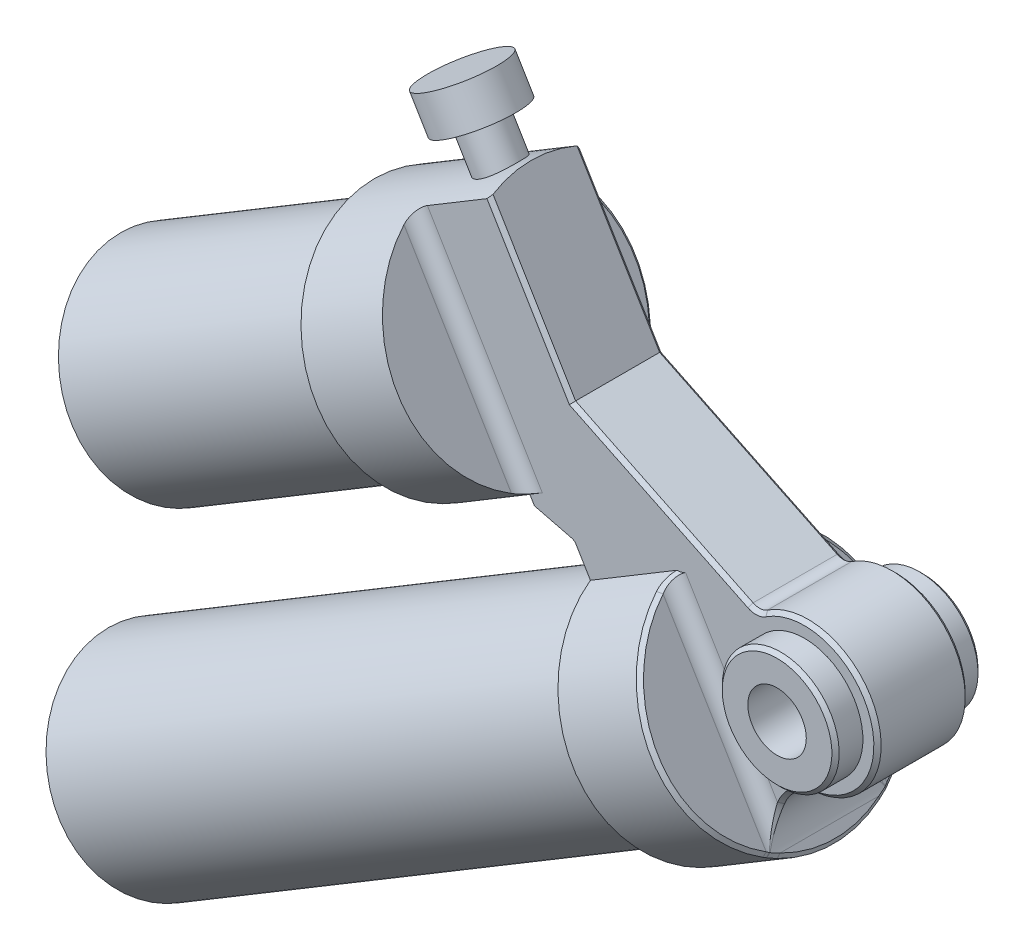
ISO-10303-21;
HEADER;
FILE_DESCRIPTION(('STEP AP214'),'2;1');
FILE_NAME('part.step','',(''),(''),'','','');
FILE_SCHEMA(('AUTOMOTIVE_DESIGN { 1 0 10303 214 1 1 1 1 }'));
ENDSEC;
DATA;
#1=APPLICATION_CONTEXT('core data for automotive mechanical design processes');
#2=APPLICATION_PROTOCOL_DEFINITION('international standard','automotive_design',2000,#1);
#3=PRODUCT_CONTEXT('',#1,'mechanical');
#4=PRODUCT('Part','Part','',(#3));
#5=PRODUCT_RELATED_PRODUCT_CATEGORY('part','',(#4));
#6=PRODUCT_DEFINITION_FORMATION('','',#4);
#7=PRODUCT_DEFINITION_CONTEXT('part definition',#1,'design');
#8=PRODUCT_DEFINITION('design','',#6,#7);
#9=PRODUCT_DEFINITION_SHAPE('','',#8);
#10=(LENGTH_UNIT() NAMED_UNIT(*) SI_UNIT(.MILLI.,.METRE.));
#11=(NAMED_UNIT(*) PLANE_ANGLE_UNIT() SI_UNIT($,.RADIAN.));
#12=(NAMED_UNIT(*) SI_UNIT($,.STERADIAN.) SOLID_ANGLE_UNIT());
#13=UNCERTAINTY_MEASURE_WITH_UNIT(LENGTH_MEASURE(1.E-05),#10,'distance_accuracy_value','');
#14=(GEOMETRIC_REPRESENTATION_CONTEXT(3) GLOBAL_UNCERTAINTY_ASSIGNED_CONTEXT((#13)) GLOBAL_UNIT_ASSIGNED_CONTEXT((#10,
#11,#12)) REPRESENTATION_CONTEXT('',''));
#15=CARTESIAN_POINT('',(0.,0.,0.));
#16=DIRECTION('',(0.,0.,1.));
#17=DIRECTION('',(1.,0.,0.));
#18=AXIS2_PLACEMENT_3D('',#15,#16,#17);
#19=CARTESIAN_POINT('',(99.,315.,-10.));
#20=DIRECTION('',(0.,0.,1.));
#21=DIRECTION('',(1.,0.,0.));
#22=AXIS2_PLACEMENT_3D('',#19,#20,#21);
#23=CYLINDRICAL_SURFACE('',#22,3.9999999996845);
#24=CARTESIAN_POINT('',(99.,315.,-10.));
#25=DIRECTION('',(0.,0.,1.));
#26=DIRECTION('',(1.,0.,0.));
#27=AXIS2_PLACEMENT_3D('',#24,#25,#26);
#28=CIRCLE('',#27,3.9999999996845);
#29=CARTESIAN_POINT('',(102.999999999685,315.,-10.));
#30=VERTEX_POINT('',#29);
#31=EDGE_CURVE('E16',#30,#30,#28,.T.);
#32=ORIENTED_EDGE('',*,*,#31,.F.);
#33=EDGE_LOOP('',(#32));
#34=FACE_BOUND('',#33,.T.);
#35=CARTESIAN_POINT('',(99.,315.,10.));
#36=DIRECTION('',(0.,0.,1.));
#37=DIRECTION('',(1.,0.,0.));
#38=AXIS2_PLACEMENT_3D('',#35,#36,#37);
#39=CIRCLE('',#38,3.9999999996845);
#40=CARTESIAN_POINT('',(102.999999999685,315.,10.));
#41=VERTEX_POINT('',#40);
#42=EDGE_CURVE('E939',#41,#41,#39,.F.);
#43=ORIENTED_EDGE('',*,*,#42,.F.);
#44=EDGE_LOOP('',(#43));
#45=FACE_BOUND('',#44,.T.);
#46=ADVANCED_FACE('F12',(#34,#45),#23,.F.);
#47=CARTESIAN_POINT('',(95.931144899,296.895727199,-7.884231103));
#48=DIRECTION('',(0.894506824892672,-0.171081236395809,-0.413023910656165));
#49=DIRECTION('',(-0.187852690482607,-0.982197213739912,0.));
#50=AXIS2_PLACEMENT_3D('',#47,#48,#49);
#51=PLANE('',#50);
#52=CARTESIAN_POINT('',(95.899339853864,296.90431931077,-7.95660752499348));
#53=CARTESIAN_POINT('',(95.8973387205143,296.898043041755,-7.9583425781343));
#54=CARTESIAN_POINT('',(95.6972254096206,296.270416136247,-8.13184785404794));
#55=CARTESIAN_POINT('',(95.6952042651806,296.264077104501,-8.13360025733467));
#56=B_SPLINE_CURVE_WITH_KNOTS('',1,(#52,#53,#54,#55),.UNSPECIFIED.,.F.,.F.,(2,1,1,2),(-0.0101,
-9.9999999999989E-05,0.9999,1.01),.UNSPECIFIED.);
#57=CARTESIAN_POINT('',(95.8973384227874,296.898087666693,-7.95836662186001));
#58=VERTEX_POINT('',#57);
#59=CARTESIAN_POINT('',(95.6971648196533,296.270477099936,-8.13199519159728));
#60=VERTEX_POINT('',#59);
#61=EDGE_CURVE('E722',#58,#60,#56,.T.);
#62=ORIENTED_EDGE('',*,*,#61,.F.);
#63=CARTESIAN_POINT('',(95.92371750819,296.860449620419,-7.88570443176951));
#64=CARTESIAN_POINT('',(95.9193249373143,296.86672284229,-7.89781611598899));
#65=CARTESIAN_POINT('',(95.9149323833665,296.872996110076,-7.90992778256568));
#66=CARTESIAN_POINT('',(95.9061473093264,296.885542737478,-7.93415108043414));
#67=CARTESIAN_POINT('',(95.9017547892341,296.891816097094,-7.94626271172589));
#68=CARTESIAN_POINT('',(95.8973622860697,296.898089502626,-7.95837432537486));
#69=B_SPLINE_CURVE_WITH_KNOTS('',3,(#63,#64,#65,#66,#67,#68),.UNSPECIFIED.,.F.,.F.,(4,2,4),(0.,
0.0429891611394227,0.0859783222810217),.UNSPECIFIED.);
#70=CARTESIAN_POINT('',(95.9237019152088,296.860390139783,-7.88572958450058));
#71=VERTEX_POINT('',#70);
#72=EDGE_CURVE('E726',#71,#58,#69,.T.);
#73=ORIENTED_EDGE('',*,*,#72,.F.);
#74=CARTESIAN_POINT('',(95.6971123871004,296.270553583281,-8.13213007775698));
#75=CARTESIAN_POINT('',(95.7071725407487,296.296743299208,-8.12119050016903));
#76=CARTESIAN_POINT('',(95.7172327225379,296.322932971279,-8.11025084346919));
#77=CARTESIAN_POINT('',(95.7373531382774,296.375312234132,-8.08837138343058));
#78=CARTESIAN_POINT('',(95.7474133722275,296.401501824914,-8.07743158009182));
#79=CARTESIAN_POINT('',(95.7675338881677,296.453880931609,-8.05555183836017));
#80=CARTESIAN_POINT('',(95.7775941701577,296.480070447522,-8.04461189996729));
#81=CARTESIAN_POINT('',(95.7977147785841,296.53244941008,-8.02273189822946));
#82=CARTESIAN_POINT('',(95.8077751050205,296.558638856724,-8.01179183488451));
#83=CARTESIAN_POINT('',(95.8278957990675,296.611017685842,-7.98991159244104));
#84=CARTESIAN_POINT('',(95.8379561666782,296.637207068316,-7.97897141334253));
#85=CARTESIAN_POINT('',(95.858076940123,296.689585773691,-7.95709094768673));
#86=CARTESIAN_POINT('',(95.8681373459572,296.715775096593,-7.94615066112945));
#87=CARTESIAN_POINT('',(95.8857802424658,296.761703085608,-7.92696466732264));
#88=CARTESIAN_POINT('',(95.8933627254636,296.781441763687,-7.91871898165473));
#89=CARTESIAN_POINT('',(95.9085277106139,296.82091908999,-7.90222755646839));
#90=CARTESIAN_POINT('',(95.9161102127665,296.840657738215,-7.89398181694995));
#91=CARTESIAN_POINT('',(95.9236927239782,296.860396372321,-7.88573605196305));
#92=B_SPLINE_CURVE_WITH_KNOTS('',3,(#74,#75,#76,#77,#78,#79,#80,#81,#82,#83,#84,#85,#86,#87,#88,
#89,#90,#91),.UNSPECIFIED.,.F.,.F.,(4,2,2,2,2,2,2,2,4),(0.,0.0903384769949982,0.180676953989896,
0.271015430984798,0.361353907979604,0.451692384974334,0.542030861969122,0.610118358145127,
0.678205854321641),.UNSPECIFIED.);
#93=EDGE_CURVE('E918',#60,#71,#92,.T.);
#94=ORIENTED_EDGE('',*,*,#93,.F.);
#95=EDGE_LOOP('',(#62,#73,#94));
#96=FACE_BOUND('',#95,.T.);
#97=ADVANCED_FACE('F920',(#96),#51,.T.);
#98=CARTESIAN_POINT('',(96.400188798,304.585722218,-10.));
#99=DIRECTION('',(0.,0.,-1.));
#100=DIRECTION('',(-0.514786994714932,0.85731811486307,0.));
#101=AXIS2_PLACEMENT_3D('',#98,#99,#100);
#102=PLANE('',#101);
#103=ORIENTED_EDGE('',*,*,#31,.T.);
#104=EDGE_LOOP('',(#103));
#105=FACE_BOUND('',#104,.T.);
#106=CARTESIAN_POINT('',(99.,315.,-9.99999999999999));
#107=DIRECTION('',(0.,0.,1.));
#108=DIRECTION('',(1.,0.,0.));
#109=AXIS2_PLACEMENT_3D('',#106,#107,#108);
#110=CIRCLE('',#109,7.49999999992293);
#111=CARTESIAN_POINT('',(106.499999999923,315.,-9.99999999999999));
#112=VERTEX_POINT('',#111);
#113=EDGE_CURVE('E731',#112,#112,#110,.F.);
#114=ORIENTED_EDGE('',*,*,#113,.T.);
#115=EDGE_LOOP('',(#114));
#116=FACE_BOUND('',#115,.T.);
#117=ADVANCED_FACE('F924',(#105,#116),#102,.T.);
#118=CARTESIAN_POINT('',(-1.838832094,308.105803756,6.));
#119=DIRECTION('',(0.857318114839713,0.514786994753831,0.));
#120=DIRECTION('',(0.514786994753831,-0.857318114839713,0.));
#121=AXIS2_PLACEMENT_3D('',#118,#119,#120);
#122=PLANE('',#121);
#123=DIRECTION('',(-0.211802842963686,0.352733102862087,0.911437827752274));
#124=VECTOR('',#123,1.);
#125=CARTESIAN_POINT('',(3.64146223,298.979008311,3.));
#126=LINE('',#125,#124);
#127=CARTESIAN_POINT('',(4.33861184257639,297.817986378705,1.82287599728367E-09));
#128=VERTEX_POINT('',#127);
#129=CARTESIAN_POINT('',(2.94431261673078,300.140030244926,6.));
#130=VERTEX_POINT('',#129);
#131=EDGE_CURVE('E524',#128,#130,#126,.T.);
#132=ORIENTED_EDGE('',*,*,#131,.T.);
#133=DIRECTION('',(-0.514786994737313,0.857318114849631,0.));
#134=VECTOR('',#133,1.);
#135=CARTESIAN_POINT('',(1.249889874,302.961895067,6.));
#136=LINE('',#135,#134);
#137=CARTESIAN_POINT('',(-0.444532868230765,305.783759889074,6.));
#138=VERTEX_POINT('',#137);
#139=EDGE_CURVE('E1049',#130,#138,#136,.T.);
#140=ORIENTED_EDGE('',*,*,#139,.T.);
#141=DIRECTION('',(-0.211802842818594,0.352733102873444,-0.911437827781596));
#142=VECTOR('',#141,1.);
#143=CARTESIAN_POINT('',(-1.1416824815,306.944781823,3.));
#144=LINE('',#143,#142);
#145=CARTESIAN_POINT('',(-1.83883209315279,308.105803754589,-3.64575194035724E-09));
#146=VERTEX_POINT('',#145);
#147=EDGE_CURVE('E1052',#138,#146,#144,.T.);
#148=ORIENTED_EDGE('',*,*,#147,.T.);
#149=DIRECTION('',(0.211802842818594,-0.352733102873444,-0.911437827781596));
#150=VECTOR('',#149,1.);
#151=CARTESIAN_POINT('',(-1.1416824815,306.944781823,-3.));
#152=LINE('',#151,#150);
#153=CARTESIAN_POINT('',(-0.444532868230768,305.783759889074,-6.));
#154=VERTEX_POINT('',#153);
#155=EDGE_CURVE('E1055',#146,#154,#152,.T.);
#156=ORIENTED_EDGE('',*,*,#155,.T.);
#157=DIRECTION('',(0.514786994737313,-0.857318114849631,0.));
#158=VECTOR('',#157,1.);
#159=CARTESIAN_POINT('',(1.249889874,302.961895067,-6.));
#160=LINE('',#159,#158);
#161=CARTESIAN_POINT('',(2.94431261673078,300.140030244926,-6.));
#162=VERTEX_POINT('',#161);
#163=EDGE_CURVE('E737',#154,#162,#160,.T.);
#164=ORIENTED_EDGE('',*,*,#163,.T.);
#165=DIRECTION('',(0.211802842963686,-0.352733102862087,0.911437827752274));
#166=VECTOR('',#165,1.);
#167=CARTESIAN_POINT('',(3.64146223,298.979008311,-3.));
#168=LINE('',#167,#166);
#169=EDGE_CURVE('E730',#162,#128,#168,.T.);
#170=ORIENTED_EDGE('',*,*,#169,.T.);
#171=EDGE_LOOP('',(#132,#140,#148,#156,#164,#170));
#172=FACE_BOUND('',#171,.T.);
#173=ADVANCED_FACE('F1077',(#172),#122,.F.);
#174=CARTESIAN_POINT('',(-2.598494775,270.519913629,14.168));
#175=DIRECTION('',(0.857318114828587,0.51478699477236,0.));
#176=DIRECTION('',(0.51478699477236,-0.857318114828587,0.));
#177=AXIS2_PLACEMENT_3D('',#174,#175,#176);
#178=PLANE('',#177);
#179=CARTESIAN_POINT('',(4.6950073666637,258.373430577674,0.));
#180=DIRECTION('',(0.857318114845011,0.514786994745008,0.));
#181=DIRECTION('',(-0.514786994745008,0.857318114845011,0.));
#182=AXIS2_PLACEMENT_3D('',#179,#180,#181);
#183=CIRCLE('',#182,13.9999999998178);
#184=CARTESIAN_POINT('',(-2.51201055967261,270.375884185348,0.));
#185=VERTEX_POINT('',#184);
#186=EDGE_CURVE('E691',#185,#185,#183,.F.);
#187=ORIENTED_EDGE('',*,*,#186,.T.);
#188=EDGE_LOOP('',(#187));
#189=FACE_BOUND('',#188,.T.);
#190=ADVANCED_FACE('F1386',(#189),#178,.F.);
#191=CARTESIAN_POINT('',(96.176594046,296.391443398,6.845041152));
#192=DIRECTION('',(0.857318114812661,0.514786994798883,0.));
#193=DIRECTION('',(0.514786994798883,-0.857318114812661,0.));
#194=AXIS2_PLACEMENT_3D('',#191,#192,#193);
#195=PLANE('',#194);
#196=DIRECTION('',(0.,0.,1.));
#197=VECTOR('',#196,1.);
#198=CARTESIAN_POINT('',(96.1765940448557,296.391443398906,-2.15970000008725E-05));
#199=LINE('',#198,#197);
#200=CARTESIAN_POINT('',(96.1765939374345,296.391443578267,6.76387453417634));
#201=VERTEX_POINT('',#200);
#202=CARTESIAN_POINT('',(96.1765940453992,296.391443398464,-6.76387690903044));
#203=VERTEX_POINT('',#202);
#204=EDGE_CURVE('E544',#201,#203,#199,.F.);
#205=ORIENTED_EDGE('',*,*,#204,.F.);
#206=CARTESIAN_POINT('',(88.7121826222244,308.822556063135,0.));
#207=DIRECTION('',(-0.857318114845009,-0.514786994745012,0.));
#208=DIRECTION('',(0.514786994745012,-0.857318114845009,0.));
#209=AXIS2_PLACEMENT_3D('',#206,#207,#208);
#210=CIRCLE('',#209,16.0000000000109);
#211=EDGE_CURVE('E696',#201,#203,#210,.F.);
#212=ORIENTED_EDGE('',*,*,#211,.T.);
#213=EDGE_LOOP('',(#205,#212));
#214=FACE_BOUND('',#213,.T.);
#215=ADVANCED_FACE('F1381',(#214),#195,.T.);
#216=CARTESIAN_POINT('',(95.819884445,296.916930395,8.133616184));
#217=DIRECTION('',(0.894347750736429,-0.170822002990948,0.413475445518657));
#218=DIRECTION('',(-0.187610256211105,-0.98224355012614,0.));
#219=AXIS2_PLACEMENT_3D('',#216,#217,#218);
#220=PLANE('',#219);
#221=DIRECTION('',(0.293761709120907,0.921297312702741,-0.254784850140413));
#222=VECTOR('',#221,1.);
#223=CARTESIAN_POINT('',(95.7971669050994,296.584349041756,8.04535256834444));
#224=LINE('',#223,#222);
#225=CARTESIAN_POINT('',(95.6971051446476,296.270534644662,8.13213790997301));
#226=VERTEX_POINT('',#225);
#227=CARTESIAN_POINT('',(95.8972284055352,296.898162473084,7.9585674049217));
#228=VERTEX_POINT('',#227);
#229=EDGE_CURVE('E1184',#226,#228,#224,.T.);
#230=ORIENTED_EDGE('',*,*,#229,.F.);
#231=DIRECTION('',(-0.334101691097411,-0.869678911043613,0.363365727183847));
#232=VECTOR('',#231,1.);
#233=CARTESIAN_POINT('',(95.8103965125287,296.565436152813,8.00892327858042));
#234=LINE('',#233,#232);
#235=CARTESIAN_POINT('',(95.9236875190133,296.860336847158,7.88570913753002));
#236=VERTEX_POINT('',#235);
#237=EDGE_CURVE('E693',#236,#226,#234,.T.);
#238=ORIENTED_EDGE('',*,*,#237,.F.);
#239=DIRECTION('',(0.306769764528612,-0.438554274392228,-0.844726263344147));
#240=VECTOR('',#239,1.);
#241=CARTESIAN_POINT('',(95.9104579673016,296.879249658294,7.92213828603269));
#242=LINE('',#241,#240);
#243=EDGE_CURVE('E1180',#228,#236,#242,.T.);
#244=ORIENTED_EDGE('',*,*,#243,.F.);
#245=EDGE_LOOP('',(#230,#238,#244));
#246=FACE_BOUND('',#245,.T.);
#247=ADVANCED_FACE('F1376',(#246),#220,.T.);
#248=CARTESIAN_POINT('',(109.414277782,312.400188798,10.));
#249=DIRECTION('',(0.,0.,1.));
#250=DIRECTION('',(-0.514786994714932,0.85731811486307,0.));
#251=AXIS2_PLACEMENT_3D('',#248,#249,#250);
#252=PLANE('',#251);
#253=ORIENTED_EDGE('',*,*,#42,.T.);
#254=EDGE_LOOP('',(#253));
#255=FACE_BOUND('',#254,.T.);
#256=CARTESIAN_POINT('',(99.,315.,10.));
#257=DIRECTION('',(0.,0.,-1.));
#258=DIRECTION('',(-1.,0.,0.));
#259=AXIS2_PLACEMENT_3D('',#256,#257,#258);
#260=CIRCLE('',#259,7.4999999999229);
#261=CARTESIAN_POINT('',(91.5000000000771,315.,10.));
#262=VERTEX_POINT('',#261);
#263=EDGE_CURVE('E969',#262,#262,#260,.F.);
#264=ORIENTED_EDGE('',*,*,#263,.T.);
#265=EDGE_LOOP('',(#264));
#266=FACE_BOUND('',#265,.T.);
#267=ADVANCED_FACE('F946',(#255,#266),#252,.T.);
#268=CARTESIAN_POINT('',(95.69189229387,296.27071712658,-8.14647332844));
#269=CARTESIAN_POINT('',(95.6928747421,296.26869059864,-8.14251618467));
#270=CARTESIAN_POINT('',(95.69385719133,296.2666640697,-8.13855904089));
#271=CARTESIAN_POINT('',(95.69483963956,296.26463754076,-8.13460189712));
#272=CARTESIAN_POINT('',(95.79308450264,296.06198467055,-7.73888752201));
#273=CARTESIAN_POINT('',(95.89403950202,295.87962535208,-7.33331131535));
#274=CARTESIAN_POINT('',(95.99345132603,295.71556801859,-6.91813697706));
#275=CARTESIAN_POINT('',(95.694161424,296.276608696,-8.144005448));
#276=CARTESIAN_POINT('',(95.695142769,296.274584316,-8.140049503));
#277=CARTESIAN_POINT('',(95.696124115,296.272559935,-8.136093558));
#278=CARTESIAN_POINT('',(95.69710546,296.270535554,-8.132137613));
#279=CARTESIAN_POINT('',(95.79524,296.068097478,-7.736543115));
#280=CARTESIAN_POINT('',(95.896084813,295.885932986,-7.331089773));
#281=CARTESIAN_POINT('',(95.995390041,295.722051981,-6.916041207));
#282=CARTESIAN_POINT('',(95.921074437,296.865765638,-7.897217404));
#283=CARTESIAN_POINT('',(95.921945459,296.863956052,-7.893381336));
#284=CARTESIAN_POINT('',(95.922816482,296.862146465,-7.889545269));
#285=CARTESIAN_POINT('',(95.923687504,296.860336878,-7.885709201));
#286=CARTESIAN_POINT('',(96.010789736,296.679378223,-7.502102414));
#287=CARTESIAN_POINT('',(96.100615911,296.516696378,-7.108935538));
#288=CARTESIAN_POINT('',(96.189261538,296.370448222,-6.706464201));
#289=CARTESIAN_POINT('',(95.9233662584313,296.871716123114,-7.8947248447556));
#290=CARTESIAN_POINT('',(95.924236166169,296.869908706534,-7.8908899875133));
#291=CARTESIAN_POINT('',(95.9251060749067,296.868101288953,-7.8870551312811));
#292=CARTESIAN_POINT('',(95.9259759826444,296.866293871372,-7.8832202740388));
#293=CARTESIAN_POINT('',(96.0129667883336,296.685552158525,-7.4997345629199));
#294=CARTESIAN_POINT('',(96.1026816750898,296.523067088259,-7.1066917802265));
#295=CARTESIAN_POINT('',(96.1912196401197,296.376997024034,-6.7043474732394));
#296=B_SPLINE_SURFACE_WITH_KNOTS('',1,3,((#268,#269,#270,#271,#272,#273,#274),(#275,#276,#277,
#278,#279,#280,#281),(#282,#283,#284,#285,#286,#287,#288),(#289,#290,#291,#292,#293,#294,#295)),
.UNSPECIFIED.,.F.,.F.,.F.,(2,1,1,2),(4,3,4),(-0.01,0.,1.,1.0101),(0.0154715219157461,
0.0154847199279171,0.0168045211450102),.UNSPECIFIED.);
#297=CARTESIAN_POINT('',(96.1765941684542,296.391443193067,-6.76387697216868));
#298=CARTESIAN_POINT('',(96.1523749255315,296.431782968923,-6.87347240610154));
#299=CARTESIAN_POINT('',(96.1280378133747,296.473425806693,-6.98256473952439));
#300=CARTESIAN_POINT('',(96.0793004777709,296.559394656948,-7.19967292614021));
#301=CARTESIAN_POINT('',(96.0549002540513,296.603720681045,-7.30768877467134));
#302=CARTESIAN_POINT('',(95.9947192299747,296.716704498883,-7.57328227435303));
#303=CARTESIAN_POINT('',(95.9590024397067,296.786972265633,-7.73019040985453));
#304=CARTESIAN_POINT('',(95.923679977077,296.860352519,-7.88574235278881));
#305=B_SPLINE_CURVE_WITH_KNOTS('',3,(#297,#298,#299,#300,#301,#302,#303,#304),.UNSPECIFIED.,.F.,
.F.,(4,2,2,4),(0.,0.357801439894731,0.715604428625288,1.24228007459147),.UNSPECIFIED.);
#306=EDGE_CURVE('E1434',#203,#71,#305,.T.);
#307=DIRECTION('',(0.27633195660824,0.913392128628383,0.298923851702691));
#308=VECTOR('',#307,1.);
#309=CARTESIAN_POINT('',(96.0788961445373,296.068511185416,-6.86955996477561));
#310=LINE('',#309,#308);
#311=CARTESIAN_POINT('',(95.9811978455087,295.745577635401,-6.9752457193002));
#312=VERTEX_POINT('',#311);
#313=EDGE_CURVE('E692',#203,#312,#310,.F.);
#314=CARTESIAN_POINT('',(95.9811989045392,295.745578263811,-6.97524570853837));
#315=CARTESIAN_POINT('',(95.955502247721,295.788376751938,-7.0822636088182));
#316=CARTESIAN_POINT('',(95.9296898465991,295.832447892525,-7.18874616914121));
#317=CARTESIAN_POINT('',(95.8779931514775,295.923192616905,-7.40057907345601));
#318=CARTESIAN_POINT('',(95.8521088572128,295.969866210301,-7.50592941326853));
#319=CARTESIAN_POINT('',(95.7829773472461,296.098290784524,-7.78617866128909));
#320=CARTESIAN_POINT('',(95.7398095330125,296.182444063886,-7.95999845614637));
#321=CARTESIAN_POINT('',(95.6971405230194,296.270463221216,-8.13199626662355));
#322=B_SPLINE_CURVE_WITH_KNOTS('',3,(#314,#315,#316,#317,#318,#319,#320,#321),.UNSPECIFIED.,.F.,
.F.,(4,2,2,4),(0.,0.354258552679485,0.708518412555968,1.30202133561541),.UNSPECIFIED.);
#323=EDGE_CURVE('E967',#312,#60,#322,.T.);
#324=ORIENTED_EDGE('',*,*,#93,.T.);
#325=ORIENTED_EDGE('',*,*,#306,.F.);
#326=ORIENTED_EDGE('',*,*,#313,.T.);
#327=ORIENTED_EDGE('',*,*,#323,.T.);
#328=EDGE_LOOP('',(#324,#325,#326,#327));
#329=FACE_BOUND('',#328,.T.);
#330=ADVANCED_FACE('F940',(#329),#296,.T.);
#331=CARTESIAN_POINT('',(88.7121830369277,308.822556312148,0.));
#332=DIRECTION('',(-0.857318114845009,-0.514786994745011,0.));
#333=DIRECTION('',(0.514786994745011,-0.857318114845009,0.));
#334=AXIS2_PLACEMENT_3D('',#331,#332,#333);
#335=CONICAL_SURFACE('',#334,15.9999995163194,0.785398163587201);
#336=CARTESIAN_POINT('',(88.7121826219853,308.822556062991,0.));
#337=DIRECTION('',(-0.857318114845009,-0.514786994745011,0.));
#338=DIRECTION('',(0.514786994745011,-0.857318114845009,0.));
#339=AXIS2_PLACEMENT_3D('',#336,#337,#338);
#340=CIRCLE('',#339,16.0000000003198);
#341=CARTESIAN_POINT('',(95.7694130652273,297.069556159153,-8.25000042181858));
#342=VERTEX_POINT('',#341);
#343=CARTESIAN_POINT('',(81.6547849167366,320.575649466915,-8.2500593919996));
#344=VERTEX_POINT('',#343);
#345=EDGE_CURVE('E749',#342,#344,#340,.F.);
#346=ORIENTED_EDGE('',*,*,#345,.F.);
#347=DIRECTION('',(0.294326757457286,0.883423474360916,0.364602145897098));
#348=VECTOR('',#347,1.);
#349=CARTESIAN_POINT('',(95.666394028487,296.760343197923,-8.37761757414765));
#350=LINE('',#349,#348);
#351=CARTESIAN_POINT('',(95.5612930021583,296.444881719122,-8.50781315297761));
#352=VERTEX_POINT('',#351);
#353=EDGE_CURVE('E719',#352,#342,#350,.T.);
#354=ORIENTED_EDGE('',*,*,#353,.F.);
#355=CARTESIAN_POINT('',(88.2835235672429,308.565162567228,0.));
#356=DIRECTION('',(0.857318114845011,0.514786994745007,0.));
#357=DIRECTION('',(0.514786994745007,-0.857318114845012,0.));
#358=AXIS2_PLACEMENT_3D('',#355,#356,#357);
#359=CIRCLE('',#358,16.5000000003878);
#360=CARTESIAN_POINT('',(81.0055502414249,320.685393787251,-8.50788878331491));
#361=VERTEX_POINT('',#360);
#362=EDGE_CURVE('E515',#352,#361,#359,.T.);
#363=ORIENTED_EDGE('',*,*,#362,.T.);
#364=CARTESIAN_POINT('',(81.6610761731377,320.574502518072,-8.24757469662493));
#365=CARTESIAN_POINT('',(81.654583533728,320.57560107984,-8.25015326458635));
#366=CARTESIAN_POINT('',(81.0053195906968,320.685457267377,-8.50801006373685));
#367=CARTESIAN_POINT('',(80.9987620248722,320.686566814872,-8.51061441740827));
#368=B_SPLINE_CURVE_WITH_KNOTS('',1,(#364,#365,#366,#367),.UNSPECIFIED.,.F.,.F.,(2,1,1,2),
(-0.0101,-9.9999999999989E-05,0.9999,1.01),.UNSPECIFIED.);
#369=EDGE_CURVE('E740',#344,#361,#368,.T.);
#370=ORIENTED_EDGE('',*,*,#369,.F.);
#371=EDGE_LOOP('',(#346,#354,#363,#370));
#372=FACE_BOUND('',#371,.T.);
#373=ADVANCED_FACE('F889',(#372),#335,.T.);
#374=CARTESIAN_POINT('',(95.3194696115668,301.773386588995,-6.25513549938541));
#375=CARTESIAN_POINT('',(95.314630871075,301.756193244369,-6.25523580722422));
#376=CARTESIAN_POINT('',(95.3097921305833,301.738999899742,-6.25533611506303));
#377=CARTESIAN_POINT('',(95.3049533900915,301.721806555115,-6.25543642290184));
#378=CARTESIAN_POINT('',(95.0630163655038,300.862139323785,-6.26045181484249));
#379=CARTESIAN_POINT('',(95.0431793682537,299.948112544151,-6.54433885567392));
#380=CARTESIAN_POINT('',(95.3179422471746,298.23843161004,-7.23393667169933));
#381=CARTESIAN_POINT('',(95.6072685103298,297.424398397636,-7.65849375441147));
#382=CARTESIAN_POINT('',(96.0090395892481,296.684549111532,-8.08030664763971));
#383=CARTESIAN_POINT('',(95.32458071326,301.7713541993,-6.24969825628));
#384=CARTESIAN_POINT('',(95.31971825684,301.7541589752,-6.24979883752));
#385=CARTESIAN_POINT('',(95.31485580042,301.7369637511,-6.24989941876));
#386=CARTESIAN_POINT('',(95.309993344,301.719768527,-6.25));
#387=CARTESIAN_POINT('',(95.066870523,300.860007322,-6.255029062));
#388=CARTESIAN_POINT('',(95.04600422,299.946142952,-6.539689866));
#389=CARTESIAN_POINT('',(95.319145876,298.237110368,-7.231167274));
#390=CARTESIAN_POINT('',(95.607854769,297.423561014,-7.656881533));
#391=CARTESIAN_POINT('',(96.009200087,296.684304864,-8.079844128));
#392=CARTESIAN_POINT('',(95.7946601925,301.58443076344,-5.74962282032));
#393=CARTESIAN_POINT('',(95.787616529,301.56706267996,-5.74974854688));
#394=CARTESIAN_POINT('',(95.7805728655,301.54969459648,-5.74987427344));
#395=CARTESIAN_POINT('',(95.773529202,301.532326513,-5.75));
#396=CARTESIAN_POINT('',(95.421346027,300.663922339,-5.756286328));
#397=CARTESIAN_POINT('',(95.305812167,299.764995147,-6.112111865));
#398=CARTESIAN_POINT('',(95.429846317,298.115592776,-6.97645956));
#399=CARTESIAN_POINT('',(95.661774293,297.346544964,-7.508601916));
#400=CARTESIAN_POINT('',(96.023961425,296.661840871,-8.03730516));
#401=CARTESIAN_POINT('',(95.7994120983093,301.582541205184,-5.74456769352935));
#402=CARTESIAN_POINT('',(95.7923463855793,301.565171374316,-5.74469367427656));
#403=CARTESIAN_POINT('',(95.7852806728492,301.547801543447,-5.74481965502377));
#404=CARTESIAN_POINT('',(95.7782149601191,301.530431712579,-5.74494563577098));
#405=CARTESIAN_POINT('',(95.424929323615,300.661940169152,-5.75124467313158));
#406=CARTESIAN_POINT('',(95.3084384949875,299.763163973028,-6.10778959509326));
#407=CARTESIAN_POINT('',(95.4309653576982,298.11436438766,-6.97388478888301));
#408=CARTESIAN_POINT('',(95.6623193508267,297.345766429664,-7.50710299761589));
#409=CARTESIAN_POINT('',(96.0241106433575,296.661613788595,-8.0368751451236));
#410=B_SPLINE_SURFACE_WITH_KNOTS('',1,3,((#374,#375,#376,#377,#378,#379,#380,#381,#382),(#383,
#384,#385,#386,#387,#388,#389,#390,#391),(#392,#393,#394,#395,#396,#397,#398,#399,#400),(#401,
#402,#403,#404,#405,#406,#407,#408,#409)),.UNSPECIFIED.,.F.,.F.,.F.,(2,1,1,2),(4,3,2,4),
(-0.0108728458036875,0.,1.,1.01010872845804),(0.000320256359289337,0.000379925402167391,
0.00336337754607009,0.00634682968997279),.UNSPECIFIED.);
#411=DIRECTION('',(0.655538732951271,-0.265083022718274,0.707106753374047));
#412=VECTOR('',#411,1.);
#413=CARTESIAN_POINT('',(95.5417613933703,301.626047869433,-5.99999999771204));
#414=LINE('',#413,#412);
#415=CARTESIAN_POINT('',(95.3099933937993,301.719768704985,-6.24999999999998));
#416=VERTEX_POINT('',#415);
#417=CARTESIAN_POINT('',(95.7735293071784,301.532326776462,-5.74999999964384));
#418=VERTEX_POINT('',#417);
#419=EDGE_CURVE('E723',#416,#418,#414,.T.);
#420=CARTESIAN_POINT('',(95.9234551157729,296.860819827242,-7.88645801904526));
#421=CARTESIAN_POINT('',(95.880735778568,296.949627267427,-7.81953812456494));
#422=CARTESIAN_POINT('',(95.8402340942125,297.039605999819,-7.75274881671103));
#423=CARTESIAN_POINT('',(95.7637387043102,297.2219442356,-7.6198351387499));
#424=CARTESIAN_POINT('',(95.7277451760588,297.31430383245,-7.55371079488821));
#425=CARTESIAN_POINT('',(95.6599909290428,297.502410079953,-7.42185263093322));
#426=CARTESIAN_POINT('',(95.6282782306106,297.598181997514,-7.35613006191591));
#427=CARTESIAN_POINT('',(95.5696827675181,297.792157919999,-7.22612775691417));
#428=CARTESIAN_POINT('',(95.5428005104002,297.890362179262,-7.16184817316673));
#429=CARTESIAN_POINT('',(95.4801261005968,298.145925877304,-6.99889391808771));
#430=CARTESIAN_POINT('',(95.448005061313,298.305059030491,-6.90152659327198));
#431=CARTESIAN_POINT('',(95.409747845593,298.547926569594,-6.7599170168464));
#432=CARTESIAN_POINT('',(95.3986471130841,298.629609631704,-6.71343684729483));
#433=CARTESIAN_POINT('',(95.3798841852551,298.794282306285,-6.62212873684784));
#434=CARTESIAN_POINT('',(95.3722219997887,298.877271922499,-6.5773008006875));
#435=CARTESIAN_POINT('',(95.3546269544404,299.127589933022,-6.44604295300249));
#436=CARTESIAN_POINT('',(95.3499893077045,299.296867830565,-6.36248541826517));
#437=CARTESIAN_POINT('',(95.3560607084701,299.639878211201,-6.20618328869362));
#438=CARTESIAN_POINT('',(95.3667528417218,299.813605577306,-6.13342687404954));
#439=CARTESIAN_POINT('',(95.4069779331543,300.184167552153,-5.99562762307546));
#440=CARTESIAN_POINT('',(95.4384281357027,300.381465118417,-5.93227663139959));
#441=CARTESIAN_POINT('',(95.5021694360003,300.678271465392,-5.85638446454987));
#442=CARTESIAN_POINT('',(95.5261286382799,300.777199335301,-5.83429523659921));
#443=CARTESIAN_POINT('',(95.5796447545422,300.974867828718,-5.7973143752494));
#444=CARTESIAN_POINT('',(95.6091979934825,301.073608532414,-5.78241803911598));
#445=CARTESIAN_POINT('',(95.6614377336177,301.232405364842,-5.76480361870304));
#446=CARTESIAN_POINT('',(95.6824063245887,301.292763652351,-5.75960578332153));
#447=CARTESIAN_POINT('',(95.7264229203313,301.412983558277,-5.75238229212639));
#448=CARTESIAN_POINT('',(95.7494731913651,301.472844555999,-5.75036013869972));
#449=CARTESIAN_POINT('',(95.7735292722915,301.53232668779,-5.74999999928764));
#450=B_SPLINE_CURVE_WITH_KNOTS('',3,(#420,#421,#422,#423,#424,#425,#426,#427,#428,#429,#430,
#431,#432,#433,#434,#435,#436,#437,#438,#439,#440,#441,#442,#443,#444,#445,#446,#447,#448,#449),
.UNSPECIFIED.,.F.,.F.,(4,2,2,2,2,2,2,2,2,2,2,2,2,2,4),(0.,0.357344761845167,0.714703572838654,
1.0757865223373,1.43690738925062,2.00412789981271,2.28795902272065,2.57179095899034,
3.13735184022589,3.70228918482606,4.32848411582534,4.64063475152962,4.95258102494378,
5.1448003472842,5.33723151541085),.UNSPECIFIED.);
#451=EDGE_CURVE('E1156',#71,#418,#450,.T.);
#452=CARTESIAN_POINT('',(95.3099933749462,301.719768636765,-6.24999999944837));
#453=CARTESIAN_POINT('',(95.2919007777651,301.654443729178,-6.2500001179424));
#454=CARTESIAN_POINT('',(95.2748933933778,301.588834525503,-6.25181050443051));
#455=CARTESIAN_POINT('',(95.2431853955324,301.457366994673,-6.25870505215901));
#456=CARTESIAN_POINT('',(95.2284802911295,301.391509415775,-6.2637827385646));
#457=CARTESIAN_POINT('',(95.2014487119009,301.259643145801,-6.27686403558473));
#458=CARTESIAN_POINT('',(95.1891208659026,301.193634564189,-6.2848659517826));
#459=CARTESIAN_POINT('',(95.1669749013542,301.062332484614,-6.30336994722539));
#460=CARTESIAN_POINT('',(95.1571300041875,300.997039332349,-6.313842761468));
#461=CARTESIAN_POINT('',(95.1397398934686,300.86651980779,-6.33705496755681));
#462=CARTESIAN_POINT('',(95.1321957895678,300.801293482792,-6.34979544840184));
#463=CARTESIAN_POINT('',(95.1193511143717,300.671030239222,-6.37728624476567));
#464=CARTESIAN_POINT('',(95.1140511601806,300.605993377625,-6.39203711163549));
#465=CARTESIAN_POINT('',(95.1031235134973,300.437828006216,-6.43256882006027));
#466=CARTESIAN_POINT('',(95.0991553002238,300.334916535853,-6.45971402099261));
#467=CARTESIAN_POINT('',(95.0963292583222,300.130069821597,-6.51775250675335));
#468=CARTESIAN_POINT('',(95.0974731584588,300.028134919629,-6.5486470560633));
#469=CARTESIAN_POINT('',(95.1044984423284,299.825427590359,-6.61358618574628));
#470=CARTESIAN_POINT('',(95.1103806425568,299.724655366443,-6.64763130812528));
#471=CARTESIAN_POINT('',(95.1266234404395,299.523392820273,-6.71876108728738));
#472=CARTESIAN_POINT('',(95.1370293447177,299.422915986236,-6.75587333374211));
#473=CARTESIAN_POINT('',(95.1620862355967,299.223403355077,-6.83237741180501));
#474=CARTESIAN_POINT('',(95.1767362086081,299.124367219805,-6.87176869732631));
#475=CARTESIAN_POINT('',(95.2099639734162,298.927797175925,-6.95256521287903));
#476=CARTESIAN_POINT('',(95.2285416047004,298.830263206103,-6.99397036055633));
#477=CARTESIAN_POINT('',(95.2720860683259,298.624502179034,-7.08379691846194));
#478=CARTESIAN_POINT('',(95.297563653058,298.516481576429,-7.13244371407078));
#479=CARTESIAN_POINT('',(95.353178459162,298.30241856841,-7.2314180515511));
#480=CARTESIAN_POINT('',(95.3833162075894,298.196376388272,-7.28174578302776));
#481=CARTESIAN_POINT('',(95.4480744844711,297.986289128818,-7.38372124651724));
#482=CARTESIAN_POINT('',(95.4826959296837,297.882244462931,-7.43536924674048));
#483=CARTESIAN_POINT('',(95.5555167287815,297.678237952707,-7.53864681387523));
#484=CARTESIAN_POINT('',(95.5936320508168,297.578236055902,-7.59025665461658));
#485=CARTESIAN_POINT('',(95.673835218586,297.380258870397,-7.69419856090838));
#486=CARTESIAN_POINT('',(95.7159220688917,297.282283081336,-7.74653044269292));
#487=CARTESIAN_POINT('',(95.8038970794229,297.088479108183,-7.85178074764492));
#488=CARTESIAN_POINT('',(95.8497824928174,296.992649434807,-7.904698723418));
#489=CARTESIAN_POINT('',(95.8975078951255,296.89789586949,-7.95787322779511));
#490=B_SPLINE_CURVE_WITH_KNOTS('',3,(#452,#453,#454,#455,#456,#457,#458,#459,#460,#461,#462,
#463,#464,#465,#466,#467,#468,#469,#470,#471,#472,#473,#474,#475,#476,#477,#478,#479,#480,#481,
#482,#483,#484,#485,#486,#487,#488,#489),.UNSPECIFIED.,.F.,.F.,(4,2,2,2,2,2,2,2,2,2,2,2,2,2,2,2,
2,2,4),(0.,0.203296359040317,0.406191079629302,0.608968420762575,0.809455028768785,
1.01003817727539,1.21067644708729,1.52995948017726,1.84935049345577,2.16879655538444,
2.4915184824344,2.81416339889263,3.13679513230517,3.50020207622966,3.86365015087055,
4.22717265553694,4.58352561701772,4.93978949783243,5.29579796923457),.UNSPECIFIED.);
#491=EDGE_CURVE('E880',#416,#58,#490,.T.);
#492=ORIENTED_EDGE('',*,*,#419,.T.);
#493=ORIENTED_EDGE('',*,*,#451,.F.);
#494=ORIENTED_EDGE('',*,*,#72,.T.);
#495=ORIENTED_EDGE('',*,*,#491,.F.);
#496=EDGE_LOOP('',(#492,#493,#494,#495));
#497=FACE_BOUND('',#496,.T.);
#498=ADVANCED_FACE('F882',(#497),#410,.T.);
#499=CARTESIAN_POINT('',(95.5534421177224,296.448273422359,-8.5291621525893));
#500=CARTESIAN_POINT('',(95.5933696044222,296.380007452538,-8.3978917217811));
#501=CARTESIAN_POINT('',(95.640441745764,296.318552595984,-8.2660805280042));
#502=CARTESIAN_POINT('',(95.6950842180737,296.26419652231,-8.1338906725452));
#503=CARTESIAN_POINT('',(95.6956306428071,296.263652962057,-8.1325687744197));
#504=CARTESIAN_POINT('',(95.6961770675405,296.263109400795,-8.1312468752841));
#505=CARTESIAN_POINT('',(95.6967234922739,296.262565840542,-8.1299249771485));
#506=CARTESIAN_POINT('',(95.555545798,296.454579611,-8.526515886));
#507=CARTESIAN_POINT('',(95.595462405,296.386335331,-8.395542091));
#508=CARTESIAN_POINT('',(95.642507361,296.324891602,-8.264028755));
#509=CARTESIAN_POINT('',(95.69710546,296.270535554,-8.132137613));
#510=CARTESIAN_POINT('',(95.697651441,296.269991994,-8.130818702));
#511=CARTESIAN_POINT('',(95.698197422,296.269448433,-8.12949979));
#512=CARTESIAN_POINT('',(95.698743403,296.268904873,-8.128180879));
#513=CARTESIAN_POINT('',(95.763830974,297.078954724,-8.264509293));
#514=CARTESIAN_POINT('',(95.802670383,297.012857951,-8.16290538));
#515=CARTESIAN_POINT('',(95.847023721,296.95251596,-8.060882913));
#516=CARTESIAN_POINT('',(95.897228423,296.898162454,-7.958567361));
#517=CARTESIAN_POINT('',(95.89773047,296.897618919,-7.957544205));
#518=CARTESIAN_POINT('',(95.898232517,296.897075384,-7.956521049));
#519=CARTESIAN_POINT('',(95.898734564,296.896531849,-7.955497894));
#520=CARTESIAN_POINT('',(95.765913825,297.085198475,-8.261889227));
#521=CARTESIAN_POINT('',(95.804742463,297.019123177,-8.160579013));
#522=CARTESIAN_POINT('',(95.849068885,296.958792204,-8.058851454));
#523=CARTESIAN_POINT('',(95.899229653,296.904438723,-7.956831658));
#524=CARTESIAN_POINT('',(95.89973126,296.903895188,-7.95581146));
#525=CARTESIAN_POINT('',(95.900232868,296.903351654,-7.954791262));
#526=CARTESIAN_POINT('',(95.900734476,296.902808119,-7.953771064));
#527=B_SPLINE_SURFACE_WITH_KNOTS('',1,3,((#499,#500,#501,#502,#503,#504,#505),(#506,#507,#508,
#509,#510,#511,#512),(#513,#514,#515,#516,#517,#518,#519),(#520,#521,#522,#523,#524,#525,#526)),
.UNSPECIFIED.,.F.,.F.,.F.,(2,1,1,2),(4,3,4),(-0.0101,0.,1.,1.01),(0.00577654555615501,
0.006216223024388,0.00622061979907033),.UNSPECIFIED.);
#528=CARTESIAN_POINT('',(95.6971644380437,296.270476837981,-8.13199514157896));
#529=CARTESIAN_POINT('',(95.6833509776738,296.284224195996,-8.16535794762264));
#530=CARTESIAN_POINT('',(95.6700120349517,296.298437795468,-8.19872270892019));
#531=CARTESIAN_POINT('',(95.6442811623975,296.327772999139,-8.26541822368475));
#532=CARTESIAN_POINT('',(95.6318892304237,296.342894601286,-8.29874897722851));
#533=CARTESIAN_POINT('',(95.5989424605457,296.385913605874,-8.39077978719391));
#534=CARTESIAN_POINT('',(95.5793855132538,296.414744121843,-8.44940404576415));
#535=CARTESIAN_POINT('',(95.5612932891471,296.44488244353,-8.50781273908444));
#536=B_SPLINE_CURVE_WITH_KNOTS('',3,(#528,#529,#530,#531,#532,#533,#534,#535),.UNSPECIFIED.,.F.,
.F.,(4,2,2,4),(0.,0.115903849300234,0.231807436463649,0.43627459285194),.UNSPECIFIED.);
#537=EDGE_CURVE('E519',#60,#352,#536,.T.);
#538=CARTESIAN_POINT('',(95.8973233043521,296.898059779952,-7.95837400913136));
#539=CARTESIAN_POINT('',(95.8819555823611,296.914688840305,-7.98968528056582));
#540=CARTESIAN_POINT('',(95.8671400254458,296.931880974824,-8.02096632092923));
#541=CARTESIAN_POINT('',(95.8377473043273,296.968410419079,-8.085296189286));
#542=CARTESIAN_POINT('',(95.8232380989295,296.987814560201,-8.11833815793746));
#543=CARTESIAN_POINT('',(95.7954191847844,297.027812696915,-8.18429471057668));
#544=CARTESIAN_POINT('',(95.7821115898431,297.048408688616,-8.21720897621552));
#545=CARTESIAN_POINT('',(95.7694132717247,297.069555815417,-8.25000071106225));
#546=B_SPLINE_CURVE_WITH_KNOTS('',3,(#538,#539,#540,#541,#542,#543,#544,#545),.UNSPECIFIED.,.F.,
.F.,(4,2,2,4),(0.,0.115910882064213,0.23879474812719,0.361890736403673),.UNSPECIFIED.);
#547=EDGE_CURVE('E716',#58,#342,#546,.T.);
#548=ORIENTED_EDGE('',*,*,#61,.T.);
#549=ORIENTED_EDGE('',*,*,#537,.T.);
#550=ORIENTED_EDGE('',*,*,#353,.T.);
#551=ORIENTED_EDGE('',*,*,#547,.F.);
#552=EDGE_LOOP('',(#548,#549,#550,#551));
#553=FACE_BOUND('',#552,.T.);
#554=ADVANCED_FACE('F888',(#553),#527,.T.);
#555=CARTESIAN_POINT('',(81.570087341,320.716888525,-8.25));
#556=DIRECTION('',(0.857318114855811,0.514786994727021,0.));
#557=DIRECTION('',(0.514786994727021,-0.857318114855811,0.));
#558=AXIS2_PLACEMENT_3D('',#555,#556,#557);
#559=PLANE('',#558);
#560=DIRECTION('',(0.51478699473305,-0.857318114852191,0.));
#561=VECTOR('',#560,1.);
#562=CARTESIAN_POINT('',(88.4523238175,309.2553208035,-8.24999999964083));
#563=LINE('',#562,#561);
#564=EDGE_CURVE('E713',#342,#344,#563,.F.);
#565=ORIENTED_EDGE('',*,*,#564,.F.);
#566=ORIENTED_EDGE('',*,*,#345,.T.);
#567=EDGE_LOOP('',(#565,#566));
#568=FACE_BOUND('',#567,.T.);
#569=ADVANCED_FACE('F1363',(#568),#559,.T.);
#570=CARTESIAN_POINT('',(82.5358390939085,323.079661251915,-5.92673742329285));
#571=CARTESIAN_POINT('',(82.52318044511,323.072069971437,-5.92664239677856));
#572=CARTESIAN_POINT('',(82.5105217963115,323.06447869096,-5.92654737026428));
#573=CARTESIAN_POINT('',(82.497863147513,323.056887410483,-5.92645234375));
#574=CARTESIAN_POINT('',(81.8649307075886,322.677323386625,-5.9217010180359));
#575=CARTESIAN_POINT('',(81.3230855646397,322.198592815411,-6.2817856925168));
#576=CARTESIAN_POINT('',(80.8042941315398,321.315847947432,-7.3676828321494));
#577=CARTESIAN_POINT('',(80.8179518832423,320.909679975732,-8.0567007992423));
#578=CARTESIAN_POINT('',(81.062498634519,320.593527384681,-8.6947213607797));
#579=CARTESIAN_POINT('',(82.53818855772,323.07557508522,-5.92997193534));
#580=CARTESIAN_POINT('',(82.52555542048,323.06799912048,-5.92987712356));
#581=CARTESIAN_POINT('',(82.51292228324,323.06042315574,-5.92978231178));
#582=CARTESIAN_POINT('',(82.500289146,323.052847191,-5.9296875));
#583=CARTESIAN_POINT('',(81.868632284,322.674048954,-5.924946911));
#584=CARTESIAN_POINT('',(81.327995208,322.196090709,-6.28421789));
#585=CARTESIAN_POINT('',(80.810680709,321.31440746,-7.367661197));
#586=CARTESIAN_POINT('',(80.824623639,320.908537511,-8.055122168));
#587=CARTESIAN_POINT('',(81.069026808,320.592440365,-8.691700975));
#588=CARTESIAN_POINT('',(82.77080873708,322.67100412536,-6.25022065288));
#589=CARTESIAN_POINT('',(82.76070149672,322.66494457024,-6.25014710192));
#590=CARTESIAN_POINT('',(82.75059425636,322.65888501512,-6.25007355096));
#591=CARTESIAN_POINT('',(82.740487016,322.65282546,-6.25));
#592=CARTESIAN_POINT('',(82.235124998,322.349847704,-6.246322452));
#593=CARTESIAN_POINT('',(81.814098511,321.948357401,-6.525029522));
#594=CARTESIAN_POINT('',(81.443015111,321.171784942,-7.365519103));
#595=CARTESIAN_POINT('',(81.485193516,320.795422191,-7.898822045));
#596=CARTESIAN_POINT('',(81.715380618,320.484814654,-8.392652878));
#597=CARTESIAN_POINT('',(82.7731349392,322.66695841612,-6.25342314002));
#598=CARTESIAN_POINT('',(82.7630529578,322.66091402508,-6.25334980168));
#599=CARTESIAN_POINT('',(82.7529709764,322.65486963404,-6.25327646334));
#600=CARTESIAN_POINT('',(82.742888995,322.648825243,-6.253203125));
#601=CARTESIAN_POINT('',(82.238789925,322.346605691,-6.249536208));
#602=CARTESIAN_POINT('',(81.818959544,321.945880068,-6.527437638));
#603=CARTESIAN_POINT('',(81.449338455,321.170358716,-7.365497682));
#604=CARTESIAN_POINT('',(81.491799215,320.794291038,-7.897259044));
#605=CARTESIAN_POINT('',(81.721844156,320.483738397,-8.389662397));
#606=B_SPLINE_SURFACE_WITH_KNOTS('',1,3,((#570,#571,#572,#573,#574,#575,#576,#577,#578),(#579,
#580,#581,#582,#583,#584,#585,#586,#587),(#588,#589,#590,#591,#592,#593,#594,#595,#596),(#597,
#598,#599,#600,#601,#602,#603,#604,#605)),.UNSPECIFIED.,.F.,.F.,.F.,(2,1,1,2),(4,3,2,4),
(-0.0101,0.,1.,1.01),(0.00589327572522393,0.00593694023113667,0.00812016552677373,
0.0103033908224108),.UNSPECIFIED.);
#607=CARTESIAN_POINT('',(81.0057104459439,320.685396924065,-8.50784081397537));
#608=CARTESIAN_POINT('',(80.9806976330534,320.727104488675,-8.42704355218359));
#609=CARTESIAN_POINT('',(80.959250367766,320.770140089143,-8.34580550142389));
#610=CARTESIAN_POINT('',(80.9237743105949,320.858741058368,-8.18298002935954));
#611=CARTESIAN_POINT('',(80.9097532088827,320.904308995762,-8.10139233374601));
#612=CARTESIAN_POINT('',(80.8894010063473,320.998078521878,-7.93801684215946));
#613=CARTESIAN_POINT('',(80.8831227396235,321.046295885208,-7.85623144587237));
#614=CARTESIAN_POINT('',(80.8787286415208,321.144884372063,-7.69378730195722));
#615=CARTESIAN_POINT('',(80.8806085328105,321.195254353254,-7.61312798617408));
#616=CARTESIAN_POINT('',(80.8917162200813,321.289133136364,-7.46743851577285));
#617=CARTESIAN_POINT('',(80.8996250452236,321.332332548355,-7.4021056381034));
#618=CARTESIAN_POINT('',(80.921295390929,321.41997828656,-7.2732348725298));
#619=CARTESIAN_POINT('',(80.9350577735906,321.464424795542,-7.2096972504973));
#620=CARTESIAN_POINT('',(80.9600694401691,321.531787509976,-7.11632445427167));
#621=CARTESIAN_POINT('',(80.9691085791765,321.554303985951,-7.08559182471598));
#622=CARTESIAN_POINT('',(80.9886388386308,321.599586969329,-7.02477234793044));
#623=CARTESIAN_POINT('',(80.9991300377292,321.622353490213,-6.99468553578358));
#624=CARTESIAN_POINT('',(81.0215614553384,321.668107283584,-6.93524423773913));
#625=CARTESIAN_POINT('',(81.0335012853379,321.691094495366,-6.90588955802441));
#626=CARTESIAN_POINT('',(81.0587848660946,321.737263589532,-6.84794873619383));
#627=CARTESIAN_POINT('',(81.0721285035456,321.760445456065,-6.81936253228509));
#628=CARTESIAN_POINT('',(81.0996011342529,321.805680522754,-6.76480748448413));
#629=CARTESIAN_POINT('',(81.1136397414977,321.827721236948,-6.73878298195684));
#630=CARTESIAN_POINT('',(81.1430849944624,321.871960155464,-6.6876622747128));
#631=CARTESIAN_POINT('',(81.1584916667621,321.894158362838,-6.6625660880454));
#632=CARTESIAN_POINT('',(81.2067004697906,321.960943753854,-6.58874498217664));
#633=CARTESIAN_POINT('',(81.2414960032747,322.00572927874,-6.54147837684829));
#634=CARTESIAN_POINT('',(81.3163579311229,322.095966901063,-6.45083417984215));
#635=CARTESIAN_POINT('',(81.3564712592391,322.141421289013,-6.40749780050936));
#636=CARTESIAN_POINT('',(81.4413374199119,322.232328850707,-6.32560923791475));
#637=CARTESIAN_POINT('',(81.4860910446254,322.277782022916,-6.28705787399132));
#638=CARTESIAN_POINT('',(81.5329722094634,322.32310387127,-6.25109864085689));
#639=B_SPLINE_CURVE_WITH_KNOTS('',3,(#607,#608,#609,#610,#611,#612,#613,#614,#615,#616,#617,
#618,#619,#620,#621,#622,#623,#624,#625,#626,#627,#628,#629,#630,#631,#632,#633,#634,#635,#636,
#637,#638),.UNSPECIFIED.,.F.,.F.,(4,2,2,2,2,2,2,2,2,2,2,2,2,2,2,4),(0.,0.282865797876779,
0.56602394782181,0.851103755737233,1.13603411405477,1.37197368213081,1.60794801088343,
1.72538925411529,1.84283686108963,1.96025303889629,2.0776597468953,2.18825951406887,
2.29886143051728,2.52002719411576,2.74329407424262,2.96659913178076),.UNSPECIFIED.);
#640=CARTESIAN_POINT('',(81.5326066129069,322.323252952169,-6.25080986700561));
#641=VERTEX_POINT('',#640);
#642=EDGE_CURVE('E518',#361,#641,#639,.T.);
#643=CARTESIAN_POINT('',(81.5325467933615,322.324391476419,-6.2500000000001));
#644=CARTESIAN_POINT('',(81.5936924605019,322.327613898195,-6.25000000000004));
#645=CARTESIAN_POINT('',(81.6547981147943,322.33210231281,-6.25000000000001));
#646=CARTESIAN_POINT('',(81.7768587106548,322.344139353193,-6.24999999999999));
#647=CARTESIAN_POINT('',(81.8378128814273,322.351695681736,-6.25));
#648=CARTESIAN_POINT('',(81.9592350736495,322.370392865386,-6.25));
#649=CARTESIAN_POINT('',(82.0197026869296,322.381536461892,-6.25));
#650=CARTESIAN_POINT('',(82.1396437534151,322.407920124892,-6.25));
#651=CARTESIAN_POINT('',(82.1991185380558,322.423154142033,-6.25));
#652=CARTESIAN_POINT('',(82.3420805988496,322.465807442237,-6.25));
#653=CARTESIAN_POINT('',(82.4248812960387,322.49564910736,-6.25));
#654=CARTESIAN_POINT('',(82.5458681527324,322.548378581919,-6.25));
#655=CARTESIAN_POINT('',(82.5857842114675,322.56735671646,-6.25));
#656=CARTESIAN_POINT('',(82.6642368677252,322.608035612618,-6.25));
#657=CARTESIAN_POINT('',(82.702772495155,322.629738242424,-6.25));
#658=CARTESIAN_POINT('',(82.7404870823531,322.652825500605,-6.25));
#659=B_SPLINE_CURVE_WITH_KNOTS('',3,(#643,#644,#645,#646,#647,#648,#649,#650,#651,#652,#653,
#654,#655,#656,#657,#658),.UNSPECIFIED.,.F.,.F.,(4,2,2,2,2,2,2,4),(0.,0.183717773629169,
0.367899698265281,0.552222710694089,0.736274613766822,0.999570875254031,1.13207174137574,
1.26466396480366),.UNSPECIFIED.);
#660=CARTESIAN_POINT('',(82.7404870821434,322.652825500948,-6.24999999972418));
#661=VERTEX_POINT('',#660);
#662=EDGE_CURVE('E149',#641,#661,#659,.T.);
#663=CARTESIAN_POINT('',(81.6549427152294,320.575571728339,-8.24994807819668));
#664=CARTESIAN_POINT('',(81.6303475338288,320.616540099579,-8.18648490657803));
#665=CARTESIAN_POINT('',(81.6086309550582,320.658574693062,-8.12255983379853));
#666=CARTESIAN_POINT('',(81.5713423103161,320.744674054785,-7.99416861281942));
#667=CARTESIAN_POINT('',(81.555777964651,320.788741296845,-7.9297018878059));
#668=CARTESIAN_POINT('',(81.5311967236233,320.878876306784,-7.80051908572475));
#669=CARTESIAN_POINT('',(81.5222056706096,320.924951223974,-7.73580301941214));
#670=CARTESIAN_POINT('',(81.5112888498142,321.018750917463,-7.60700394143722));
#671=CARTESIAN_POINT('',(81.5093593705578,321.066474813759,-7.54292061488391));
#672=CARTESIAN_POINT('',(81.5125674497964,321.153342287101,-7.42921531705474));
#673=CARTESIAN_POINT('',(81.516324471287,321.192216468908,-7.37934639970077));
#674=CARTESIAN_POINT('',(81.5286813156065,321.270752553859,-7.28084608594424));
#675=CARTESIAN_POINT('',(81.5372804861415,321.310414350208,-7.23221452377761));
#676=CARTESIAN_POINT('',(81.5594514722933,321.390309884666,-7.13669907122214));
#677=CARTESIAN_POINT('',(81.573015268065,321.430542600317,-7.08981249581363));
#678=CARTESIAN_POINT('',(81.5971622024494,321.491205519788,-7.02110877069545));
#679=CARTESIAN_POINT('',(81.6058464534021,321.511482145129,-6.99847498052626));
#680=CARTESIAN_POINT('',(81.6245003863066,321.552105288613,-6.95380747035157));
#681=CARTESIAN_POINT('',(81.6344701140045,321.572451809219,-6.93177377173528));
#682=CARTESIAN_POINT('',(81.6662306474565,321.634008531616,-6.86648326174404));
#683=CARTESIAN_POINT('',(81.6897731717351,321.675493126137,-6.82431650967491));
#684=CARTESIAN_POINT('',(81.7416422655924,321.758722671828,-6.74331198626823));
#685=CARTESIAN_POINT('',(81.7699688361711,321.80046762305,-6.70447421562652));
#686=CARTESIAN_POINT('',(81.8313705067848,321.883846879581,-6.63061589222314));
#687=CARTESIAN_POINT('',(81.8644451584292,321.925481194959,-6.59559497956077));
#688=CARTESIAN_POINT('',(81.9351898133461,322.008251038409,-6.52987767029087));
#689=CARTESIAN_POINT('',(81.9728589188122,322.049386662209,-6.4991804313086));
#690=CARTESIAN_POINT('',(82.0480843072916,322.126300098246,-6.44572677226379));
#691=CARTESIAN_POINT('',(82.0851927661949,322.162167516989,-6.4224676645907));
#692=CARTESIAN_POINT('',(82.16249629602,322.232996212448,-6.38006709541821));
#693=CARTESIAN_POINT('',(82.2026910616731,322.267957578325,-6.36092522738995));
#694=CARTESIAN_POINT('',(82.2857345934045,322.336736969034,-6.32704035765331));
#695=CARTESIAN_POINT('',(82.328580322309,322.370556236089,-6.31229243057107));
#696=CARTESIAN_POINT('',(82.4165018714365,322.436918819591,-6.28737248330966));
#697=CARTESIAN_POINT('',(82.4615766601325,322.469462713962,-6.27719836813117));
#698=CARTESIAN_POINT('',(82.5453912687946,322.527559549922,-6.26292936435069));
#699=CARTESIAN_POINT('',(82.5838508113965,322.553335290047,-6.25807994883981));
#700=CARTESIAN_POINT('',(82.6615991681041,322.603851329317,-6.25161640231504));
#701=CARTESIAN_POINT('',(82.7008861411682,322.628593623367,-6.24999572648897));
#702=CARTESIAN_POINT('',(82.7404870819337,322.65282550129,-6.24999999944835));
#703=B_SPLINE_CURVE_WITH_KNOTS('',3,(#663,#664,#665,#666,#667,#668,#669,#670,#671,#672,#673,
#674,#675,#676,#677,#678,#679,#680,#681,#682,#683,#684,#685,#686,#687,#688,#689,#690,#691,#692,
#693,#694,#695,#696,#697,#698,#699,#700,#701,#702),.UNSPECIFIED.,.F.,.F.,(4,2,2,2,2,2,2,2,2,2,2,
2,2,2,2,2,2,2,2,4),(0.,0.238304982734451,0.476908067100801,0.716444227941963,0.955854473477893,
1.14569394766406,1.33550785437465,1.52501647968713,1.61980182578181,1.71459054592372,
1.90531424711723,2.09603798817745,2.28674372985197,2.47741226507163,2.64700399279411,
2.81657896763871,2.98596313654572,3.15526964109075,3.29479605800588,3.4340393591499),.UNSPECIFIED.);
#704=EDGE_CURVE('E710',#344,#661,#703,.T.);
#705=ORIENTED_EDGE('',*,*,#369,.T.);
#706=ORIENTED_EDGE('',*,*,#642,.T.);
#707=ORIENTED_EDGE('',*,*,#662,.T.);
#708=ORIENTED_EDGE('',*,*,#704,.F.);
#709=EDGE_LOOP('',(#705,#706,#707,#708));
#710=FACE_BOUND('',#709,.T.);
#711=ADVANCED_FACE('F758',(#710),#606,.T.);
#712=CARTESIAN_POINT('',(99.,315.,-10.));
#713=DIRECTION('',(0.,0.,1.));
#714=DIRECTION('',(1.,0.,0.));
#715=AXIS2_PLACEMENT_3D('',#712,#713,#714);
#716=CONICAL_SURFACE('',#715,7.49999999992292,0.78539816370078);
#717=ORIENTED_EDGE('',*,*,#113,.F.);
#718=EDGE_LOOP('',(#717));
#719=FACE_BOUND('',#718,.T.);
#720=CARTESIAN_POINT('',(99.,315.,-9.5));
#721=DIRECTION('',(0.,0.,1.));
#722=DIRECTION('',(0.514786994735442,-0.857318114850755,0.));
#723=AXIS2_PLACEMENT_3D('',#720,#721,#722);
#724=CIRCLE('',#723,8.00000000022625);
#725=CARTESIAN_POINT('',(103.118295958,308.141455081,-9.5));
#726=VERTEX_POINT('',#725);
#727=EDGE_CURVE('E698',#726,#726,#724,.F.);
#728=ORIENTED_EDGE('',*,*,#727,.T.);
#729=EDGE_LOOP('',(#728));
#730=FACE_BOUND('',#729,.T.);
#731=ADVANCED_FACE('F1356',(#719,#730),#716,.T.);
#732=CARTESIAN_POINT('',(2.944312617,300.140030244,-6.));
#733=DIRECTION('',(-0.469196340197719,0.781392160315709,0.411437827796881));
#734=DIRECTION('',(0.211802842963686,-0.352733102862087,0.911437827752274));
#735=AXIS2_PLACEMENT_3D('',#732,#733,#734);
#736=PLANE('',#735);
#737=DIRECTION('',(-0.857318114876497,-0.514786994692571,0.));
#738=VECTOR('',#737,1.);
#739=CARTESIAN_POINT('',(6.9105661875,299.362347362,0.));
#740=LINE('',#739,#738);
#741=CARTESIAN_POINT('',(9.48252053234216,300.906708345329,-9.94852641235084E-11));
#742=VERTEX_POINT('',#741);
#743=EDGE_CURVE('E1048',#742,#128,#740,.T.);
#744=ORIENTED_EDGE('',*,*,#743,.T.);
#745=ORIENTED_EDGE('',*,*,#169,.F.);
#746=DIRECTION('',(0.857318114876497,0.514786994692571,0.));
#747=VECTOR('',#746,1.);
#748=CARTESIAN_POINT('',(5.5162669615,301.684391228,-6.));
#749=LINE('',#748,#747);
#750=CARTESIAN_POINT('',(8.08822130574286,303.228752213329,-6.000000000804));
#751=VERTEX_POINT('',#750);
#752=EDGE_CURVE('E1060',#162,#751,#749,.T.);
#753=ORIENTED_EDGE('',*,*,#752,.T.);
#754=DIRECTION('',(-0.211802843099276,0.352733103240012,-0.911437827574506));
#755=VECTOR('',#754,1.);
#756=CARTESIAN_POINT('',(9.48252053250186,300.906708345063,0.));
#757=LINE('',#756,#755);
#758=EDGE_CURVE('E847',#742,#751,#757,.T.);
#759=ORIENTED_EDGE('',*,*,#758,.F.);
#760=EDGE_LOOP('',(#744,#745,#753,#759));
#761=FACE_BOUND('',#760,.T.);
#762=ADVANCED_FACE('F1116',(#761),#736,.F.);
#763=CARTESIAN_POINT('',(-0.444532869,305.78375989,-6.));
#764=DIRECTION('',(0.,0.,1.));
#765=DIRECTION('',(0.514786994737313,-0.857318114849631,0.));
#766=AXIS2_PLACEMENT_3D('',#763,#764,#765);
#767=PLANE('',#766);
#768=ORIENTED_EDGE('',*,*,#752,.F.);
#769=ORIENTED_EDGE('',*,*,#163,.F.);
#770=DIRECTION('',(0.857318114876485,0.514786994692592,0.));
#771=VECTOR('',#770,1.);
#772=CARTESIAN_POINT('',(2.1274214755,307.328120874,-6.));
#773=LINE('',#772,#771);
#774=CARTESIAN_POINT('',(4.69937582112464,308.872481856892,-6.000000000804));
#775=VERTEX_POINT('',#774);
#776=EDGE_CURVE('E1053',#154,#775,#773,.T.);
#777=ORIENTED_EDGE('',*,*,#776,.T.);
#778=DIRECTION('',(-0.514786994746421,0.857318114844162,0.));
#779=VECTOR('',#778,1.);
#780=CARTESIAN_POINT('',(6.3937985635,306.050617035,-6.00000000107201));
#781=LINE('',#780,#779);
#782=EDGE_CURVE('E1056',#751,#775,#781,.T.);
#783=ORIENTED_EDGE('',*,*,#782,.F.);
#784=EDGE_LOOP('',(#768,#769,#777,#783));
#785=FACE_BOUND('',#784,.T.);
#786=ADVANCED_FACE('F1118',(#785),#767,.F.);
#787=CARTESIAN_POINT('',(-1.838832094,308.105803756,0.));
#788=DIRECTION('',(0.469196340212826,-0.78139216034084,0.411437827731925));
#789=DIRECTION('',(0.211802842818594,-0.352733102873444,-0.911437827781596));
#790=AXIS2_PLACEMENT_3D('',#787,#788,#789);
#791=PLANE('',#790);
#792=ORIENTED_EDGE('',*,*,#776,.F.);
#793=ORIENTED_EDGE('',*,*,#155,.F.);
#794=DIRECTION('',(0.857318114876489,0.514786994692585,0.));
#795=VECTOR('',#794,1.);
#796=CARTESIAN_POINT('',(0.7331222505,309.65016474,0.));
#797=LINE('',#796,#795);
#798=CARTESIAN_POINT('',(3.30507659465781,311.194525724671,-9.94901298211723E-11));
#799=VERTEX_POINT('',#798);
#800=EDGE_CURVE('E1050',#146,#799,#797,.T.);
#801=ORIENTED_EDGE('',*,*,#800,.T.);
#802=DIRECTION('',(-0.21180284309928,0.352733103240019,0.911437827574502));
#803=VECTOR('',#802,1.);
#804=CARTESIAN_POINT('',(4.69937582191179,308.872481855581,-6.000000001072));
#805=LINE('',#804,#803);
#806=EDGE_CURVE('E1059',#775,#799,#805,.T.);
#807=ORIENTED_EDGE('',*,*,#806,.F.);
#808=EDGE_LOOP('',(#792,#793,#801,#807));
#809=FACE_BOUND('',#808,.T.);
#810=ADVANCED_FACE('F1120',(#809),#791,.F.);
#811=CARTESIAN_POINT('',(-0.444532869,305.78375989,6.));
#812=DIRECTION('',(0.469196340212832,-0.781392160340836,-0.411437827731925));
#813=DIRECTION('',(-0.211802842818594,0.352733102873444,-0.911437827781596));
#814=AXIS2_PLACEMENT_3D('',#811,#812,#813);
#815=PLANE('',#814);
#816=ORIENTED_EDGE('',*,*,#800,.F.);
#817=ORIENTED_EDGE('',*,*,#147,.F.);
#818=DIRECTION('',(0.857318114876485,0.514786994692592,0.));
#819=VECTOR('',#818,1.);
#820=CARTESIAN_POINT('',(2.1274214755,307.328120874,6.));
#821=LINE('',#820,#819);
#822=CARTESIAN_POINT('',(4.69937582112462,308.872481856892,6.000000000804));
#823=VERTEX_POINT('',#822);
#824=EDGE_CURVE('E1046',#138,#823,#821,.T.);
#825=ORIENTED_EDGE('',*,*,#824,.T.);
#826=DIRECTION('',(0.211802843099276,-0.352733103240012,0.911437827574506));
#827=VECTOR('',#826,1.);
#828=CARTESIAN_POINT('',(3.30507659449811,311.194525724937,0.));
#829=LINE('',#828,#827);
#830=EDGE_CURVE('E1067',#799,#823,#829,.T.);
#831=ORIENTED_EDGE('',*,*,#830,.F.);
#832=EDGE_LOOP('',(#816,#817,#825,#831));
#833=FACE_BOUND('',#832,.T.);
#834=ADVANCED_FACE('F1101',(#833),#815,.F.);
#835=CARTESIAN_POINT('',(2.944312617,300.140030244,6.));
#836=DIRECTION('',(0.,0.,-1.));
#837=DIRECTION('',(-0.514786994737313,0.857318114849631,0.));
#838=AXIS2_PLACEMENT_3D('',#835,#836,#837);
#839=PLANE('',#838);
#840=ORIENTED_EDGE('',*,*,#824,.F.);
#841=ORIENTED_EDGE('',*,*,#139,.F.);
#842=DIRECTION('',(0.857318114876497,0.514786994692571,0.));
#843=VECTOR('',#842,1.);
#844=CARTESIAN_POINT('',(5.5162669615,301.684391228,6.));
#845=LINE('',#844,#843);
#846=CARTESIAN_POINT('',(8.08822130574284,303.228752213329,6.000000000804));
#847=VERTEX_POINT('',#846);
#848=EDGE_CURVE('E697',#130,#847,#845,.T.);
#849=ORIENTED_EDGE('',*,*,#848,.T.);
#850=DIRECTION('',(0.514786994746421,-0.857318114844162,0.));
#851=VECTOR('',#850,1.);
#852=CARTESIAN_POINT('',(6.3937985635,306.050617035,6.000000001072));
#853=LINE('',#852,#851);
#854=EDGE_CURVE('E1064',#823,#847,#853,.T.);
#855=ORIENTED_EDGE('',*,*,#854,.F.);
#856=EDGE_LOOP('',(#840,#841,#849,#855));
#857=FACE_BOUND('',#856,.T.);
#858=ADVANCED_FACE('F1088',(#857),#839,.F.);
#859=CARTESIAN_POINT('',(4.338611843,297.817986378,0.));
#860=DIRECTION('',(-0.469196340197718,0.781392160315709,-0.411437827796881));
#861=DIRECTION('',(-0.211802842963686,0.352733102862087,0.911437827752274));
#862=AXIS2_PLACEMENT_3D('',#859,#860,#861);
#863=PLANE('',#862);
#864=ORIENTED_EDGE('',*,*,#848,.F.);
#865=ORIENTED_EDGE('',*,*,#131,.F.);
#866=ORIENTED_EDGE('',*,*,#743,.F.);
#867=DIRECTION('',(0.21180284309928,-0.352733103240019,-0.911437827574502));
#868=VECTOR('',#867,1.);
#869=CARTESIAN_POINT('',(8.08822130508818,303.228752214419,6.00000000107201));
#870=LINE('',#869,#868);
#871=EDGE_CURVE('E1066',#847,#742,#870,.T.);
#872=ORIENTED_EDGE('',*,*,#871,.F.);
#873=EDGE_LOOP('',(#864,#865,#866,#872));
#874=FACE_BOUND('',#873,.T.);
#875=ADVANCED_FACE('F1089',(#874),#863,.F.);
#876=CARTESIAN_POINT('',(88.712183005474,308.822556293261,0.));
#877=DIRECTION('',(-0.857318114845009,-0.514786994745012,0.));
#878=DIRECTION('',(0.514786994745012,-0.857318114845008,0.));
#879=AXIS2_PLACEMENT_3D('',#876,#877,#878);
#880=CONICAL_SURFACE('',#879,15.9999995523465,0.785398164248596);
#881=CARTESIAN_POINT('',(88.2835235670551,308.565162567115,0.));
#882=DIRECTION('',(0.857318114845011,0.514786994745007,0.));
#883=DIRECTION('',(0.514786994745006,-0.857318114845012,0.));
#884=AXIS2_PLACEMENT_3D('',#881,#882,#883);
#885=CIRCLE('',#884,16.4999999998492);
#886=CARTESIAN_POINT('',(81.0055879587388,320.685418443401,8.50789460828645));
#887=VERTEX_POINT('',#886);
#888=CARTESIAN_POINT('',(95.5612928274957,296.444881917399,8.50781238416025));
#889=VERTEX_POINT('',#888);
#890=EDGE_CURVE('E509',#887,#889,#885,.T.);
#891=ORIENTED_EDGE('',*,*,#890,.T.);
#892=DIRECTION('',(-0.294326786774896,-0.883423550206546,0.364601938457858));
#893=VECTOR('',#892,1.);
#894=CARTESIAN_POINT('',(95.6653535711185,296.757219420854,8.37890600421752));
#895=LINE('',#894,#893);
#896=CARTESIAN_POINT('',(95.7694131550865,297.069556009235,8.25000012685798));
#897=VERTEX_POINT('',#896);
#898=EDGE_CURVE('E1187',#897,#889,#895,.T.);
#899=ORIENTED_EDGE('',*,*,#898,.F.);
#900=CARTESIAN_POINT('',(88.7121826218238,308.822556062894,0.));
#901=DIRECTION('',(-0.857318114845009,-0.514786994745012,0.));
#902=DIRECTION('',(0.514786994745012,-0.857318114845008,0.));
#903=AXIS2_PLACEMENT_3D('',#900,#901,#902);
#904=CIRCLE('',#903,15.9999999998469);
#905=CARTESIAN_POINT('',(81.6547934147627,320.575655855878,8.25006052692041));
#906=VERTEX_POINT('',#905);
#907=EDGE_CURVE('E1190',#897,#906,#904,.T.);
#908=ORIENTED_EDGE('',*,*,#907,.T.);
#909=CARTESIAN_POINT('',(80.9989040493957,320.686586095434,8.51058164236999));
#910=CARTESIAN_POINT('',(81.0053965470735,320.685487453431,8.50800308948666));
#911=CARTESIAN_POINT('',(81.6546462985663,320.575623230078,8.2501478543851));
#912=CARTESIAN_POINT('',(81.661203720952,320.574513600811,8.24754351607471));
#913=B_SPLINE_CURVE_WITH_KNOTS('',1,(#909,#910,#911,#912),.UNSPECIFIED.,.F.,.F.,(2,1,1,2),
(-0.01,0.,1.,1.0101),.UNSPECIFIED.);
#914=EDGE_CURVE('E559',#887,#906,#913,.T.);
#915=ORIENTED_EDGE('',*,*,#914,.F.);
#916=EDGE_LOOP('',(#891,#899,#908,#915));
#917=FACE_BOUND('',#916,.T.);
#918=ADVANCED_FACE('F1013',(#917),#880,.T.);
#919=CARTESIAN_POINT('',(95.99345132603,295.71556801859,6.91813697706));
#920=CARTESIAN_POINT('',(95.89403950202,295.87962535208,7.33331131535));
#921=CARTESIAN_POINT('',(95.79308450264,296.06198467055,7.73888752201));
#922=CARTESIAN_POINT('',(95.69483963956,296.26463754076,8.13460189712));
#923=CARTESIAN_POINT('',(95.995390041,295.722051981,6.916041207));
#924=CARTESIAN_POINT('',(95.896084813,295.885932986,7.331089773));
#925=CARTESIAN_POINT('',(95.79524,296.068097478,7.736543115));
#926=CARTESIAN_POINT('',(95.69710546,296.270535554,8.132137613));
#927=CARTESIAN_POINT('',(96.189261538,296.370448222,6.706464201));
#928=CARTESIAN_POINT('',(96.100615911,296.516696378,7.108935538));
#929=CARTESIAN_POINT('',(96.010789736,296.679378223,7.502102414));
#930=CARTESIAN_POINT('',(95.923687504,296.860336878,7.885709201));
#931=CARTESIAN_POINT('',(96.19120025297,296.37693218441,6.70436843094));
#932=CARTESIAN_POINT('',(96.10266122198,296.52300401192,7.10671399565));
#933=CARTESIAN_POINT('',(96.01294523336,296.68549103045,7.49975800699));
#934=CARTESIAN_POINT('',(95.92595332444,296.86623489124,7.88324491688));
#935=B_SPLINE_SURFACE_WITH_KNOTS('',1,3,((#919,#920,#921,#922),(#923,#924,#925,#926),(#927,#928,
#929,#930),(#931,#932,#933,#934)),.UNSPECIFIED.,.F.,.F.,.F.,(2,1,1,2),(4,4),(-0.01,0.,1.,1.01),
(0.0154847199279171,0.0168045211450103),.UNSPECIFIED.);
#936=DIRECTION('',(-0.276331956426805,-0.913392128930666,0.298923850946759));
#937=VECTOR('',#936,1.);
#938=CARTESIAN_POINT('',(96.0788961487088,296.068511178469,6.86955994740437));
#939=LINE('',#938,#937);
#940=CARTESIAN_POINT('',(95.9811983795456,295.745577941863,6.97524569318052));
#941=VERTEX_POINT('',#940);
#942=EDGE_CURVE('E689',#941,#201,#939,.F.);
#943=CARTESIAN_POINT('',(95.9236875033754,296.860336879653,7.88570919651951));
#944=CARTESIAN_POINT('',(95.9340022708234,296.838903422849,7.84027161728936));
#945=CARTESIAN_POINT('',(95.9443526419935,296.81773441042,7.79471749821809));
#946=CARTESIAN_POINT('',(95.9651347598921,296.77586867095,7.70326981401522));
#947=CARTESIAN_POINT('',(95.9755666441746,296.755173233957,7.65737568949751));
#948=CARTESIAN_POINT('',(95.9964976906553,296.714251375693,7.56524800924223));
#949=CARTESIAN_POINT('',(96.006996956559,296.694026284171,7.51901388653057));
#950=CARTESIAN_POINT('',(96.0280491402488,296.654041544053,7.42620621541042));
#951=CARTESIAN_POINT('',(96.0386021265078,296.634283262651,7.37963209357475));
#952=CARTESIAN_POINT('',(96.0597484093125,296.595228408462,7.28614443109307));
#953=CARTESIAN_POINT('',(96.0703417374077,296.575933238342,7.23923031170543));
#954=CARTESIAN_POINT('',(96.0915557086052,296.537800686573,7.14506265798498));
#955=CARTESIAN_POINT('',(96.1021763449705,296.51896474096,7.09780854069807));
#956=CARTESIAN_POINT('',(96.1234322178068,296.481746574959,7.00296089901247));
#957=CARTESIAN_POINT('',(96.1340674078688,296.463365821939,6.95536678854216));
#958=CARTESIAN_POINT('',(96.1553401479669,296.427053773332,6.8598391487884));
#959=CARTESIAN_POINT('',(96.1659776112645,296.409123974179,6.81190503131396));
#960=CARTESIAN_POINT('',(96.1765938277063,296.391443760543,6.76387444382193));
#961=B_SPLINE_CURVE_WITH_KNOTS('',3,(#943,#944,#945,#946,#947,#948,#949,#950,#951,#952,#953,
#954,#955,#956,#957,#958,#959,#960),.UNSPECIFIED.,.F.,.F.,(4,2,2,2,2,2,2,2,4),(0.,
0.153860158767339,0.308098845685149,0.462730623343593,0.617769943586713,0.773231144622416,
0.929128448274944,1.08547595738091,1.24228765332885),.UNSPECIFIED.);
#962=EDGE_CURVE('E539',#236,#201,#961,.T.);
#963=CARTESIAN_POINT('',(95.6971054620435,296.270535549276,8.13213760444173));
#964=CARTESIAN_POINT('',(95.7225709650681,296.21800181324,8.02948335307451));
#965=CARTESIAN_POINT('',(95.7482158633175,296.166842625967,7.92617607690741));
#966=CARTESIAN_POINT('',(95.7997035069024,296.067218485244,7.71831941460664));
#967=CARTESIAN_POINT('',(95.8255462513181,296.018753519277,7.61377003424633));
#968=CARTESIAN_POINT('',(95.8947453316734,295.892602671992,7.33244180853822));
#969=CARTESIAN_POINT('',(95.938135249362,295.817302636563,7.15459690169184));
#970=CARTESIAN_POINT('',(95.9811989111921,295.745578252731,6.97524568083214));
#971=B_SPLINE_CURVE_WITH_KNOTS('',3,(#963,#964,#965,#966,#967,#968,#969,#970),.UNSPECIFIED.,.F.,
.F.,(4,2,2,4),(0.,0.354263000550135,0.7085243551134,1.30218691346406),.UNSPECIFIED.);
#972=EDGE_CURVE('E686',#226,#941,#971,.T.);
#973=ORIENTED_EDGE('',*,*,#942,.T.);
#974=ORIENTED_EDGE('',*,*,#962,.F.);
#975=ORIENTED_EDGE('',*,*,#237,.T.);
#976=ORIENTED_EDGE('',*,*,#972,.T.);
#977=EDGE_LOOP('',(#973,#974,#975,#976));
#978=FACE_BOUND('',#977,.T.);
#979=ADVANCED_FACE('F1005',(#978),#935,.T.);
#980=CARTESIAN_POINT('',(88.7121835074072,308.822556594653,0.));
#981=DIRECTION('',(-0.857318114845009,-0.514786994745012,0.));
#982=DIRECTION('',(0.514786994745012,-0.857318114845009,0.));
#983=AXIS2_PLACEMENT_3D('',#980,#981,#982);
#984=CONICAL_SURFACE('',#983,15.9999989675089,0.785398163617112);
#985=CARTESIAN_POINT('',(88.2835235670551,308.565162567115,0.));
#986=DIRECTION('',(0.857318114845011,0.514786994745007,0.));
#987=DIRECTION('',(0.514786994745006,-0.857318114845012,0.));
#988=AXIS2_PLACEMENT_3D('',#985,#986,#987);
#989=CIRCLE('',#988,16.4999999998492);
#990=EDGE_CURVE('E368',#941,#312,#989,.T.);
#991=ORIENTED_EDGE('',*,*,#990,.T.);
#992=ORIENTED_EDGE('',*,*,#313,.F.);
#993=ORIENTED_EDGE('',*,*,#211,.F.);
#994=ORIENTED_EDGE('',*,*,#942,.F.);
#995=EDGE_LOOP('',(#991,#992,#993,#994));
#996=FACE_BOUND('',#995,.T.);
#997=ADVANCED_FACE('F1012',(#996),#984,.T.);
#998=CARTESIAN_POINT('',(4.69500736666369,258.373430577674,0.));
#999=DIRECTION('',(0.857318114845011,0.514786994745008,0.));
#1000=DIRECTION('',(-0.514786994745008,0.857318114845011,0.));
#1001=AXIS2_PLACEMENT_3D('',#998,#999,#1000);
#1002=CYLINDRICAL_SURFACE('',#1001,13.9999999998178);
#1003=ORIENTED_EDGE('',*,*,#186,.F.);
#1004=EDGE_LOOP('',(#1003));
#1005=FACE_BOUND('',#1004,.T.);
#1006=CARTESIAN_POINT('',(77.5670471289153,302.130325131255,0.));
#1007=DIRECTION('',(0.857318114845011,0.514786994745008,0.));
#1008=DIRECTION('',(-0.514786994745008,0.857318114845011,0.));
#1009=AXIS2_PLACEMENT_3D('',#1006,#1007,#1008);
#1010=CIRCLE('',#1009,13.9999999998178);
#1011=CARTESIAN_POINT('',(70.360029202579,314.132778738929,0.));
#1012=VERTEX_POINT('',#1011);
#1013=EDGE_CURVE('E608',#1012,#1012,#1010,.T.);
#1014=ORIENTED_EDGE('',*,*,#1013,.F.);
#1015=EDGE_LOOP('',(#1014));
#1016=FACE_BOUND('',#1015,.T.);
#1017=ADVANCED_FACE('F1022',(#1005,#1016),#1002,.T.);
#1018=CARTESIAN_POINT('',(99.,315.,-5.75));
#1019=DIRECTION('',(0.,0.,1.));
#1020=DIRECTION('',(1.,0.,0.));
#1021=AXIS2_PLACEMENT_3D('',#1018,#1019,#1020);
#1022=CYLINDRICAL_SURFACE('',#1021,9.99999999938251);
#1023=DIRECTION('',(0.,0.,-1.));
#1024=VECTOR('',#1023,1.);
#1025=CARTESIAN_POINT('',(100.350281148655,305.091582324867,-2.15970000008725E-05));
#1026=LINE('',#1025,#1024);
#1027=CARTESIAN_POINT('',(100.350281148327,305.091582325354,-5.74999999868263));
#1028=VERTEX_POINT('',#1027);
#1029=CARTESIAN_POINT('',(100.350281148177,305.091582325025,5.75000000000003));
#1030=VERTEX_POINT('',#1029);
#1031=EDGE_CURVE('E545',#1028,#1030,#1026,.F.);
#1032=ORIENTED_EDGE('',*,*,#1031,.F.);
#1033=CARTESIAN_POINT('',(99.,315.,-5.74999999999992));
#1034=DIRECTION('',(0.,0.,1.));
#1035=DIRECTION('',(0.514786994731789,-0.857318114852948,0.));
#1036=AXIS2_PLACEMENT_3D('',#1033,#1034,#1035);
#1037=CIRCLE('',#1036,9.99999999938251);
#1038=CARTESIAN_POINT('',(93.4557232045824,323.32231907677,-5.74999999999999));
#1039=VERTEX_POINT('',#1038);
#1040=EDGE_CURVE('E703',#1028,#1039,#1037,.T.);
#1041=ORIENTED_EDGE('',*,*,#1040,.T.);
#1042=DIRECTION('',(0.,0.,1.));
#1043=VECTOR('',#1042,1.);
#1044=CARTESIAN_POINT('',(93.4557232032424,323.322319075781,0.));
#1045=LINE('',#1044,#1043);
#1046=CARTESIAN_POINT('',(93.4557232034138,323.322319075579,5.75000000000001));
#1047=VERTEX_POINT('',#1046);
#1048=EDGE_CURVE('E728',#1047,#1039,#1045,.F.);
#1049=ORIENTED_EDGE('',*,*,#1048,.F.);
#1050=CARTESIAN_POINT('',(99.,315.,5.75000000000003));
#1051=DIRECTION('',(0.,0.,-1.));
#1052=DIRECTION('',(-0.514786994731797,0.857318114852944,0.));
#1053=AXIS2_PLACEMENT_3D('',#1050,#1051,#1052);
#1054=CIRCLE('',#1053,9.99999999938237);
#1055=EDGE_CURVE('E344',#1047,#1030,#1054,.T.);
#1056=ORIENTED_EDGE('',*,*,#1055,.T.);
#1057=EDGE_LOOP('',(#1032,#1041,#1049,#1056));
#1058=FACE_BOUND('',#1057,.T.);
#1059=ADVANCED_FACE('F533',(#1058),#1022,.T.);
#1060=CARTESIAN_POINT('',(101.130528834,299.366093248,-7.980381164));
#1061=DIRECTION('',(0.,0.,1.));
#1062=DIRECTION('',(1.,0.,0.));
#1063=AXIS2_PLACEMENT_3D('',#1060,#1061,#1062);
#1064=CYLINDRICAL_SURFACE('',#1063,5.77840909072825);
#1065=ORIENTED_EDGE('',*,*,#451,.T.);
#1066=CARTESIAN_POINT('',(101.130528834,299.366093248,-5.75000000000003));
#1067=DIRECTION('',(0.,0.,-1.));
#1068=DIRECTION('',(-0.514786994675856,0.857318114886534,0.));
#1069=AXIS2_PLACEMENT_3D('',#1066,#1067,#1068);
#1070=CIRCLE('',#1069,5.77840909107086);
#1071=EDGE_CURVE('E708',#1028,#418,#1070,.F.);
#1072=ORIENTED_EDGE('',*,*,#1071,.F.);
#1073=ORIENTED_EDGE('',*,*,#1031,.T.);
#1074=CARTESIAN_POINT('',(101.130528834,299.366093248,5.75000000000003));
#1075=DIRECTION('',(0.,0.,1.));
#1076=DIRECTION('',(0.514786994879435,-0.857318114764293,0.));
#1077=AXIS2_PLACEMENT_3D('',#1074,#1075,#1076);
#1078=CIRCLE('',#1077,5.77840909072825);
#1079=CARTESIAN_POINT('',(95.7733630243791,301.532385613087,5.7505219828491));
#1080=VERTEX_POINT('',#1079);
#1081=EDGE_CURVE('E503',#1080,#1030,#1078,.F.);
#1082=ORIENTED_EDGE('',*,*,#1081,.F.);
#1083=CARTESIAN_POINT('',(95.9236875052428,296.860336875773,7.88570920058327));
#1084=CARTESIAN_POINT('',(95.9017978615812,296.905821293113,7.85130216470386));
#1085=CARTESIAN_POINT('',(95.8804696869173,296.951666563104,7.81701867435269));
#1086=CARTESIAN_POINT('',(95.838966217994,297.044038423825,7.74867205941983));
#1087=CARTESIAN_POINT('',(95.8187909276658,297.090565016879,7.71460893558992));
#1088=CARTESIAN_POINT('',(95.7600412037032,297.231101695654,7.61271330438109));
#1089=CARTESIAN_POINT('',(95.723241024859,297.326072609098,7.54517157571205));
#1090=CARTESIAN_POINT('',(95.6541615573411,297.519457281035,7.41044013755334));
#1091=CARTESIAN_POINT('',(95.6219322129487,297.61789627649,7.34326104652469));
#1092=CARTESIAN_POINT('',(95.5625881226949,297.817266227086,7.21033019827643));
#1093=CARTESIAN_POINT('',(95.5354740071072,297.918197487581,7.14457861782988));
#1094=CARTESIAN_POINT('',(95.4740009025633,298.174890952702,6.98170031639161));
#1095=CARTESIAN_POINT('',(95.443050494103,298.332244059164,6.88576369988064));
#1096=CARTESIAN_POINT('',(95.3940643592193,298.652493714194,6.69971694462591));
#1097=CARTESIAN_POINT('',(95.3760346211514,298.815392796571,6.60960952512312));
#1098=CARTESIAN_POINT('',(95.3622291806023,299.021947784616,6.50193101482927));
#1099=CARTESIAN_POINT('',(95.3599081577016,299.063314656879,6.48068849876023));
#1100=CARTESIAN_POINT('',(95.3561501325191,299.14634351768,6.43870983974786));
#1101=CARTESIAN_POINT('',(95.3547130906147,299.188005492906,6.41797367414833));
#1102=CARTESIAN_POINT('',(95.3517538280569,299.313471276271,6.35666680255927));
#1103=CARTESIAN_POINT('',(95.3515834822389,299.397754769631,6.31699781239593));
#1104=CARTESIAN_POINT('',(95.3550041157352,299.567386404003,6.24034710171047));
#1105=CARTESIAN_POINT('',(95.3585923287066,299.652733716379,6.20336342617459));
#1106=CARTESIAN_POINT('',(95.369683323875,299.824426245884,6.13245420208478));
#1107=CARTESIAN_POINT('',(95.3771853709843,299.910771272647,6.09852808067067));
#1108=CARTESIAN_POINT('',(95.3973177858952,300.093894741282,6.03068791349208));
#1109=CARTESIAN_POINT('',(95.4104216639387,300.190775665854,5.99718606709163));
#1110=CARTESIAN_POINT('',(95.4418725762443,300.385364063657,5.93538696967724));
#1111=CARTESIAN_POINT('',(95.4602197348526,300.483071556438,5.90708984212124));
#1112=CARTESIAN_POINT('',(95.5022574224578,300.67854390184,5.8567476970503));
#1113=CARTESIAN_POINT('',(95.5259269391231,300.776307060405,5.83467884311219));
#1114=CARTESIAN_POINT('',(95.5787394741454,300.97166800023,5.79766575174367));
#1115=CARTESIAN_POINT('',(95.6078786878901,301.069265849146,5.78271658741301));
#1116=CARTESIAN_POINT('',(95.6598784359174,301.227860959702,5.76491730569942));
#1117=CARTESIAN_POINT('',(95.6811108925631,301.289127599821,5.7596397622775));
#1118=CARTESIAN_POINT('',(95.7257240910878,301.411168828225,5.75252773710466));
#1119=CARTESIAN_POINT('',(95.7491077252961,301.471942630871,5.75069796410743));
#1120=CARTESIAN_POINT('',(95.773526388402,301.532319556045,5.75070261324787));
#1121=B_SPLINE_CURVE_WITH_KNOTS('',3,(#1083,#1084,#1085,#1086,#1087,#1088,#1089,#1090,#1091,
#1092,#1093,#1094,#1095,#1096,#1097,#1098,#1099,#1100,#1101,#1102,#1103,#1104,#1105,#1106,#1107,
#1108,#1109,#1110,#1111,#1112,#1113,#1114,#1115,#1116,#1117,#1118,#1119,#1120),.UNSPECIFIED.,
.F.,.F.,(4,2,2,2,2,2,2,2,2,2,2,2,2,2,2,2,2,2,4),(0.,0.183258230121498,0.366517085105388,
0.733018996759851,1.10325940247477,1.47354539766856,2.03360091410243,2.59391583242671,
2.73358880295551,2.87325551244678,3.15258951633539,3.43171807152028,3.71079422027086,
4.02058236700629,4.33037786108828,4.63897113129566,4.9473505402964,5.14239930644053,
5.33771426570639),.UNSPECIFIED.);
#1122=EDGE_CURVE('E1183',#236,#1080,#1121,.T.);
#1123=ORIENTED_EDGE('',*,*,#1122,.F.);
#1124=ORIENTED_EDGE('',*,*,#962,.T.);
#1125=ORIENTED_EDGE('',*,*,#204,.T.);
#1126=ORIENTED_EDGE('',*,*,#306,.T.);
#1127=EDGE_LOOP('',(#1065,#1072,#1073,#1082,#1123,#1124,#1125,#1126));
#1128=FACE_BOUND('',#1127,.T.);
#1129=ADVANCED_FACE('F535',(#1128),#1064,.F.);
#1130=CARTESIAN_POINT('',(81.062414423,320.593711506,8.694297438));
#1131=CARTESIAN_POINT('',(80.817692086,320.910818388,8.054647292));
#1132=CARTESIAN_POINT('',(80.804635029,321.317479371,7.365176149));
#1133=CARTESIAN_POINT('',(81.325404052,322.201241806,6.279041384));
#1134=CARTESIAN_POINT('',(81.868216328,322.679444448,5.9212908));
#1135=CARTESIAN_POINT('',(82.497887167,323.056847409,5.926484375));
#1136=CARTESIAN_POINT('',(81.068878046,320.592635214,8.691307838));
#1137=CARTESIAN_POINT('',(80.82429743,320.909686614,8.05308885));
#1138=CARTESIAN_POINT('',(80.810956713,321.316051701,7.365160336));
#1139=CARTESIAN_POINT('',(81.330259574,322.198760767,6.281455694));
#1140=CARTESIAN_POINT('',(81.871874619,322.676198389,5.924505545));
#1141=CARTESIAN_POINT('',(82.500289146,323.052847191,5.9296875));
#1142=CARTESIAN_POINT('',(81.715240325,320.485005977,8.392347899));
#1143=CARTESIAN_POINT('',(81.484831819,320.796509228,7.897244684));
#1144=CARTESIAN_POINT('',(81.443125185,321.173284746,7.363579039));
#1145=CARTESIAN_POINT('',(81.815811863,321.950656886,6.52288673));
#1146=CARTESIAN_POINT('',(82.237703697,322.351592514,6.245980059));
#1147=CARTESIAN_POINT('',(82.740487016,322.65282546,6.25));
#1148=CARTESIAN_POINT('',(81.721768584,320.483918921,8.389328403));
#1149=CARTESIAN_POINT('',(81.491503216,320.795366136,7.895670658));
#1150=CARTESIAN_POINT('',(81.449510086,321.1718428,7.363563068));
#1151=CARTESIAN_POINT('',(81.820715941,321.948151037,6.525325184));
#1152=CARTESIAN_POINT('',(82.241398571,322.348313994,6.249226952));
#1153=CARTESIAN_POINT('',(82.742913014,322.64878524,6.253235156));
#1154=B_SPLINE_SURFACE_WITH_KNOTS('',1,3,((#1130,#1131,#1132,#1133,#1134,#1135),(#1136,#1137,
#1138,#1139,#1140,#1141),(#1142,#1143,#1144,#1145,#1146,#1147),(#1148,#1149,#1150,#1151,#1152,
#1153)),.UNSPECIFIED.,.F.,.F.,.F.,(2,1,1,2),(4,2,4),(-0.01,0.,1.,1.0101),(0.00205099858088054,
0.00422674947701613,0.00640250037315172),.UNSPECIFIED.);
#1155=CARTESIAN_POINT('',(82.7404869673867,322.652825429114,6.25000000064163));
#1156=CARTESIAN_POINT('',(82.6881658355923,322.620764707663,6.24999825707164));
#1157=CARTESIAN_POINT('',(82.6364258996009,322.58785677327,6.25282592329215));
#1158=CARTESIAN_POINT('',(82.560138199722,322.537260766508,6.26125803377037));
#1159=CARTESIAN_POINT('',(82.53494039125,322.52019771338,6.26476464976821));
#1160=CARTESIAN_POINT('',(82.4598270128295,322.468200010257,6.27741089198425));
#1161=CARTESIAN_POINT('',(82.4106776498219,322.432638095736,6.28866126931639));
#1162=CARTESIAN_POINT('',(82.3150555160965,322.360000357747,6.31659442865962));
#1163=CARTESIAN_POINT('',(82.2685859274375,322.322922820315,6.33328351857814));
#1164=CARTESIAN_POINT('',(82.1483758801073,322.221741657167,6.38499235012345));
#1165=CARTESIAN_POINT('',(82.0776197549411,322.156431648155,6.42475490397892));
#1166=CARTESIAN_POINT('',(81.9475511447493,322.023433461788,6.51718633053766));
#1167=CARTESIAN_POINT('',(81.8882541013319,321.955742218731,6.56987240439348));
#1168=CARTESIAN_POINT('',(81.8084915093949,321.853365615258,6.65718759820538));
#1169=CARTESIAN_POINT('',(81.7833085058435,321.818885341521,6.68788869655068));
#1170=CARTESIAN_POINT('',(81.7361897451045,321.749963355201,6.75175002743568));
#1171=CARTESIAN_POINT('',(81.7142542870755,321.71552164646,6.78491048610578));
#1172=CARTESIAN_POINT('',(81.6736383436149,321.646931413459,6.85340068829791));
#1173=CARTESIAN_POINT('',(81.6549558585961,321.612782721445,6.88872908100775));
#1174=CARTESIAN_POINT('',(81.6293273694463,321.561927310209,6.94317473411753));
#1175=CARTESIAN_POINT('',(81.6211835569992,321.545036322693,6.96156598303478));
#1176=CARTESIAN_POINT('',(81.6057940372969,321.511290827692,6.99875772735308));
#1177=CARTESIAN_POINT('',(81.5985484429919,321.494436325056,7.01755827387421));
#1178=CARTESIAN_POINT('',(81.5765765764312,321.440154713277,7.07884975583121));
#1179=CARTESIAN_POINT('',(81.5635824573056,321.402864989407,7.12209859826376));
#1180=CARTESIAN_POINT('',(81.5418718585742,321.328795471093,7.21008585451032));
#1181=CARTESIAN_POINT('',(81.5331571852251,321.292015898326,7.25482488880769));
#1182=CARTESIAN_POINT('',(81.5132525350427,321.182539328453,7.3908789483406));
#1183=CARTESIAN_POINT('',(81.5083371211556,321.110793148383,7.48392985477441));
#1184=CARTESIAN_POINT('',(81.5147250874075,320.957653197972,7.68954698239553));
#1185=CARTESIAN_POINT('',(81.5292175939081,320.87694935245,7.80252187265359));
#1186=CARTESIAN_POINT('',(81.5657648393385,320.760394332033,7.97132076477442));
#1187=CARTESIAN_POINT('',(81.5803782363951,320.722353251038,8.02738236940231));
#1188=CARTESIAN_POINT('',(81.6142413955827,320.647815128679,8.13906146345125));
#1189=CARTESIAN_POINT('',(81.6334872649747,320.611316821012,8.19467928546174));
#1190=CARTESIAN_POINT('',(81.6549218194,320.575606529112,8.24997890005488));
#1191=B_SPLINE_CURVE_WITH_KNOTS('',3,(#1155,#1156,#1157,#1158,#1159,#1160,#1161,#1162,#1163,
#1164,#1165,#1166,#1167,#1168,#1169,#1170,#1171,#1172,#1173,#1174,#1175,#1176,#1177,#1178,#1179,
#1180,#1181,#1182,#1183,#1184,#1185,#1186,#1187,#1188,#1189,#1190),.UNSPECIFIED.,.F.,.F.,(4,2,2,
2,2,2,2,2,2,2,2,2,2,2,2,2,2,4),(0.,0.183901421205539,0.275769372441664,0.460518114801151,
0.645481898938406,0.956431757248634,1.26779775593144,1.42543271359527,1.58308218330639,
1.74063440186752,1.81941480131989,1.89820509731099,2.07369015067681,2.24924920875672,
2.60077992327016,3.0177416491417,3.22552190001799,3.43312815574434),.UNSPECIFIED.);
#1192=CARTESIAN_POINT('',(82.7404869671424,322.652825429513,6.25000000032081));
#1193=VERTEX_POINT('',#1192);
#1194=EDGE_CURVE('E506',#1193,#906,#1191,.T.);
#1195=CARTESIAN_POINT('',(82.7404869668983,322.652825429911,6.25));
#1196=CARTESIAN_POINT('',(82.6934080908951,322.623952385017,6.25));
#1197=CARTESIAN_POINT('',(82.6450284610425,322.597265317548,6.25));
#1198=CARTESIAN_POINT('',(82.5462391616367,322.548151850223,6.25));
#1199=CARTESIAN_POINT('',(82.495832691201,322.525719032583,6.25));
#1200=CARTESIAN_POINT('',(82.3938354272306,322.485083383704,6.25));
#1201=CARTESIAN_POINT('',(82.3422577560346,322.46684733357,6.25));
#1202=CARTESIAN_POINT('',(82.2379333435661,322.434087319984,6.25));
#1203=CARTESIAN_POINT('',(82.1851862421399,322.419564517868,6.25));
#1204=CARTESIAN_POINT('',(82.0343002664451,322.383138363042,6.25));
#1205=CARTESIAN_POINT('',(81.9351792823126,322.365254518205,6.25));
#1206=CARTESIAN_POINT('',(81.7852161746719,322.345195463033,6.25));
#1207=CARTESIAN_POINT('',(81.7347680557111,322.339626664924,6.25));
#1208=CARTESIAN_POINT('',(81.6337187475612,322.330522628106,6.25));
#1209=CARTESIAN_POINT('',(81.5831176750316,322.326986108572,6.25));
#1210=CARTESIAN_POINT('',(81.5324664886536,322.324318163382,6.25));
#1211=B_SPLINE_CURVE_WITH_KNOTS('',3,(#1195,#1196,#1197,#1198,#1199,#1200,#1201,#1202,#1203,
#1204,#1205,#1206,#1207,#1208,#1209,#1210),.UNSPECIFIED.,.F.,.F.,(4,2,2,2,2,2,2,4),(0.,
0.165574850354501,0.330897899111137,0.494863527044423,0.658880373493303,0.960399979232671,
1.11263761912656,1.26477920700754),.UNSPECIFIED.);
#1212=CARTESIAN_POINT('',(81.5325136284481,322.323421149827,6.25063986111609));
#1213=VERTEX_POINT('',#1212);
#1214=EDGE_CURVE('E1200',#1193,#1213,#1211,.T.);
#1215=CARTESIAN_POINT('',(81.5330044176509,322.32318113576,6.25097733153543));
#1216=CARTESIAN_POINT('',(81.4937853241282,322.285270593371,6.28105234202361));
#1217=CARTESIAN_POINT('',(81.4560532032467,322.247265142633,6.31294455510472));
#1218=CARTESIAN_POINT('',(81.3837783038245,322.171207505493,6.3801387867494));
#1219=CARTESIAN_POINT('',(81.349236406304,322.133155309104,6.41544174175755));
#1220=CARTESIAN_POINT('',(81.2837320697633,322.057345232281,6.48904426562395));
#1221=CARTESIAN_POINT('',(81.2527537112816,322.019586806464,6.5273291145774));
#1222=CARTESIAN_POINT('',(81.1944258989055,321.944341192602,6.60681082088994));
#1223=CARTESIAN_POINT('',(81.1670757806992,321.906853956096,6.64800714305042));
#1224=CARTESIAN_POINT('',(81.1273747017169,321.848672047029,6.71438126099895));
#1225=CARTESIAN_POINT('',(81.1137095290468,321.82782907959,6.73865296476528));
#1226=CARTESIAN_POINT('',(81.0876568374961,321.786310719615,6.78801530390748));
#1227=CARTESIAN_POINT('',(81.07526938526,321.765635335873,6.81310598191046));
#1228=CARTESIAN_POINT('',(81.0516478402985,321.724438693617,6.8639580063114));
#1229=CARTESIAN_POINT('',(81.0404140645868,321.703917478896,6.88971953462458));
#1230=CARTESIAN_POINT('',(81.0190728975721,321.663041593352,6.94183216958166));
#1231=CARTESIAN_POINT('',(81.0089655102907,321.642686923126,6.96818327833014));
#1232=CARTESIAN_POINT('',(80.9803310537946,321.581833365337,7.04814998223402));
#1233=CARTESIAN_POINT('',(80.9635266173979,321.54160585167,7.10260358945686));
#1234=CARTESIAN_POINT('',(80.9345355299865,321.462026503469,7.21330649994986));
#1235=CARTESIAN_POINT('',(80.9223481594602,321.422674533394,7.26955552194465));
#1236=CARTESIAN_POINT('',(80.8905785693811,321.297769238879,7.45262832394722));
#1237=CARTESIAN_POINT('',(80.8799390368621,321.214031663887,7.58235409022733));
#1238=CARTESIAN_POINT('',(80.8803754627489,321.052240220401,7.84506171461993));
#1239=CARTESIAN_POINT('',(80.8914408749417,320.974183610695,7.97804196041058));
#1240=CARTESIAN_POINT('',(80.9232612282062,320.862005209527,8.1774349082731));
#1241=CARTESIAN_POINT('',(80.9363796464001,320.82547201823,8.24380488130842));
#1242=CARTESIAN_POINT('',(80.9674768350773,320.75414975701,8.37615190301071));
#1243=CARTESIAN_POINT('',(80.9854450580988,320.719357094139,8.44212949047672));
#1244=CARTESIAN_POINT('',(81.0057682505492,320.685429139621,8.50784436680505));
#1245=B_SPLINE_CURVE_WITH_KNOTS('',3,(#1215,#1216,#1217,#1218,#1219,#1220,#1221,#1222,#1223,
#1224,#1225,#1226,#1227,#1228,#1229,#1230,#1231,#1232,#1233,#1234,#1235,#1236,#1237,#1238,#1239,
#1240,#1241,#1242,#1243,#1244),.UNSPECIFIED.,.F.,.F.,(4,2,2,2,2,2,2,2,2,2,2,2,2,2,4),(0.,
0.186820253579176,0.373691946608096,0.559693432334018,0.745660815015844,0.849999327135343,
0.95434327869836,1.0587158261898,1.16308874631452,1.37214287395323,1.58116440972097,
2.04354533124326,2.50570164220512,2.73621445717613,2.96622993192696),.UNSPECIFIED.);
#1246=EDGE_CURVE('E512',#1213,#887,#1245,.T.);
#1247=ORIENTED_EDGE('',*,*,#914,.T.);
#1248=ORIENTED_EDGE('',*,*,#1194,.F.);
#1249=ORIENTED_EDGE('',*,*,#1214,.T.);
#1250=ORIENTED_EDGE('',*,*,#1246,.T.);
#1251=EDGE_LOOP('',(#1247,#1248,#1249,#1250));
#1252=FACE_BOUND('',#1251,.T.);
#1253=ADVANCED_FACE('F565',(#1252),#1154,.T.);
#1254=CARTESIAN_POINT('',(81.570096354,320.716873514,16.0465));
#1255=DIRECTION('',(0.857318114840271,0.514786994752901,0.));
#1256=DIRECTION('',(0.514786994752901,-0.857318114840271,0.));
#1257=AXIS2_PLACEMENT_3D('',#1254,#1255,#1256);
#1258=PLANE('',#1257);
#1259=DIRECTION('',(-0.514786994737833,0.857318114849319,0.));
#1260=VECTOR('',#1259,1.);
#1261=CARTESIAN_POINT('',(88.4522964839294,309.255366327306,8.25000000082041));
#1262=LINE('',#1261,#1260);
#1263=EDGE_CURVE('E1191',#906,#897,#1262,.F.);
#1264=ORIENTED_EDGE('',*,*,#1263,.F.);
#1265=ORIENTED_EDGE('',*,*,#907,.F.);
#1266=EDGE_LOOP('',(#1264,#1265));
#1267=FACE_BOUND('',#1266,.T.);
#1268=ADVANCED_FACE('F576',(#1267),#1258,.T.);
#1269=CARTESIAN_POINT('',(95.6950842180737,296.26419652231,8.1338906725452));
#1270=CARTESIAN_POINT('',(95.6407669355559,296.31822741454,8.2652913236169));
#1271=CARTESIAN_POINT('',(95.5935872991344,296.379622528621,8.3971602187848));
#1272=CARTESIAN_POINT('',(95.5534082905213,296.448331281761,8.5292733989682));
#1273=CARTESIAN_POINT('',(95.69710546,296.270535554,8.132137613));
#1274=CARTESIAN_POINT('',(95.642832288,296.324566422,8.263241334));
#1275=CARTESIAN_POINT('',(95.59568005,296.385950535,8.394812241));
#1276=CARTESIAN_POINT('',(95.55551198,296.454637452,8.526626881));
#1277=CARTESIAN_POINT('',(95.897228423,296.898162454,7.958567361));
#1278=CARTESIAN_POINT('',(95.847322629,296.952190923,8.060272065));
#1279=CARTESIAN_POINT('',(95.802883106,297.01248582,8.162339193));
#1280=CARTESIAN_POINT('',(95.763798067,297.079010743,8.264595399));
#1281=CARTESIAN_POINT('',(95.89922965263,296.904438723,7.95683165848));
#1282=CARTESIAN_POINT('',(95.84936753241,296.95846716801,8.05824237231));
#1283=CARTESIAN_POINT('',(95.80495513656,297.01875117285,8.16001446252));
#1284=CARTESIAN_POINT('',(95.76588092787,297.08525447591,8.26197508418));
#1285=B_SPLINE_SURFACE_WITH_KNOTS('',1,3,((#1269,#1270,#1271,#1272),(#1273,#1274,#1275,#1276),
(#1277,#1278,#1279,#1280),(#1281,#1282,#1283,#1284)),.UNSPECIFIED.,.F.,.F.,.F.,(2,1,1,2),(4,4),
(-0.0101,0.,1.,1.01),(0.00612377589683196,0.00656667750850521),.UNSPECIFIED.);
#1286=CARTESIAN_POINT('',(95.7694133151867,297.06955574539,8.25000047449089));
#1287=CARTESIAN_POINT('',(95.781327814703,297.049713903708,8.21923324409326));
#1288=CARTESIAN_POINT('',(95.793778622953,297.03035739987,8.18835797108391));
#1289=CARTESIAN_POINT('',(95.8206007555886,296.991443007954,8.124438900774));
#1290=CARTESIAN_POINT('',(95.8350442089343,296.971953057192,8.09138399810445));
#1291=CARTESIAN_POINT('',(95.8651918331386,296.934149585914,8.02508677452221));
#1292=CARTESIAN_POINT('',(95.8808982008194,296.915838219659,7.9918442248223));
#1293=CARTESIAN_POINT('',(95.8972284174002,296.898162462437,7.95856737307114));
#1294=B_SPLINE_CURVE_WITH_KNOTS('',3,(#1286,#1287,#1288,#1289,#1290,#1291,#1292,#1293),
.UNSPECIFIED.,.F.,.F.,(4,2,2,4),(0.,0.115497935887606,0.238465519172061,0.361651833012),.UNSPECIFIED.);
#1295=EDGE_CURVE('E623',#897,#228,#1294,.T.);
#1296=CARTESIAN_POINT('',(95.5612933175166,296.444882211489,8.50781238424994));
#1297=CARTESIAN_POINT('',(95.5715126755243,296.427863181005,8.47482579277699));
#1298=CARTESIAN_POINT('',(95.5821981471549,296.411259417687,8.44176953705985));
#1299=CARTESIAN_POINT('',(95.604505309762,296.378907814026,8.37555414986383));
#1300=CARTESIAN_POINT('',(95.6161270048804,296.36315997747,8.34239501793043));
#1301=CARTESIAN_POINT('',(95.6496945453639,296.320666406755,8.25025120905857));
#1302=CARTESIAN_POINT('',(95.6726530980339,296.294870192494,8.19119529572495));
#1303=CARTESIAN_POINT('',(95.6971054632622,296.270535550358,8.13213760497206));
#1304=B_SPLINE_CURVE_WITH_KNOTS('',3,(#1296,#1297,#1298,#1299,#1300,#1301,#1302,#1303),
.UNSPECIFIED.,.F.,.F.,(4,2,2,4),(0.,0.115492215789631,0.230984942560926,0.436107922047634),.UNSPECIFIED.);
#1305=EDGE_CURVE('E511',#889,#226,#1304,.T.);
#1306=ORIENTED_EDGE('',*,*,#229,.T.);
#1307=ORIENTED_EDGE('',*,*,#1295,.F.);
#1308=ORIENTED_EDGE('',*,*,#898,.T.);
#1309=ORIENTED_EDGE('',*,*,#1305,.T.);
#1310=EDGE_LOOP('',(#1306,#1307,#1308,#1309));
#1311=FACE_BOUND('',#1310,.T.);
#1312=ADVANCED_FACE('F577',(#1311),#1285,.T.);
#1313=CARTESIAN_POINT('',(95.8832647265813,301.773336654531,5.7558922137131));
#1314=CARTESIAN_POINT('',(95.4899279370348,300.921816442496,5.6841066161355));
#1315=CARTESIAN_POINT('',(95.3294815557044,300.009221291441,6.0080669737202));
#1316=CARTESIAN_POINT('',(95.385119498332,298.341874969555,6.8314974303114));
#1317=CARTESIAN_POINT('',(95.5890979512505,297.555659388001,7.3596801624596));
#1318=CARTESIAN_POINT('',(95.9239547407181,296.859954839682,7.884973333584));
#1319=CARTESIAN_POINT('',(95.9306518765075,296.846040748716,7.89547919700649));
#1320=CARTESIAN_POINT('',(95.9373490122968,296.83212665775,7.90598506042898));
#1321=CARTESIAN_POINT('',(95.9440461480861,296.818212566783,7.91649092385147));
#1322=CARTESIAN_POINT('',(95.878270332,301.775199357,5.760920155));
#1323=CARTESIAN_POINT('',(95.486048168,300.923810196,5.689279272));
#1324=CARTESIAN_POINT('',(95.326603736,300.011102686,6.012586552));
#1325=CARTESIAN_POINT('',(95.383814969,298.34321342,6.834357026));
#1326=CARTESIAN_POINT('',(95.588404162,297.556569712,7.361474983));
#1327=CARTESIAN_POINT('',(95.923687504,296.860336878,7.885709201));
#1328=CARTESIAN_POINT('',(95.93039317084,296.84641222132,7.89619388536));
#1329=CARTESIAN_POINT('',(95.93709883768,296.83248756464,7.90667856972));
#1330=CARTESIAN_POINT('',(95.94380450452,296.81856290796,7.91716325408));
#1331=CARTESIAN_POINT('',(95.383775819,301.959625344,6.258736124));
#1332=CARTESIAN_POINT('',(95.10191262,301.121211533,6.201423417));
#1333=CARTESIAN_POINT('',(95.041671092,300.197379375,6.46006955));
#1334=CARTESIAN_POINT('',(95.254653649,298.475733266,7.117485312));
#1335=CARTESIAN_POINT('',(95.519712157,297.646700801,7.539179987));
#1336=CARTESIAN_POINT('',(95.897228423,296.898162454,7.958567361));
#1337=CARTESIAN_POINT('',(95.90477874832,296.88319168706,7.96695510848));
#1338=CARTESIAN_POINT('',(95.91232907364,296.86822092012,7.97534285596));
#1339=CARTESIAN_POINT('',(95.91987939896,296.85325015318,7.98373060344));
#1340=CARTESIAN_POINT('',(95.37883087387,301.96146960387,6.26371428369));
#1341=CARTESIAN_POINT('',(95.09807126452,301.12318554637,6.20654485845));
#1342=CARTESIAN_POINT('',(95.03882176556,300.19924214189,6.46454437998));
#1343=CARTESIAN_POINT('',(95.2533620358,298.47705846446,7.12031659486));
#1344=CARTESIAN_POINT('',(95.51902523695,297.64760211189,7.54095703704));
#1345=CARTESIAN_POINT('',(95.89696383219,296.89854070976,7.9592959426));
#1346=CARTESIAN_POINT('',(95.9045226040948,296.883559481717,7.9676627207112));
#1347=CARTESIAN_POINT('',(95.9120813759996,296.868578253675,7.9760294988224));
#1348=CARTESIAN_POINT('',(95.9196401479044,296.853597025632,7.9843962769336));
#1349=B_SPLINE_SURFACE_WITH_KNOTS('',1,3,((#1313,#1314,#1315,#1316,#1317,#1318,#1319,#1320,
#1321),(#1322,#1323,#1324,#1325,#1326,#1327,#1328,#1329,#1330),(#1331,#1332,#1333,#1334,#1335,
#1336,#1337,#1338,#1339),(#1340,#1341,#1342,#1343,#1344,#1345,#1346,#1347,#1348)),.UNSPECIFIED.,
.F.,.F.,.F.,(2,1,1,2),(4,2,3,4),(-0.0101,0.,1.,1.01),(0.000664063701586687,0.00364751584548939,
0.00663096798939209,0.00669063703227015),.UNSPECIFIED.);
#1350=CARTESIAN_POINT('',(95.7779898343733,301.53049744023,5.74588338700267));
#1351=CARTESIAN_POINT('',(95.7733082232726,301.53239083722,5.7509315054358));
#1352=CARTESIAN_POINT('',(95.3097823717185,301.719855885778,6.25074521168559));
#1353=CARTESIAN_POINT('',(95.3051471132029,301.721730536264,6.25574334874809));
#1354=B_SPLINE_CURVE_WITH_KNOTS('',1,(#1350,#1351,#1352,#1353),.UNSPECIFIED.,.F.,.F.,(2,1,1,2),
(-0.0101,0.,1.,1.01),.UNSPECIFIED.);
#1355=CARTESIAN_POINT('',(95.3098570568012,301.719817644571,6.25035322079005));
#1356=VERTEX_POINT('',#1355);
#1357=EDGE_CURVE('E343',#1356,#1080,#1354,.F.);
#1358=CARTESIAN_POINT('',(95.8972284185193,296.898162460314,7.95856737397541));
#1359=CARTESIAN_POINT('',(95.8729752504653,296.946243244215,7.931680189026));
#1360=CARTESIAN_POINT('',(95.8492310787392,296.994572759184,7.90478190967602));
#1361=CARTESIAN_POINT('',(95.8027508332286,297.091747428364,7.85104498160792));
#1362=CARTESIAN_POINT('',(95.7800147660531,297.140592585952,7.82420633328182));
#1363=CARTESIAN_POINT('',(95.7133089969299,297.287917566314,7.74390869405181));
#1364=CARTESIAN_POINT('',(95.6708366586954,297.387196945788,7.69066235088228));
#1365=CARTESIAN_POINT('',(95.5892741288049,297.589556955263,7.58413908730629));
#1366=CARTESIAN_POINT('',(95.5502537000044,297.692673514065,7.53087703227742));
#1367=CARTESIAN_POINT('',(95.4765573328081,297.901043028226,7.4254895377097));
#1368=CARTESIAN_POINT('',(95.4418820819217,298.006296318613,7.37336427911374));
#1369=CARTESIAN_POINT('',(95.3708427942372,298.239289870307,7.26065847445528));
#1370=CARTESIAN_POINT('',(95.3354329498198,298.367467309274,7.20037622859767));
#1371=CARTESIAN_POINT('',(95.2714126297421,298.626739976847,7.08237908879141));
#1372=CARTESIAN_POINT('',(95.2428042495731,298.75783609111,7.02466499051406));
#1373=CARTESIAN_POINT('',(95.205301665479,298.956591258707,6.9405809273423));
#1374=CARTESIAN_POINT('',(95.1936992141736,299.023219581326,6.91295776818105));
#1375=CARTESIAN_POINT('',(95.1723430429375,299.157160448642,6.85866492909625));
#1376=CARTESIAN_POINT('',(95.162589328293,299.224472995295,6.83199525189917));
#1377=CARTESIAN_POINT('',(95.1451121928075,299.358963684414,6.78001701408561));
#1378=CARTESIAN_POINT('',(95.1373662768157,299.42613412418,6.75469614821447));
#1379=CARTESIAN_POINT('',(95.1239196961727,299.561079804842,6.705155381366));
#1380=CARTESIAN_POINT('',(95.1182190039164,299.628855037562,6.68093546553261));
#1381=CARTESIAN_POINT('',(95.1042098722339,299.832994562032,6.61023075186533));
#1382=CARTESIAN_POINT('',(95.0989830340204,299.970259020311,6.56566723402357));
#1383=CARTESIAN_POINT('',(95.0974526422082,300.246690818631,6.48306381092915));
#1384=CARTESIAN_POINT('',(95.1011400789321,300.385856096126,6.44501736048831));
#1385=CARTESIAN_POINT('',(95.1137795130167,300.591433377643,6.3951317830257));
#1386=CARTESIAN_POINT('',(95.1189064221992,300.657320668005,6.38008859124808));
#1387=CARTESIAN_POINT('',(95.131430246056,300.789295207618,6.35204898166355));
#1388=CARTESIAN_POINT('',(95.1388262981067,300.855382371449,6.33905178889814));
#1389=CARTESIAN_POINT('',(95.1559754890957,300.987625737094,6.31535993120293));
#1390=CARTESIAN_POINT('',(95.1657272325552,301.053781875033,6.30466391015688));
#1391=CARTESIAN_POINT('',(95.1877839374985,301.186807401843,6.28574986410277));
#1392=CARTESIAN_POINT('',(95.2001163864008,301.25367644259,6.27756106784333));
#1393=CARTESIAN_POINT('',(95.2273163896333,301.387252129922,6.2641563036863));
#1394=CARTESIAN_POINT('',(95.2421856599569,301.453958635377,6.25894235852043));
#1395=CARTESIAN_POINT('',(95.2744525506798,301.587099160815,6.25185721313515));
#1396=CARTESIAN_POINT('',(95.2918560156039,301.65353217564,6.24999387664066));
#1397=CARTESIAN_POINT('',(95.3104911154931,301.71963908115,6.25000003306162));
#1398=B_SPLINE_CURVE_WITH_KNOTS('',3,(#1358,#1359,#1360,#1361,#1362,#1363,#1364,#1365,#1366,
#1367,#1368,#1369,#1370,#1371,#1372,#1373,#1374,#1375,#1376,#1377,#1378,#1379,#1380,#1381,#1382,
#1383,#1384,#1385,#1386,#1387,#1388,#1389,#1390,#1391,#1392,#1393,#1394,#1395,#1396,#1397),
.UNSPECIFIED.,.F.,.F.,(4,2,2,2,2,2,2,2,2,2,2,2,2,2,2,2,2,2,2,4),(0.,0.180565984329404,
0.36113315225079,0.722229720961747,1.08946432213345,1.456756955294,1.89457517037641,
2.33252810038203,2.55166499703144,2.77080252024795,2.98736690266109,3.2039283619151,
3.63677168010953,4.06917770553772,4.27245237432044,4.47564986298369,4.67872727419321,
4.88408912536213,5.08959044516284,5.29557344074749),.UNSPECIFIED.);
#1399=EDGE_CURVE('E633',#228,#1356,#1398,.T.);
#1400=ORIENTED_EDGE('',*,*,#243,.T.);
#1401=ORIENTED_EDGE('',*,*,#1122,.T.);
#1402=ORIENTED_EDGE('',*,*,#1357,.F.);
#1403=ORIENTED_EDGE('',*,*,#1399,.F.);
#1404=EDGE_LOOP('',(#1400,#1401,#1402,#1403));
#1405=FACE_BOUND('',#1404,.T.);
#1406=ADVANCED_FACE('F635',(#1405),#1349,.T.);
#1407=CARTESIAN_POINT('',(99.,315.,10.));
#1408=DIRECTION('',(0.,0.,-1.));
#1409=DIRECTION('',(-1.,0.,0.));
#1410=AXIS2_PLACEMENT_3D('',#1407,#1408,#1409);
#1411=CONICAL_SURFACE('',#1410,7.49999999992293,0.785398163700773);
#1412=CARTESIAN_POINT('',(99.,315.,9.5));
#1413=DIRECTION('',(0.,0.,-1.));
#1414=DIRECTION('',(-0.514786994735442,0.857318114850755,0.));
#1415=AXIS2_PLACEMENT_3D('',#1412,#1413,#1414);
#1416=CIRCLE('',#1415,8.00000000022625);
#1417=CARTESIAN_POINT('',(94.881704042,321.858544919,9.5));
#1418=VERTEX_POINT('',#1417);
#1419=EDGE_CURVE('E358',#1418,#1418,#1416,.F.);
#1420=ORIENTED_EDGE('',*,*,#1419,.T.);
#1421=EDGE_LOOP('',(#1420));
#1422=FACE_BOUND('',#1421,.T.);
#1423=ORIENTED_EDGE('',*,*,#263,.F.);
#1424=EDGE_LOOP('',(#1423));
#1425=FACE_BOUND('',#1424,.T.);
#1426=ADVANCED_FACE('F641',(#1422,#1425),#1411,.T.);
#1427=CARTESIAN_POINT('',(67.32776059,318.898190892,6.25));
#1428=DIRECTION('',(0.595058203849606,0.80368260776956,0.));
#1429=DIRECTION('',(0.80368260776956,-0.595058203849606,0.));
#1430=AXIS2_PLACEMENT_3D('',#1427,#1428,#1429);
#1431=PLANE('',#1430);
#1432=DIRECTION('',(0.,0.,-1.));
#1433=VECTOR('',#1432,1.);
#1434=CARTESIAN_POINT('',(67.635316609,318.670471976,0.));
#1435=LINE('',#1434,#1433);
#1436=CARTESIAN_POINT('',(67.6353166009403,318.670471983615,6.25));
#1437=VERTEX_POINT('',#1436);
#1438=CARTESIAN_POINT('',(67.6353166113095,318.670471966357,-6.24999999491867));
#1439=VERTEX_POINT('',#1438);
#1440=EDGE_CURVE('E364',#1437,#1439,#1435,.T.);
#1441=ORIENTED_EDGE('',*,*,#1440,.F.);
#1442=DIRECTION('',(0.80368260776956,-0.595058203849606,0.));
#1443=VECTOR('',#1442,1.);
#1444=CARTESIAN_POINT('',(67.4815385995,318.784331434,6.25));
#1445=LINE('',#1444,#1443);
#1446=CARTESIAN_POINT('',(67.32776059,318.898190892,6.25));
#1447=VERTEX_POINT('',#1446);
#1448=EDGE_CURVE('E1170',#1447,#1437,#1445,.T.);
#1449=ORIENTED_EDGE('',*,*,#1448,.F.);
#1450=DIRECTION('',(0.,0.,-1.));
#1451=VECTOR('',#1450,1.);
#1452=CARTESIAN_POINT('',(67.32776059,318.898190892,0.));
#1453=LINE('',#1452,#1451);
#1454=CARTESIAN_POINT('',(67.32776059,318.898190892,-6.25));
#1455=VERTEX_POINT('',#1454);
#1456=EDGE_CURVE('E339',#1447,#1455,#1453,.T.);
#1457=ORIENTED_EDGE('',*,*,#1456,.T.);
#1458=DIRECTION('',(-0.80368260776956,0.595058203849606,0.));
#1459=VECTOR('',#1458,1.);
#1460=CARTESIAN_POINT('',(67.4815385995,318.784331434,-6.25));
#1461=LINE('',#1460,#1459);
#1462=EDGE_CURVE('E1172',#1439,#1455,#1461,.T.);
#1463=ORIENTED_EDGE('',*,*,#1462,.F.);
#1464=EDGE_LOOP('',(#1441,#1449,#1457,#1463));
#1465=FACE_BOUND('',#1464,.T.);
#1466=ADVANCED_FACE('F1320',(#1465),#1431,.F.);
#1467=CARTESIAN_POINT('',(92.346867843,324.986782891,-5.75));
#1468=DIRECTION('',(0.,0.,-1.));
#1469=DIRECTION('',(-1.,0.,0.));
#1470=AXIS2_PLACEMENT_3D('',#1467,#1468,#1469);
#1471=CONICAL_SURFACE('',#1470,1.9999999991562,0.785398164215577);
#1472=DIRECTION('',(-0.392039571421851,0.588476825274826,0.707106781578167));
#1473=VECTOR('',#1472,1.);
#1474=CARTESIAN_POINT('',(93.5943301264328,323.114261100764,-6.));
#1475=LINE('',#1474,#1473);
#1476=CARTESIAN_POINT('',(93.7329370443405,322.906203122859,-6.25000000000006));
#1477=VERTEX_POINT('',#1476);
#1478=EDGE_CURVE('E702',#1039,#1477,#1475,.F.);
#1479=ORIENTED_EDGE('',*,*,#1478,.T.);
#1480=CARTESIAN_POINT('',(92.346867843,324.986782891,-6.25000000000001));
#1481=DIRECTION('',(0.,0.,-1.));
#1482=DIRECTION('',(-1.,0.,0.));
#1483=AXIS2_PLACEMENT_3D('',#1480,#1481,#1482);
#1484=CIRCLE('',#1483,2.49999999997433);
#1485=CARTESIAN_POINT('',(91.2559839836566,322.73734464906,-6.2499999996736));
#1486=VERTEX_POINT('',#1485);
#1487=EDGE_CURVE('E338',#1477,#1486,#1484,.T.);
#1488=ORIENTED_EDGE('',*,*,#1487,.T.);
#1489=DIRECTION('',(-0.308548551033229,-0.636237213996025,-0.707106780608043));
#1490=VECTOR('',#1489,1.);
#1491=CARTESIAN_POINT('',(91.4741607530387,323.187232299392,-5.75));
#1492=LINE('',#1491,#1490);
#1493=CARTESIAN_POINT('',(91.4741607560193,323.187232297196,-5.75));
#1494=VERTEX_POINT('',#1493);
#1495=EDGE_CURVE('E701',#1486,#1494,#1492,.F.);
#1496=ORIENTED_EDGE('',*,*,#1495,.T.);
#1497=CARTESIAN_POINT('',(92.346867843,324.986782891,-5.75));
#1498=DIRECTION('',(0.,0.,1.));
#1499=DIRECTION('',(0.514786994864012,-0.857318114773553,0.));
#1500=AXIS2_PLACEMENT_3D('',#1497,#1498,#1499);
#1501=CIRCLE('',#1500,2.00000000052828);
#1502=EDGE_CURVE('E374',#1039,#1494,#1501,.F.);
#1503=ORIENTED_EDGE('',*,*,#1502,.F.);
#1504=EDGE_LOOP('',(#1479,#1488,#1496,#1503));
#1505=FACE_BOUND('',#1504,.T.);
#1506=ADVANCED_FACE('F842',(#1505),#1471,.F.);
#1507=CARTESIAN_POINT('',(82.6512445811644,322.801448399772,-8.25));
#1508=DIRECTION('',(0.514786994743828,-0.857318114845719,0.));
#1509=DIRECTION('',(0.857318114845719,0.514786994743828,0.));
#1510=AXIS2_PLACEMENT_3D('',#1507,#1508,#1509);
#1511=CYLINDRICAL_SURFACE('',#1510,2.00000000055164);
#1512=ORIENTED_EDGE('',*,*,#564,.T.);
#1513=ORIENTED_EDGE('',*,*,#704,.T.);
#1514=DIRECTION('',(0.514786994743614,-0.857318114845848,0.));
#1515=VECTOR('',#1514,1.);
#1516=CARTESIAN_POINT('',(78.8326561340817,329.160865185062,-6.25));
#1517=LINE('',#1516,#1515);
#1518=EDGE_CURVE('E496',#661,#416,#1517,.T.);
#1519=ORIENTED_EDGE('',*,*,#1518,.T.);
#1520=ORIENTED_EDGE('',*,*,#491,.T.);
#1521=ORIENTED_EDGE('',*,*,#547,.T.);
#1522=EDGE_LOOP('',(#1512,#1513,#1519,#1520,#1521));
#1523=FACE_BOUND('',#1522,.T.);
#1524=ADVANCED_FACE('F859',(#1523),#1511,.F.);
#1525=CARTESIAN_POINT('',(101.130528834,299.366093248,-5.75));
#1526=DIRECTION('',(0.,0.,-1.));
#1527=DIRECTION('',(-1.,0.,0.));
#1528=AXIS2_PLACEMENT_3D('',#1525,#1526,#1527);
#1529=CONICAL_SURFACE('',#1528,5.77840909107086,0.785398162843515);
#1530=CARTESIAN_POINT('',(101.130528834,299.366093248,-6.24999999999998));
#1531=DIRECTION('',(0.,0.,-1.));
#1532=DIRECTION('',(-1.,0.,0.));
#1533=AXIS2_PLACEMENT_3D('',#1530,#1531,#1532);
#1534=CIRCLE('',#1533,6.2784090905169);
#1535=CARTESIAN_POINT('',(100.282767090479,305.587003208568,-6.25000000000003));
#1536=VERTEX_POINT('',#1535);
#1537=EDGE_CURVE('E500',#416,#1536,#1534,.T.);
#1538=ORIENTED_EDGE('',*,*,#1537,.T.);
#1539=DIRECTION('',(-0.0954792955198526,0.700630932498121,-0.707106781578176));
#1540=VECTOR('',#1539,1.);
#1541=CARTESIAN_POINT('',(100.316524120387,305.339292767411,-6.));
#1542=LINE('',#1541,#1540);
#1543=EDGE_CURVE('E705',#1536,#1028,#1542,.F.);
#1544=ORIENTED_EDGE('',*,*,#1543,.T.);
#1545=ORIENTED_EDGE('',*,*,#1071,.T.);
#1546=ORIENTED_EDGE('',*,*,#419,.F.);
#1547=EDGE_LOOP('',(#1538,#1544,#1545,#1546));
#1548=FACE_BOUND('',#1547,.T.);
#1549=ADVANCED_FACE('F863',(#1548),#1529,.F.);
#1550=CARTESIAN_POINT('',(99.,315.,-6.25));
#1551=DIRECTION('',(0.,0.,1.));
#1552=DIRECTION('',(1.,0.,0.));
#1553=AXIS2_PLACEMENT_3D('',#1550,#1551,#1552);
#1554=CONICAL_SURFACE('',#1553,9.49999999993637,0.785398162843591);
#1555=CARTESIAN_POINT('',(99.,315.,-6.25000000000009));
#1556=DIRECTION('',(0.,0.,1.));
#1557=DIRECTION('',(1.,0.,0.));
#1558=AXIS2_PLACEMENT_3D('',#1555,#1556,#1557);
#1559=CIRCLE('',#1558,9.49999999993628);
#1560=EDGE_CURVE('E833',#1536,#1477,#1559,.T.);
#1561=ORIENTED_EDGE('',*,*,#1560,.T.);
#1562=ORIENTED_EDGE('',*,*,#1478,.F.);
#1563=ORIENTED_EDGE('',*,*,#1040,.F.);
#1564=ORIENTED_EDGE('',*,*,#1543,.F.);
#1565=EDGE_LOOP('',(#1561,#1562,#1563,#1564));
#1566=FACE_BOUND('',#1565,.T.);
#1567=ADVANCED_FACE('F1144',(#1566),#1554,.T.);
#1568=CARTESIAN_POINT('',(99.,315.,-9.5));
#1569=DIRECTION('',(0.,0.,1.));
#1570=DIRECTION('',(1.,0.,0.));
#1571=AXIS2_PLACEMENT_3D('',#1568,#1569,#1570);
#1572=CYLINDRICAL_SURFACE('',#1571,8.00000000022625);
#1573=ORIENTED_EDGE('',*,*,#727,.F.);
#1574=EDGE_LOOP('',(#1573));
#1575=FACE_BOUND('',#1574,.T.);
#1576=CARTESIAN_POINT('',(99.,315.,-6.25));
#1577=DIRECTION('',(0.,0.,1.));
#1578=DIRECTION('',(1.,0.,0.));
#1579=AXIS2_PLACEMENT_3D('',#1576,#1577,#1578);
#1580=CIRCLE('',#1579,8.00000000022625);
#1581=CARTESIAN_POINT('',(107.000000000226,315.,-6.25));
#1582=VERTEX_POINT('',#1581);
#1583=EDGE_CURVE('E332',#1582,#1582,#1580,.F.);
#1584=ORIENTED_EDGE('',*,*,#1583,.T.);
#1585=EDGE_LOOP('',(#1584));
#1586=FACE_BOUND('',#1585,.T.);
#1587=ADVANCED_FACE('F1310',(#1575,#1586),#1572,.T.);
#1588=CARTESIAN_POINT('',(83.829623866,318.117969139,-13.646918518));
#1589=DIRECTION('',(-0.308548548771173,-0.636237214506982,0.707106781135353));
#1590=DIRECTION('',(0.657330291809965,0.394701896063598,0.641971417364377));
#1591=AXIS2_PLACEMENT_3D('',#1588,#1589,#1590);
#1592=PLANE('',#1591);
#1593=DIRECTION('',(0.899775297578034,-0.436353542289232,0.));
#1594=VECTOR('',#1593,1.);
#1595=CARTESIAN_POINT('',(79.3271942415,329.078005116,-5.75));
#1596=LINE('',#1595,#1594);
#1597=CARTESIAN_POINT('',(67.1802277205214,334.968777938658,-5.74999999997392));
#1598=VERTEX_POINT('',#1597);
#1599=EDGE_CURVE('E253',#1598,#1494,#1596,.T.);
#1600=ORIENTED_EDGE('',*,*,#1599,.T.);
#1601=ORIENTED_EDGE('',*,*,#1495,.F.);
#1602=DIRECTION('',(-0.899775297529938,0.436353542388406,1.08104867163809E-10));
#1603=VECTOR('',#1602,1.);
#1604=CARTESIAN_POINT('',(91.2559839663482,322.737344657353,-6.24999999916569));
#1605=LINE('',#1604,#1603);
#1606=CARTESIAN_POINT('',(66.828167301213,334.58381828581,-6.24999999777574));
#1607=VERTEX_POINT('',#1606);
#1608=EDGE_CURVE('E488',#1486,#1607,#1605,.T.);
#1609=ORIENTED_EDGE('',*,*,#1608,.T.);
#1610=DIRECTION('',(0.487218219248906,0.532747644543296,0.69195256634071));
#1611=VECTOR('',#1610,1.);
#1612=CARTESIAN_POINT('',(66.8281673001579,334.5838182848,-6.24999999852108));
#1613=LINE('',#1612,#1611);
#1614=EDGE_CURVE('E331',#1607,#1598,#1613,.T.);
#1615=ORIENTED_EDGE('',*,*,#1614,.T.);
#1616=EDGE_LOOP('',(#1600,#1601,#1609,#1615));
#1617=FACE_BOUND('',#1616,.T.);
#1618=ADVANCED_FACE('F845',(#1617),#1592,.F.);
#1619=CARTESIAN_POINT('',(92.346867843,324.986782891,-5.75));
#1620=DIRECTION('',(0.,0.,1.));
#1621=DIRECTION('',(1.,0.,0.));
#1622=AXIS2_PLACEMENT_3D('',#1619,#1620,#1621);
#1623=CYLINDRICAL_SURFACE('',#1622,2.00000000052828);
#1624=DIRECTION('',(0.,0.,1.));
#1625=VECTOR('',#1624,1.);
#1626=CARTESIAN_POINT('',(91.474160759,323.187232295,0.));
#1627=LINE('',#1626,#1625);
#1628=CARTESIAN_POINT('',(91.4741607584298,323.187232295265,5.75000000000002));
#1629=VERTEX_POINT('',#1628);
#1630=EDGE_CURVE('E272',#1494,#1629,#1627,.T.);
#1631=ORIENTED_EDGE('',*,*,#1630,.T.);
#1632=CARTESIAN_POINT('',(92.346867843,324.986782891,5.75000000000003));
#1633=DIRECTION('',(0.,0.,1.));
#1634=DIRECTION('',(0.514786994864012,-0.857318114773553,0.));
#1635=AXIS2_PLACEMENT_3D('',#1632,#1633,#1634);
#1636=CIRCLE('',#1635,2.00000000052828);
#1637=EDGE_CURVE('E353',#1047,#1629,#1636,.F.);
#1638=ORIENTED_EDGE('',*,*,#1637,.F.);
#1639=ORIENTED_EDGE('',*,*,#1048,.T.);
#1640=ORIENTED_EDGE('',*,*,#1502,.T.);
#1641=EDGE_LOOP('',(#1631,#1638,#1639,#1640));
#1642=FACE_BOUND('',#1641,.T.);
#1643=ADVANCED_FACE('F979',(#1642),#1623,.F.);
#1644=CARTESIAN_POINT('',(13.687300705,293.904133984,14.168));
#1645=DIRECTION('',(-0.857318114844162,-0.514786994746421,0.));
#1646=DIRECTION('',(-0.514786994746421,0.857318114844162,0.));
#1647=AXIS2_PLACEMENT_3D('',#1644,#1645,#1646);
#1648=PLANE('',#1647);
#1649=ORIENTED_EDGE('',*,*,#854,.T.);
#1650=ORIENTED_EDGE('',*,*,#871,.T.);
#1651=ORIENTED_EDGE('',*,*,#758,.T.);
#1652=ORIENTED_EDGE('',*,*,#782,.T.);
#1653=ORIENTED_EDGE('',*,*,#806,.T.);
#1654=ORIENTED_EDGE('',*,*,#830,.T.);
#1655=EDGE_LOOP('',(#1649,#1650,#1651,#1652,#1653,#1654));
#1656=FACE_BOUND('',#1655,.T.);
#1657=CARTESIAN_POINT('',(6.39379856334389,306.050617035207,0.));
#1658=DIRECTION('',(0.857318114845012,0.514786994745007,0.));
#1659=DIRECTION('',(-0.514786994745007,0.857318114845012,0.));
#1660=AXIS2_PLACEMENT_3D('',#1657,#1658,#1659);
#1661=CIRCLE('',#1660,14.000000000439);
#1662=CARTESIAN_POINT('',(-0.813219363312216,318.053070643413,0.));
#1663=VERTEX_POINT('',#1662);
#1664=EDGE_CURVE('E319',#1663,#1663,#1661,.F.);
#1665=ORIENTED_EDGE('',*,*,#1664,.T.);
#1666=EDGE_LOOP('',(#1665));
#1667=FACE_BOUND('',#1666,.T.);
#1668=ADVANCED_FACE('F977',(#1656,#1667),#1648,.T.);
#1669=CARTESIAN_POINT('',(77.5670471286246,302.13032513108,0.));
#1670=DIRECTION('',(0.857318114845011,0.514786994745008,0.));
#1671=DIRECTION('',(-0.514786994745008,0.857318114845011,0.));
#1672=AXIS2_PLACEMENT_3D('',#1669,#1670,#1671);
#1673=CYLINDRICAL_SURFACE('',#1672,16.5000000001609);
#1674=CARTESIAN_POINT('',(77.5670471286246,302.13032513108,0.));
#1675=DIRECTION('',(0.857318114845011,0.514786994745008,0.));
#1676=DIRECTION('',(-0.514786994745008,0.857318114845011,0.));
#1677=AXIS2_PLACEMENT_3D('',#1674,#1675,#1676);
#1678=CIRCLE('',#1677,16.5000000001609);
#1679=CARTESIAN_POINT('',(69.7060036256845,315.221982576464,-6.25));
#1680=VERTEX_POINT('',#1679);
#1681=CARTESIAN_POINT('',(69.7060036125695,315.221982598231,6.25));
#1682=VERTEX_POINT('',#1681);
#1683=EDGE_CURVE('E367',#1680,#1682,#1678,.F.);
#1684=ORIENTED_EDGE('',*,*,#1683,.F.);
#1685=DIRECTION('',(0.857318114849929,0.514786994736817,0.));
#1686=VECTOR('',#1685,1.);
#1687=CARTESIAN_POINT('',(82.8791251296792,323.131942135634,-6.25));
#1688=LINE('',#1687,#1686);
#1689=EDGE_CURVE('E493',#1680,#641,#1688,.T.);
#1690=ORIENTED_EDGE('',*,*,#1689,.T.);
#1691=ORIENTED_EDGE('',*,*,#642,.F.);
#1692=ORIENTED_EDGE('',*,*,#362,.F.);
#1693=ORIENTED_EDGE('',*,*,#537,.F.);
#1694=ORIENTED_EDGE('',*,*,#323,.F.);
#1695=ORIENTED_EDGE('',*,*,#990,.F.);
#1696=ORIENTED_EDGE('',*,*,#972,.F.);
#1697=ORIENTED_EDGE('',*,*,#1305,.F.);
#1698=ORIENTED_EDGE('',*,*,#890,.F.);
#1699=ORIENTED_EDGE('',*,*,#1246,.F.);
#1700=DIRECTION('',(-0.85731811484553,-0.514786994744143,0.));
#1701=VECTOR('',#1700,1.);
#1702=CARTESIAN_POINT('',(82.8791251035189,323.131942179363,6.25));
#1703=LINE('',#1702,#1701);
#1704=EDGE_CURVE('E318',#1213,#1682,#1703,.T.);
#1705=ORIENTED_EDGE('',*,*,#1704,.T.);
#1706=EDGE_LOOP('',(#1684,#1690,#1691,#1692,#1693,#1694,#1695,#1696,#1697,#1698,#1699,#1705));
#1707=FACE_BOUND('',#1706,.T.);
#1708=ADVANCED_FACE('F971',(#1707),#1673,.T.);
#1709=CARTESIAN_POINT('',(86.171586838,287.800460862,16.698));
#1710=DIRECTION('',(-0.857318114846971,-0.514786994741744,0.));
#1711=DIRECTION('',(-0.514786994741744,0.857318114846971,0.));
#1712=AXIS2_PLACEMENT_3D('',#1709,#1710,#1711);
#1713=PLANE('',#1712);
#1714=ORIENTED_EDGE('',*,*,#1013,.T.);
#1715=EDGE_LOOP('',(#1714));
#1716=FACE_BOUND('',#1715,.T.);
#1717=DIRECTION('',(0.514786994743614,-0.857318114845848,0.));
#1718=VECTOR('',#1717,1.);
#1719=CARTESIAN_POINT('',(65.9728843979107,321.43906025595,-6.25));
#1720=LINE('',#1719,#1718);
#1721=EDGE_CURVE('E497',#1439,#1680,#1720,.T.);
#1722=ORIENTED_EDGE('',*,*,#1721,.T.);
#1723=ORIENTED_EDGE('',*,*,#1683,.T.);
#1724=DIRECTION('',(-0.51478699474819,0.8573181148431,0.));
#1725=VECTOR('',#1724,1.);
#1726=CARTESIAN_POINT('',(65.8860526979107,321.583668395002,6.25));
#1727=LINE('',#1726,#1725);
#1728=EDGE_CURVE('E359',#1682,#1437,#1727,.T.);
#1729=ORIENTED_EDGE('',*,*,#1728,.T.);
#1730=ORIENTED_EDGE('',*,*,#1440,.T.);
#1731=EDGE_LOOP('',(#1722,#1723,#1729,#1730));
#1732=FACE_BOUND('',#1731,.T.);
#1733=ADVANCED_FACE('F976',(#1716,#1732),#1713,.T.);
#1734=CARTESIAN_POINT('',(91.827735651,322.920531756,5.8356869));
#1735=DIRECTION('',(-0.308548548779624,-0.636237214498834,-0.707106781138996));
#1736=DIRECTION('',(-0.657330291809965,-0.394701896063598,0.641971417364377));
#1737=AXIS2_PLACEMENT_3D('',#1734,#1735,#1736);
#1738=PLANE('',#1737);
#1739=DIRECTION('',(0.899775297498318,-0.436353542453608,1.64786545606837E-10));
#1740=VECTOR('',#1739,1.);
#1741=CARTESIAN_POINT('',(66.8281672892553,334.583818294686,6.24999999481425));
#1742=LINE('',#1741,#1740);
#1743=CARTESIAN_POINT('',(66.8281672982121,334.583818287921,6.24999999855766));
#1744=VERTEX_POINT('',#1743);
#1745=CARTESIAN_POINT('',(91.2559839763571,322.737344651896,6.24999999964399));
#1746=VERTEX_POINT('',#1745);
#1747=EDGE_CURVE('E323',#1744,#1746,#1742,.T.);
#1748=ORIENTED_EDGE('',*,*,#1747,.T.);
#1749=DIRECTION('',(0.308548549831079,0.6362372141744,-0.707106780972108));
#1750=VECTOR('',#1749,1.);
#1751=CARTESIAN_POINT('',(91.365072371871,322.962288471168,6.));
#1752=LINE('',#1751,#1750);
#1753=EDGE_CURVE('E249',#1629,#1746,#1752,.F.);
#1754=ORIENTED_EDGE('',*,*,#1753,.F.);
#1755=DIRECTION('',(-0.899775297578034,0.436353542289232,0.));
#1756=VECTOR('',#1755,1.);
#1757=CARTESIAN_POINT('',(79.3271942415,329.078005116,5.75));
#1758=LINE('',#1757,#1756);
#1759=CARTESIAN_POINT('',(67.180227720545,334.968777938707,5.75000000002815));
#1760=VERTEX_POINT('',#1759);
#1761=EDGE_CURVE('E241',#1629,#1760,#1758,.T.);
#1762=ORIENTED_EDGE('',*,*,#1761,.T.);
#1763=DIRECTION('',(-0.48721821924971,-0.532747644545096,0.691952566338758));
#1764=VECTOR('',#1763,1.);
#1765=CARTESIAN_POINT('',(67.1802277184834,334.968777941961,5.74999999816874));
#1766=LINE('',#1765,#1764);
#1767=EDGE_CURVE('E246',#1760,#1744,#1766,.T.);
#1768=ORIENTED_EDGE('',*,*,#1767,.T.);
#1769=EDGE_LOOP('',(#1748,#1754,#1762,#1768));
#1770=FACE_BOUND('',#1769,.T.);
#1771=ADVANCED_FACE('F244',(#1770),#1738,.F.);
#1772=CARTESIAN_POINT('',(92.346867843,324.986782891,5.75));
#1773=DIRECTION('',(0.,0.,1.));
#1774=DIRECTION('',(1.,0.,0.));
#1775=AXIS2_PLACEMENT_3D('',#1772,#1773,#1774);
#1776=CONICAL_SURFACE('',#1775,2.00000000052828,0.785398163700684);
#1777=CARTESIAN_POINT('',(92.346867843,324.986782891,6.24999999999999));
#1778=DIRECTION('',(0.,0.,1.));
#1779=DIRECTION('',(1.,0.,0.));
#1780=AXIS2_PLACEMENT_3D('',#1777,#1778,#1779);
#1781=CIRCLE('',#1780,2.50000000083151);
#1782=CARTESIAN_POINT('',(93.7329370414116,322.906203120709,6.24999999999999));
#1783=VERTEX_POINT('',#1782);
#1784=EDGE_CURVE('E1486',#1746,#1783,#1781,.T.);
#1785=ORIENTED_EDGE('',*,*,#1784,.T.);
#1786=DIRECTION('',(0.39203957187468,-0.588476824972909,0.70710678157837));
#1787=VECTOR('',#1786,1.);
#1788=CARTESIAN_POINT('',(93.5943301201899,323.114261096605,6.));
#1789=LINE('',#1788,#1787);
#1790=EDGE_CURVE('E347',#1783,#1047,#1789,.F.);
#1791=ORIENTED_EDGE('',*,*,#1790,.T.);
#1792=ORIENTED_EDGE('',*,*,#1637,.T.);
#1793=ORIENTED_EDGE('',*,*,#1753,.T.);
#1794=EDGE_LOOP('',(#1785,#1791,#1792,#1793));
#1795=FACE_BOUND('',#1794,.T.);
#1796=ADVANCED_FACE('F981',(#1795),#1776,.F.);
#1797=CARTESIAN_POINT('',(99.,315.,6.25));
#1798=DIRECTION('',(0.,0.,-1.));
#1799=DIRECTION('',(-1.,0.,0.));
#1800=AXIS2_PLACEMENT_3D('',#1797,#1798,#1799);
#1801=CONICAL_SURFACE('',#1800,9.49999999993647,0.785398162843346);
#1802=CARTESIAN_POINT('',(99.,315.,6.24999999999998));
#1803=DIRECTION('',(0.,0.,-1.));
#1804=DIRECTION('',(-1.,0.,0.));
#1805=AXIS2_PLACEMENT_3D('',#1802,#1803,#1804);
#1806=CIRCLE('',#1805,9.4999999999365);
#1807=CARTESIAN_POINT('',(100.282767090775,305.58700320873,6.25000000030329));
#1808=VERTEX_POINT('',#1807);
#1809=EDGE_CURVE('E1484',#1783,#1808,#1806,.T.);
#1810=ORIENTED_EDGE('',*,*,#1809,.T.);
#1811=DIRECTION('',(0.0954792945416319,-0.70063093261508,-0.707106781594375));
#1812=VECTOR('',#1811,1.);
#1813=CARTESIAN_POINT('',(100.3162886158,305.341020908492,6.001744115));
#1814=LINE('',#1813,#1812);
#1815=EDGE_CURVE('E340',#1030,#1808,#1814,.F.);
#1816=ORIENTED_EDGE('',*,*,#1815,.F.);
#1817=ORIENTED_EDGE('',*,*,#1055,.F.);
#1818=ORIENTED_EDGE('',*,*,#1790,.F.);
#1819=EDGE_LOOP('',(#1810,#1816,#1817,#1818));
#1820=FACE_BOUND('',#1819,.T.);
#1821=ADVANCED_FACE('F1297',(#1820),#1801,.T.);
#1822=CARTESIAN_POINT('',(101.130528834,299.366093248,5.75));
#1823=DIRECTION('',(0.,0.,1.));
#1824=DIRECTION('',(1.,0.,0.));
#1825=AXIS2_PLACEMENT_3D('',#1822,#1823,#1824);
#1826=CONICAL_SURFACE('',#1825,5.77840909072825,0.785398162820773);
#1827=ORIENTED_EDGE('',*,*,#1357,.T.);
#1828=ORIENTED_EDGE('',*,*,#1081,.T.);
#1829=ORIENTED_EDGE('',*,*,#1815,.T.);
#1830=CARTESIAN_POINT('',(101.130528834,299.366093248,6.2500000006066));
#1831=DIRECTION('',(0.,0.,1.));
#1832=DIRECTION('',(1.,0.,0.));
#1833=AXIS2_PLACEMENT_3D('',#1830,#1831,#1832);
#1834=CIRCLE('',#1833,6.27840909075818);
#1835=EDGE_CURVE('E486',#1808,#1356,#1834,.T.);
#1836=ORIENTED_EDGE('',*,*,#1835,.T.);
#1837=EDGE_LOOP('',(#1827,#1828,#1829,#1836));
#1838=FACE_BOUND('',#1837,.T.);
#1839=ADVANCED_FACE('F616',(#1838),#1826,.F.);
#1840=CARTESIAN_POINT('',(97.68268290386,297.76832888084,8.25));
#1841=DIRECTION('',(-0.514786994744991,0.857318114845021,0.));
#1842=DIRECTION('',(-0.857318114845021,-0.514786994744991,0.));
#1843=AXIS2_PLACEMENT_3D('',#1840,#1841,#1842);
#1844=CYLINDRICAL_SURFACE('',#1843,1.99999999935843);
#1845=ORIENTED_EDGE('',*,*,#1295,.T.);
#1846=ORIENTED_EDGE('',*,*,#1399,.T.);
#1847=DIRECTION('',(-0.514786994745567,0.857318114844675,0.));
#1848=VECTOR('',#1847,1.);
#1849=CARTESIAN_POINT('',(78.7458244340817,329.305473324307,6.25));
#1850=LINE('',#1849,#1848);
#1851=EDGE_CURVE('E483',#1356,#1193,#1850,.T.);
#1852=ORIENTED_EDGE('',*,*,#1851,.T.);
#1853=ORIENTED_EDGE('',*,*,#1194,.T.);
#1854=ORIENTED_EDGE('',*,*,#1263,.T.);
#1855=EDGE_LOOP('',(#1845,#1846,#1852,#1853,#1854));
#1856=FACE_BOUND('',#1855,.T.);
#1857=ADVANCED_FACE('F610',(#1856),#1844,.F.);
#1858=CARTESIAN_POINT('',(99.,315.,9.5));
#1859=DIRECTION('',(0.,0.,-1.));
#1860=DIRECTION('',(-1.,0.,0.));
#1861=AXIS2_PLACEMENT_3D('',#1858,#1859,#1860);
#1862=CYLINDRICAL_SURFACE('',#1861,8.00000000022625);
#1863=CARTESIAN_POINT('',(99.,315.,6.25));
#1864=DIRECTION('',(0.,0.,-1.));
#1865=DIRECTION('',(-1.,0.,0.));
#1866=AXIS2_PLACEMENT_3D('',#1863,#1864,#1865);
#1867=CIRCLE('',#1866,8.00000000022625);
#1868=CARTESIAN_POINT('',(90.9999999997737,315.,6.25));
#1869=VERTEX_POINT('',#1868);
#1870=EDGE_CURVE('E476',#1869,#1869,#1867,.F.);
#1871=ORIENTED_EDGE('',*,*,#1870,.T.);
#1872=EDGE_LOOP('',(#1871));
#1873=FACE_BOUND('',#1872,.T.);
#1874=ORIENTED_EDGE('',*,*,#1419,.F.);
#1875=EDGE_LOOP('',(#1874));
#1876=FACE_BOUND('',#1875,.T.);
#1877=ADVANCED_FACE('F615',(#1873,#1876),#1862,.T.);
#1878=CARTESIAN_POINT('',(62.040280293,320.218152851,6.25));
#1879=DIRECTION('',(0.242206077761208,0.970224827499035,0.));
#1880=DIRECTION('',(0.970224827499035,-0.242206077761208,0.));
#1881=AXIS2_PLACEMENT_3D('',#1878,#1879,#1880);
#1882=PLANE('',#1881);
#1883=ORIENTED_EDGE('',*,*,#1456,.F.);
#1884=DIRECTION('',(0.970224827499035,-0.242206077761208,0.));
#1885=VECTOR('',#1884,1.);
#1886=CARTESIAN_POINT('',(62.040280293,320.218152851,6.25));
#1887=LINE('',#1886,#1885);
#1888=CARTESIAN_POINT('',(62.040280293,320.218152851,6.25));
#1889=VERTEX_POINT('',#1888);
#1890=EDGE_CURVE('E314',#1447,#1889,#1887,.F.);
#1891=ORIENTED_EDGE('',*,*,#1890,.T.);
#1892=DIRECTION('',(0.,0.,-1.));
#1893=VECTOR('',#1892,1.);
#1894=CARTESIAN_POINT('',(62.040280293,320.218152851,3.10625));
#1895=LINE('',#1894,#1893);
#1896=CARTESIAN_POINT('',(62.0402802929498,320.21815285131,1.48159517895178E-09));
#1897=VERTEX_POINT('',#1896);
#1898=EDGE_CURVE('E452',#1889,#1897,#1895,.T.);
#1899=ORIENTED_EDGE('',*,*,#1898,.T.);
#1900=DIRECTION('',(0.,0.,-1.));
#1901=VECTOR('',#1900,1.);
#1902=CARTESIAN_POINT('',(62.040280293,320.218152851,-3.10625));
#1903=LINE('',#1902,#1901);
#1904=CARTESIAN_POINT('',(62.040280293,320.218152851,-6.25));
#1905=VERTEX_POINT('',#1904);
#1906=EDGE_CURVE('E285',#1897,#1905,#1903,.T.);
#1907=ORIENTED_EDGE('',*,*,#1906,.T.);
#1908=DIRECTION('',(0.970224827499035,-0.242206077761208,0.));
#1909=VECTOR('',#1908,1.);
#1910=CARTESIAN_POINT('',(62.040280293,320.218152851,-6.25));
#1911=LINE('',#1910,#1909);
#1912=EDGE_CURVE('E467',#1905,#1455,#1911,.T.);
#1913=ORIENTED_EDGE('',*,*,#1912,.T.);
#1914=EDGE_LOOP('',(#1883,#1891,#1899,#1907,#1913));
#1915=FACE_BOUND('',#1914,.T.);
#1916=ADVANCED_FACE('F1225',(#1915),#1882,.F.);
#1917=CARTESIAN_POINT('',(60.688211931,322.469866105,-8.25));
#1918=DIRECTION('',(-0.857318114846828,-0.514786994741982,0.));
#1919=DIRECTION('',(-0.514786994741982,0.857318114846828,0.));
#1920=AXIS2_PLACEMENT_3D('',#1917,#1918,#1919);
#1921=PLANE('',#1920);
#1922=CARTESIAN_POINT('',(53.5462948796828,334.363901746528,0.));
#1923=DIRECTION('',(-0.857318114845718,-0.514786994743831,0.));
#1924=DIRECTION('',(0.514786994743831,-0.857318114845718,0.));
#1925=AXIS2_PLACEMENT_3D('',#1922,#1923,#1924);
#1926=CIRCLE('',#1925,15.9999999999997);
#1927=CARTESIAN_POINT('',(60.6035251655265,322.610902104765,-8.24999999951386));
#1928=VERTEX_POINT('',#1927);
#1929=CARTESIAN_POINT('',(46.4890646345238,346.116901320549,-8.25000010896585));
#1930=VERTEX_POINT('',#1929);
#1931=EDGE_CURVE('E307',#1928,#1930,#1926,.F.);
#1932=ORIENTED_EDGE('',*,*,#1931,.T.);
#1933=DIRECTION('',(0.514786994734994,-0.857318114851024,0.));
#1934=VECTOR('',#1933,1.);
#1935=CARTESIAN_POINT('',(53.5462266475,334.3640153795,-8.24999999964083));
#1936=LINE('',#1935,#1934);
#1937=EDGE_CURVE('E335',#1928,#1930,#1936,.F.);
#1938=ORIENTED_EDGE('',*,*,#1937,.F.);
#1939=EDGE_LOOP('',(#1932,#1938));
#1940=FACE_BOUND('',#1939,.T.);
#1941=ADVANCED_FACE('F771',(#1940),#1921,.F.);
#1942=CARTESIAN_POINT('',(47.4821145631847,348.348193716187,-8.25));
#1943=DIRECTION('',(0.514786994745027,-0.857318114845,0.));
#1944=DIRECTION('',(0.857318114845,0.514786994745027,0.));
#1945=AXIS2_PLACEMENT_3D('',#1942,#1943,#1944);
#1946=CYLINDRICAL_SURFACE('',#1945,1.99999999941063);
#1947=DIRECTION('',(0.514786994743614,-0.857318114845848,0.));
#1948=VECTOR('',#1947,1.);
#1949=CARTESIAN_POINT('',(64.2582481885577,320.409486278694,-6.25));
#1950=LINE('',#1949,#1948);
#1951=CARTESIAN_POINT('',(47.5745992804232,348.194171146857,-6.25));
#1952=VERTEX_POINT('',#1951);
#1953=CARTESIAN_POINT('',(62.9467347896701,322.593663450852,-6.25));
#1954=VERTEX_POINT('',#1953);
#1955=EDGE_CURVE('E468',#1952,#1954,#1950,.T.);
#1956=ORIENTED_EDGE('',*,*,#1955,.T.);
#1957=CARTESIAN_POINT('',(60.6035251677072,322.610902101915,-8.25000000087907));
#1958=CARTESIAN_POINT('',(60.6281918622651,322.569833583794,-8.18634260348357));
#1959=CARTESIAN_POINT('',(60.6551778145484,322.530787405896,-8.12224840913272));
#1960=CARTESIAN_POINT('',(60.713872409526,322.457153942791,-7.99353160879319));
#1961=CARTESIAN_POINT('',(60.7455875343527,322.422572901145,-7.92890839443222));
#1962=CARTESIAN_POINT('',(60.8139068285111,322.358258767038,-7.79937253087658));
#1963=CARTESIAN_POINT('',(60.8505319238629,322.328547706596,-7.73445986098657));
#1964=CARTESIAN_POINT('',(60.9285556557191,322.274650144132,-7.60529607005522));
#1965=CARTESIAN_POINT('',(60.9699513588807,322.250460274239,-7.54104456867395));
#1966=CARTESIAN_POINT('',(61.0825215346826,322.195959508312,-7.37763436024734));
#1967=CARTESIAN_POINT('',(61.1572584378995,322.16997196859,-7.27937006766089));
#1968=CARTESIAN_POINT('',(61.277787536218,322.14314261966,-7.13714583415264));
#1969=CARTESIAN_POINT('',(61.3193425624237,322.136225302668,-7.09062408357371));
#1970=CARTESIAN_POINT('',(61.4052038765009,322.126553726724,-6.99969554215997));
#1971=CARTESIAN_POINT('',(61.4495099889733,322.123799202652,-6.9552886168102));
#1972=CARTESIAN_POINT('',(61.5180079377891,322.122903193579,-6.89053756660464));
#1973=CARTESIAN_POINT('',(61.5412568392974,322.123149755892,-6.86919955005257));
#1974=CARTESIAN_POINT('',(61.5883764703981,322.124727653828,-6.82726295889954));
#1975=CARTESIAN_POINT('',(61.6122472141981,322.126059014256,-6.80666440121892));
#1976=CARTESIAN_POINT('',(61.6848261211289,322.131422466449,-6.74613640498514));
#1977=CARTESIAN_POINT('',(61.7345057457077,322.136823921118,-6.70747007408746));
#1978=CARTESIAN_POINT('',(61.8360364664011,322.151635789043,-6.63391358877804));
#1979=CARTESIAN_POINT('',(61.887888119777,322.161047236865,-6.59902441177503));
#1980=CARTESIAN_POINT('',(61.9933389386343,322.183973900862,-6.53350513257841));
#1981=CARTESIAN_POINT('',(62.0469376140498,322.197487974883,-6.50287384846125));
#1982=CARTESIAN_POINT('',(62.1500181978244,322.227072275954,-6.44913809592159));
#1983=CARTESIAN_POINT('',(62.1993795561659,322.242754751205,-6.42558807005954));
#1984=CARTESIAN_POINT('',(62.2987685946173,322.277340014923,-6.38262597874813));
#1985=CARTESIAN_POINT('',(62.3487961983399,322.296242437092,-6.36321344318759));
#1986=CARTESIAN_POINT('',(62.4490635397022,322.337038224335,-6.3288207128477));
#1987=CARTESIAN_POINT('',(62.4993028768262,322.35892731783,-6.31383428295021));
#1988=CARTESIAN_POINT('',(62.5996632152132,322.405417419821,-6.28847319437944));
#1989=CARTESIAN_POINT('',(62.6497842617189,322.430017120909,-6.27809632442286));
#1990=CARTESIAN_POINT('',(62.7413309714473,322.477315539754,-6.26340909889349));
#1991=CARTESIAN_POINT('',(62.7828273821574,322.49965863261,-6.25838046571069));
#1992=CARTESIAN_POINT('',(62.8652414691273,322.545699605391,-6.25167633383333));
#1993=CARTESIAN_POINT('',(62.9061600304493,322.56939504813,-6.24999498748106));
#1994=CARTESIAN_POINT('',(62.9467363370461,322.593664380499,-6.25000000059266));
#1995=B_SPLINE_CURVE_WITH_KNOTS('',3,(#1957,#1958,#1959,#1960,#1961,#1962,#1963,#1964,#1965,
#1966,#1967,#1968,#1969,#1970,#1971,#1972,#1973,#1974,#1975,#1976,#1977,#1978,#1979,#1980,#1981,
#1982,#1983,#1984,#1985,#1986,#1987,#1988,#1989,#1990,#1991,#1992,#1993,#1994),.UNSPECIFIED.,
.F.,.F.,(4,2,2,2,2,2,2,2,2,2,2,2,2,2,2,2,2,2,4),(0.,0.238985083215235,0.478300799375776,
0.718670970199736,0.958894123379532,1.33551752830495,1.52362135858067,1.71171320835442,
1.8063570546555,1.90100306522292,2.09027530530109,2.27959640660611,2.46886484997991,
2.63931472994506,2.80974523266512,2.97993448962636,3.15004201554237,3.29209383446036,
3.43389727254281),.UNSPECIFIED.);
#1996=EDGE_CURVE('E472',#1928,#1954,#1995,.T.);
#1997=ORIENTED_EDGE('',*,*,#1996,.F.);
#1998=ORIENTED_EDGE('',*,*,#1937,.T.);
#1999=CARTESIAN_POINT('',(47.5745992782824,348.194171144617,-6.25000000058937));
#2000=CARTESIAN_POINT('',(47.5301166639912,348.166926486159,-6.2499925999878));
#2001=CARTESIAN_POINT('',(47.486025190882,348.139038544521,-6.25204045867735));
#2002=CARTESIAN_POINT('',(47.3990239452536,348.082032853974,-6.26019066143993));
#2003=CARTESIAN_POINT('',(47.3561142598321,348.05291501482,-6.26629330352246));
#2004=CARTESIAN_POINT('',(47.2720087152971,347.993599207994,-6.28247277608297));
#2005=CARTESIAN_POINT('',(47.2308081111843,347.963404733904,-6.29253765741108));
#2006=CARTESIAN_POINT('',(47.1503758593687,347.90196814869,-6.31651589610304));
#2007=CARTESIAN_POINT('',(47.1111440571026,347.870726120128,-6.33042895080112));
#2008=CARTESIAN_POINT('',(46.9972985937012,347.775915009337,-6.37756748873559));
#2009=CARTESIAN_POINT('',(46.9260489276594,347.710921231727,-6.4162875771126));
#2010=CARTESIAN_POINT('',(46.7948526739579,347.578572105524,-6.50666577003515));
#2011=CARTESIAN_POINT('',(46.7349105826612,347.511215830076,-6.55832900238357));
#2012=CARTESIAN_POINT('',(46.6539435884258,347.409231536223,-6.64426166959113));
#2013=CARTESIAN_POINT('',(46.6282898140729,347.374820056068,-6.67456878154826));
#2014=CARTESIAN_POINT('',(46.5801952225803,347.306040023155,-6.73768513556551));
#2015=CARTESIAN_POINT('',(46.5577537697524,347.271671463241,-6.77049388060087));
#2016=CARTESIAN_POINT('',(46.5265087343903,347.220325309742,-6.82137581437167));
#2017=CARTESIAN_POINT('',(46.516495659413,347.203242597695,-6.83861648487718));
#2018=CARTESIAN_POINT('',(46.497257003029,347.169185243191,-6.87362887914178));
#2019=CARTESIAN_POINT('',(46.4880312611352,347.152210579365,-6.89140049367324));
#2020=CARTESIAN_POINT('',(46.4616716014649,347.101341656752,-6.94541058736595));
#2021=CARTESIAN_POINT('',(46.4458528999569,347.067498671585,-6.98234812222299));
#2022=CARTESIAN_POINT('',(46.4161779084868,346.996473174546,-7.06185465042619));
#2023=CARTESIAN_POINT('',(46.4027175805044,346.959324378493,-7.10460121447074));
#2024=CARTESIAN_POINT('',(46.3800137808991,346.885538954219,-7.19161705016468));
#2025=CARTESIAN_POINT('',(46.3707709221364,346.848902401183,-7.23588654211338));
#2026=CARTESIAN_POINT('',(46.3492236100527,346.739804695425,-7.37061227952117));
#2027=CARTESIAN_POINT('',(46.3431382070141,346.668247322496,-7.46288191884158));
#2028=CARTESIAN_POINT('',(46.3458861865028,346.555326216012,-7.61363696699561));
#2029=CARTESIAN_POINT('',(46.3498940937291,346.512905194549,-7.67151151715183));
#2030=CARTESIAN_POINT('',(46.3635238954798,346.429419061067,-7.78763317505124));
#2031=CARTESIAN_POINT('',(46.3731482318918,346.388354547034,-7.84588043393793));
#2032=CARTESIAN_POINT('',(46.3976530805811,346.307911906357,-7.96205328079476));
#2033=CARTESIAN_POINT('',(46.4125119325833,346.268527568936,-8.01997920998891));
#2034=CARTESIAN_POINT('',(46.4471661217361,346.191436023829,-8.13538543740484));
#2035=CARTESIAN_POINT('',(46.466956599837,346.153727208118,-8.19286611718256));
#2036=CARTESIAN_POINT('',(46.4890646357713,346.116901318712,-8.25000011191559));
#2037=B_SPLINE_CURVE_WITH_KNOTS('',3,(#1999,#2000,#2001,#2002,#2003,#2004,#2005,#2006,#2007,
#2008,#2009,#2010,#2011,#2012,#2013,#2014,#2015,#2016,#2017,#2018,#2019,#2020,#2021,#2022,#2023,
#2024,#2025,#2026,#2027,#2028,#2029,#2030,#2031,#2032,#2033,#2034,#2035,#2036),.UNSPECIFIED.,
.F.,.F.,(4,2,2,2,2,2,2,2,2,2,2,2,2,2,2,2,2,2,4),(0.,0.156446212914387,0.312903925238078,
0.468893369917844,0.624870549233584,0.935047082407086,1.24534669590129,1.40284665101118,
1.56031539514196,1.63906623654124,1.71780098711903,1.87525293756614,2.04969541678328,
2.22416323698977,2.57352566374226,2.78893776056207,3.0044435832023,3.21906792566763,
3.43348163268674),.UNSPECIFIED.);
#2038=EDGE_CURVE('E292',#1952,#1930,#2037,.T.);
#2039=ORIENTED_EDGE('',*,*,#2038,.F.);
#2040=EDGE_LOOP('',(#1956,#1997,#1998,#2039));
#2041=FACE_BOUND('',#2040,.T.);
#2042=ADVANCED_FACE('F769',(#2041),#1946,.F.);
#2043=CARTESIAN_POINT('',(45.859963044,347.164597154,-6.25));
#2044=DIRECTION('',(0.,0.,1.));
#2045=DIRECTION('',(0.514786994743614,-0.857318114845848,0.));
#2046=AXIS2_PLACEMENT_3D('',#2043,#2044,#2045);
#2047=PLANE('',#2046);
#2048=ORIENTED_EDGE('',*,*,#1583,.F.);
#2049=EDGE_LOOP('',(#2048));
#2050=FACE_BOUND('',#2049,.T.);
#2051=ORIENTED_EDGE('',*,*,#1560,.F.);
#2052=ORIENTED_EDGE('',*,*,#1537,.F.);
#2053=ORIENTED_EDGE('',*,*,#1518,.F.);
#2054=ORIENTED_EDGE('',*,*,#662,.F.);
#2055=ORIENTED_EDGE('',*,*,#1689,.F.);
#2056=ORIENTED_EDGE('',*,*,#1721,.F.);
#2057=ORIENTED_EDGE('',*,*,#1462,.T.);
#2058=ORIENTED_EDGE('',*,*,#1912,.F.);
#2059=DIRECTION('',(-0.514786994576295,0.857318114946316,0.));
#2060=VECTOR('',#2059,1.);
#2061=CARTESIAN_POINT('',(61.7219105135,320.748360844,-6.25));
#2062=LINE('',#2061,#2060);
#2063=CARTESIAN_POINT('',(61.4073383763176,321.27224430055,-6.25));
#2064=VERTEX_POINT('',#2063);
#2065=EDGE_CURVE('E458',#1905,#2064,#2062,.T.);
#2066=ORIENTED_EDGE('',*,*,#2065,.T.);
#2067=DIRECTION('',(-0.857318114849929,-0.514786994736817,0.));
#2068=VECTOR('',#2067,1.);
#2069=CARTESIAN_POINT('',(78.0097323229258,331.241351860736,-6.25));
#2070=LINE('',#2069,#2068);
#2071=CARTESIAN_POINT('',(62.0883288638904,321.681227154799,-6.25048017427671));
#2072=VERTEX_POINT('',#2071);
#2073=EDGE_CURVE('E464',#2072,#2064,#2070,.T.);
#2074=ORIENTED_EDGE('',*,*,#2073,.F.);
#2075=CARTESIAN_POINT('',(62.9467363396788,322.593664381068,-6.25));
#2076=CARTESIAN_POINT('',(62.8979375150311,322.564502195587,-6.25));
#2077=CARTESIAN_POINT('',(62.8505059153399,322.533120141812,-6.25));
#2078=CARTESIAN_POINT('',(62.7585427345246,322.466486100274,-6.25));
#2079=CARTESIAN_POINT('',(62.7140070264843,322.431239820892,-6.25));
#2080=CARTESIAN_POINT('',(62.6282018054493,322.357653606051,-6.25));
#2081=CARTESIAN_POINT('',(62.5869090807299,322.31934057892,-6.25));
#2082=CARTESIAN_POINT('',(62.5071459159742,322.239877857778,-6.25));
#2083=CARTESIAN_POINT('',(62.4686762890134,322.198727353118,-6.25));
#2084=CARTESIAN_POINT('',(62.36734127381,322.083164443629,-6.25));
#2085=CARTESIAN_POINT('',(62.3071559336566,322.006390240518,-6.25));
#2086=CARTESIAN_POINT('',(62.2218874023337,321.887234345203,-6.25));
#2087=CARTESIAN_POINT('',(62.1941889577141,321.84666272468,-6.25));
#2088=CARTESIAN_POINT('',(62.1404024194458,321.764491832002,-6.25));
#2089=CARTESIAN_POINT('',(62.1143135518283,321.722893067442,-6.25));
#2090=CARTESIAN_POINT('',(62.0889286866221,321.680864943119,-6.25));
#2091=B_SPLINE_CURVE_WITH_KNOTS('',3,(#2075,#2076,#2077,#2078,#2079,#2080,#2081,#2082,#2083,
#2084,#2085,#2086,#2087,#2088,#2089,#2090),.UNSPECIFIED.,.F.,.F.,(4,2,2,2,2,2,2,4),(0.,
0.170435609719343,0.340622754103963,0.509452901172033,0.678331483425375,0.970430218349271,
1.11778044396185,1.26505925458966),.UNSPECIFIED.);
#2092=EDGE_CURVE('E471',#1954,#2072,#2091,.T.);
#2093=ORIENTED_EDGE('',*,*,#2092,.F.);
#2094=ORIENTED_EDGE('',*,*,#1955,.F.);
#2095=DIRECTION('',(-0.857318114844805,-0.514786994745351,0.));
#2096=VECTOR('',#2095,1.);
#2097=CARTESIAN_POINT('',(51.809422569,350.73702183,-6.25));
#2098=LINE('',#2097,#2096);
#2099=CARTESIAN_POINT('',(55.7191213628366,353.084647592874,-6.24999999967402));
#2100=VERTEX_POINT('',#2099);
#2101=EDGE_CURVE('E288',#2100,#1952,#2098,.T.);
#2102=ORIENTED_EDGE('',*,*,#2101,.F.);
#2103=DIRECTION('',(0.51478699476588,-0.857318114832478,0.));
#2104=VECTOR('',#2103,1.);
#2105=CARTESIAN_POINT('',(61.1360427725,344.0633924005,-6.25));
#2106=LINE('',#2105,#2104);
#2107=EDGE_CURVE('E328',#2100,#1607,#2106,.T.);
#2108=ORIENTED_EDGE('',*,*,#2107,.T.);
#2109=ORIENTED_EDGE('',*,*,#1608,.F.);
#2110=ORIENTED_EDGE('',*,*,#1487,.F.);
#2111=EDGE_LOOP('',(#2051,#2052,#2053,#2054,#2055,#2056,#2057,#2058,#2066,#2074,#2093,#2094,
#2102,#2108,#2109,#2110));
#2112=FACE_BOUND('',#2111,.T.);
#2113=ADVANCED_FACE('F470',(#2050,#2112),#2047,.F.);
#2114=CARTESIAN_POINT('',(66.896472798,334.470063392,-6.25));
#2115=DIRECTION('',(-0.606215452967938,-0.364009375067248,0.707106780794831));
#2116=DIRECTION('',(0.606215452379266,0.364009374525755,0.707106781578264));
#2117=AXIS2_PLACEMENT_3D('',#2114,#2115,#2116);
#2118=PLANE('',#2117);
#2119=DIRECTION('',(0.514786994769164,-0.857318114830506,0.));
#2120=VECTOR('',#2119,1.);
#2121=CARTESIAN_POINT('',(61.2246569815,344.8870912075,-5.75));
#2122=LINE('',#2121,#2120);
#2123=CARTESIAN_POINT('',(55.8725772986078,353.800360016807,-5.74999999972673));
#2124=VERTEX_POINT('',#2123);
#2125=EDGE_CURVE('E263',#2124,#1598,#2122,.T.);
#2126=ORIENTED_EDGE('',*,*,#2125,.T.);
#2127=ORIENTED_EDGE('',*,*,#1614,.F.);
#2128=ORIENTED_EDGE('',*,*,#2107,.F.);
#2129=DIRECTION('',(-0.0529154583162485,-0.868675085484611,-0.492548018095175));
#2130=VECTOR('',#2129,1.);
#2131=CARTESIAN_POINT('',(55.7535332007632,353.64956203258,-5.92968749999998));
#2132=LINE('',#2131,#2130);
#2133=CARTESIAN_POINT('',(55.7535332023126,353.649562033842,-5.92968749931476));
#2134=VERTEX_POINT('',#2133);
#2135=EDGE_CURVE('E301',#2134,#2100,#2132,.T.);
#2136=ORIENTED_EDGE('',*,*,#2135,.F.);
#2137=CARTESIAN_POINT('',(68.7636914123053,343.501370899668,0.));
#2138=DIRECTION('',(-0.606215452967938,-0.364009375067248,0.707106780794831));
#2139=DIRECTION('',(0.606215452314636,0.364009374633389,0.707106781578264));
#2140=AXIS2_PLACEMENT_3D('',#2137,#2138,#2139);
#2141=ELLIPSE('',#2140,23.3345237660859,16.4999999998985);
#2142=EDGE_CURVE('E31',#2124,#2134,#2141,.T.);
#2143=ORIENTED_EDGE('',*,*,#2142,.F.);
#2144=EDGE_LOOP('',(#2126,#2127,#2128,#2136,#2143));
#2145=FACE_BOUND('',#2144,.T.);
#2146=ADVANCED_FACE('F768',(#2145),#2118,.F.);
#2147=CARTESIAN_POINT('',(91.474160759,323.187232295,5.75));
#2148=DIRECTION('',(-0.436353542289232,-0.899775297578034,0.));
#2149=DIRECTION('',(-0.899775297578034,0.436353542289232,0.));
#2150=AXIS2_PLACEMENT_3D('',#2147,#2148,#2149);
#2151=PLANE('',#2150);
#2152=ORIENTED_EDGE('',*,*,#1599,.F.);
#2153=DIRECTION('',(0.,0.,1.));
#2154=VECTOR('',#2153,1.);
#2155=CARTESIAN_POINT('',(67.180227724,334.968777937,0.));
#2156=LINE('',#2155,#2154);
#2157=EDGE_CURVE('E257',#1598,#1760,#2156,.T.);
#2158=ORIENTED_EDGE('',*,*,#2157,.T.);
#2159=ORIENTED_EDGE('',*,*,#1761,.F.);
#2160=ORIENTED_EDGE('',*,*,#1630,.F.);
#2161=EDGE_LOOP('',(#2152,#2158,#2159,#2160));
#2162=FACE_BOUND('',#2161,.T.);
#2163=ADVANCED_FACE('F258',(#2162),#2151,.F.);
#2164=CARTESIAN_POINT('',(67.325131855,334.727456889,5.75));
#2165=DIRECTION('',(-0.606215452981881,-0.364009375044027,-0.707106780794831));
#2166=DIRECTION('',(-0.606215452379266,-0.364009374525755,0.707106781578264));
#2167=AXIS2_PLACEMENT_3D('',#2164,#2165,#2166);
#2168=PLANE('',#2167);
#2169=DIRECTION('',(0.514786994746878,-0.857318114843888,0.));
#2170=VECTOR('',#2169,1.);
#2171=CARTESIAN_POINT('',(72.3159385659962,325.444570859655,6.25));
#2172=LINE('',#2171,#2170);
#2173=CARTESIAN_POINT('',(55.5444096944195,353.375609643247,6.25000000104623));
#2174=VERTEX_POINT('',#2173);
#2175=EDGE_CURVE('E269',#2174,#1744,#2172,.T.);
#2176=ORIENTED_EDGE('',*,*,#2175,.T.);
#2177=ORIENTED_EDGE('',*,*,#1767,.F.);
#2178=DIRECTION('',(-0.514786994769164,0.857318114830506,0.));
#2179=VECTOR('',#2178,1.);
#2180=CARTESIAN_POINT('',(61.2246569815,344.8870912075,5.75));
#2181=LINE('',#2180,#2179);
#2182=CARTESIAN_POINT('',(55.8725772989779,353.800360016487,5.75000000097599));
#2183=VERTEX_POINT('',#2182);
#2184=EDGE_CURVE('E262',#1760,#2183,#2181,.T.);
#2185=ORIENTED_EDGE('',*,*,#2184,.T.);
#2186=CARTESIAN_POINT('',(55.5444096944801,353.375609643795,6.25000000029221));
#2187=CARTESIAN_POINT('',(55.5576366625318,353.393317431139,6.22954455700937));
#2188=CARTESIAN_POINT('',(55.5708941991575,353.410991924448,6.20908005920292));
#2189=CARTESIAN_POINT('',(55.597526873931,353.446349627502,6.16804576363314));
#2190=CARTESIAN_POINT('',(55.6109022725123,353.464032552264,6.14747588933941));
#2191=CARTESIAN_POINT('',(55.6377711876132,353.499406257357,6.10623082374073));
#2192=CARTESIAN_POINT('',(55.6512649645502,353.517096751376,6.08555555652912));
#2193=CARTESIAN_POINT('',(55.6783711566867,353.552484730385,6.04409969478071));
#2194=CARTESIAN_POINT('',(55.6919838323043,353.570181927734,6.02331902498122));
#2195=CARTESIAN_POINT('',(55.7193283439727,353.605582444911,5.98165235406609));
#2196=CARTESIAN_POINT('',(55.7330604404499,353.623285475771,5.96076627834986));
#2197=CARTESIAN_POINT('',(55.7606443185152,353.658696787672,5.91888879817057));
#2198=CARTESIAN_POINT('',(55.7744963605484,353.67640477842,5.89789731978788));
#2199=CARTESIAN_POINT('',(55.80232065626,353.71182513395,5.85580904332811));
#2200=CARTESIAN_POINT('',(55.8162931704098,353.729537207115,5.83471217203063));
#2201=CARTESIAN_POINT('',(55.8443589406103,353.764964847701,5.79241312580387));
#2202=CARTESIAN_POINT('',(55.8584524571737,353.782680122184,5.77121087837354));
#2203=CARTESIAN_POINT('',(55.8725772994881,353.80036001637,5.75000000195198));
#2204=B_SPLINE_CURVE_WITH_KNOTS('',3,(#2186,#2187,#2188,#2189,#2190,#2191,#2192,#2193,#2194,
#2195,#2196,#2197,#2198,#2199,#2200,#2201,#2202,#2203),.UNSPECIFIED.,.F.,.F.,(4,2,2,2,2,2,2,2,
4),(0.,0.0903464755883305,0.181078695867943,0.27219672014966,0.363700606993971,
0.455590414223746,0.547866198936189,0.640528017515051,0.733575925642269),.UNSPECIFIED.);
#2205=EDGE_CURVE('E271',#2174,#2183,#2204,.T.);
#2206=ORIENTED_EDGE('',*,*,#2205,.F.);
#2207=EDGE_LOOP('',(#2176,#2177,#2185,#2206));
#2208=FACE_BOUND('',#2207,.T.);
#2209=ADVANCED_FACE('F267',(#2208),#2168,.F.);
#2210=CARTESIAN_POINT('',(6.39379856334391,306.050617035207,0.));
#2211=DIRECTION('',(0.857318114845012,0.514786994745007,0.));
#2212=DIRECTION('',(-0.514786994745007,0.857318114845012,0.));
#2213=AXIS2_PLACEMENT_3D('',#2210,#2211,#2212);
#2214=CYLINDRICAL_SURFACE('',#2213,14.000000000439);
#2215=CARTESIAN_POINT('',(42.4011593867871,327.671670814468,0.));
#2216=DIRECTION('',(0.857318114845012,0.514786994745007,0.));
#2217=DIRECTION('',(-0.514786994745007,0.857318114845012,0.));
#2218=AXIS2_PLACEMENT_3D('',#2215,#2216,#2217);
#2219=CIRCLE('',#2218,14.000000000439);
#2220=CARTESIAN_POINT('',(35.194141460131,339.674124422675,0.));
#2221=VERTEX_POINT('',#2220);
#2222=EDGE_CURVE('E278',#2221,#2221,#2219,.T.);
#2223=ORIENTED_EDGE('',*,*,#2222,.F.);
#2224=EDGE_LOOP('',(#2223));
#2225=FACE_BOUND('',#2224,.T.);
#2226=ORIENTED_EDGE('',*,*,#1664,.F.);
#2227=EDGE_LOOP('',(#2226));
#2228=FACE_BOUND('',#2227,.T.);
#2229=ADVANCED_FACE('F808',(#2225,#2228),#2214,.T.);
#2230=CARTESIAN_POINT('',(60.990574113,321.966316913,16.5495));
#2231=DIRECTION('',(-0.857318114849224,-0.514786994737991,0.));
#2232=DIRECTION('',(-0.514786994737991,0.857318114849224,0.));
#2233=AXIS2_PLACEMENT_3D('',#2230,#2231,#2232);
#2234=PLANE('',#2233);
#2235=DIRECTION('',(-0.514786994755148,0.857318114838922,0.));
#2236=VECTOR('',#2235,1.);
#2237=CARTESIAN_POINT('',(53.54629488,334.3639017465,8.25));
#2238=LINE('',#2237,#2236);
#2239=CARTESIAN_POINT('',(46.1902877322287,346.614479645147,8.24999999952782));
#2240=VERTEX_POINT('',#2239);
#2241=CARTESIAN_POINT('',(60.9023020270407,322.113323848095,8.25000000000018));
#2242=VERTEX_POINT('',#2241);
#2243=EDGE_CURVE('E315',#2240,#2242,#2238,.F.);
#2244=ORIENTED_EDGE('',*,*,#2243,.F.);
#2245=CARTESIAN_POINT('',(53.5462948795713,334.363901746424,0.));
#2246=DIRECTION('',(0.857318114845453,0.514786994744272,0.));
#2247=DIRECTION('',(-0.514786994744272,0.857318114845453,0.));
#2248=AXIS2_PLACEMENT_3D('',#2245,#2246,#2247);
#2249=CIRCLE('',#2248,16.4999999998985);
#2250=EDGE_CURVE('E1501',#2240,#2242,#2249,.T.);
#2251=ORIENTED_EDGE('',*,*,#2250,.T.);
#2252=EDGE_LOOP('',(#2244,#2251));
#2253=FACE_BOUND('',#2252,.T.);
#2254=ADVANCED_FACE('F1241',(#2253),#2234,.F.);
#2255=CARTESIAN_POINT('',(47.3055550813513,348.642233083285,8.25));
#2256=DIRECTION('',(0.514786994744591,-0.857318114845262,0.));
#2257=DIRECTION('',(0.857318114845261,0.51478699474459,0.));
#2258=AXIS2_PLACEMENT_3D('',#2255,#2256,#2257);
#2259=CYLINDRICAL_SURFACE('',#2258,1.99999999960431);
#2260=CARTESIAN_POINT('',(47.3998876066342,348.485133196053,6.25000000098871));
#2261=CARTESIAN_POINT('',(47.3545098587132,348.457886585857,6.2499927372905));
#2262=CARTESIAN_POINT('',(47.3095785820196,348.429902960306,6.25210101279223));
#2263=CARTESIAN_POINT('',(47.2209390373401,348.372668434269,6.26049314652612));
#2264=CARTESIAN_POINT('',(47.1772305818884,348.343417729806,6.26677636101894));
#2265=CARTESIAN_POINT('',(47.0914537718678,348.283917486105,6.28344324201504));
#2266=CARTESIAN_POINT('',(47.049381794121,348.253670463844,6.29381720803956));
#2267=CARTESIAN_POINT('',(46.9670871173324,348.192325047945,6.31854744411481));
#2268=CARTESIAN_POINT('',(46.9268644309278,348.161226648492,6.33290374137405));
#2269=CARTESIAN_POINT('',(46.8094148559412,348.06695136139,6.38174808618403));
#2270=CARTESIAN_POINT('',(46.7353258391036,348.002738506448,6.42202748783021));
#2271=CARTESIAN_POINT('',(46.5977475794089,347.873211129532,6.51640032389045));
#2272=CARTESIAN_POINT('',(46.5342611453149,347.807896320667,6.57049740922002));
#2273=CARTESIAN_POINT('',(46.4180479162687,347.675962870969,6.69191508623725));
#2274=CARTESIAN_POINT('',(46.3656080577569,347.609349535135,6.75951579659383));
#2275=CARTESIAN_POINT('',(46.2745009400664,347.477627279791,6.90466327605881));
#2276=CARTESIAN_POINT('',(46.2358345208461,347.412518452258,6.98221065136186));
#2277=CARTESIAN_POINT('',(46.1706074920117,347.280447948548,7.15035185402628));
#2278=CARTESIAN_POINT('',(46.1450558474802,347.213664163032,7.24147525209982));
#2279=CARTESIAN_POINT('',(46.1102075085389,347.083909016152,7.42946833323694));
#2280=CARTESIAN_POINT('',(46.1009302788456,347.020942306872,7.52634475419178));
#2281=CARTESIAN_POINT('',(46.0981352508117,346.897038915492,7.72742636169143));
#2282=CARTESIAN_POINT('',(46.1053211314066,346.83630995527,7.83176699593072));
#2283=CARTESIAN_POINT('',(46.1359235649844,346.720810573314,8.04100881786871));
#2284=CARTESIAN_POINT('',(46.1592962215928,346.666024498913,8.14590772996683));
#2285=CARTESIAN_POINT('',(46.1902877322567,346.614479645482,8.24999999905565));
#2286=B_SPLINE_CURVE_WITH_KNOTS('',3,(#2260,#2261,#2262,#2263,#2264,#2265,#2266,#2267,#2268,
#2269,#2270,#2271,#2272,#2273,#2274,#2275,#2276,#2277,#2278,#2279,#2280,#2281,#2282,#2283,#2284,
#2285),.UNSPECIFIED.,.F.,.F.,(4,2,2,2,2,2,2,2,2,2,2,2,4),(0.,0.158733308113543,
0.317442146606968,0.475776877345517,0.634112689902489,0.950489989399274,1.26695096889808,
1.59082631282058,1.91472140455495,2.2607713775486,2.60723495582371,2.96878201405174,
3.3293524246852),.UNSPECIFIED.);
#2287=CARTESIAN_POINT('',(47.3998876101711,348.485133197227,6.25000000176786));
#2288=VERTEX_POINT('',#2287);
#2289=EDGE_CURVE('E322',#2288,#2240,#2286,.T.);
#2290=ORIENTED_EDGE('',*,*,#2289,.T.);
#2291=ORIENTED_EDGE('',*,*,#2243,.T.);
#2292=CARTESIAN_POINT('',(60.9023020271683,322.113323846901,8.24999999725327));
#2293=CARTESIAN_POINT('',(60.9200690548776,322.083745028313,8.19024001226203));
#2294=CARTESIAN_POINT('',(60.9399239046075,322.055875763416,8.1302821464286));
#2295=CARTESIAN_POINT('',(60.983838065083,322.003760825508,8.01029201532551));
#2296=CARTESIAN_POINT('',(61.0078995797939,321.979517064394,7.95025972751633));
#2297=CARTESIAN_POINT('',(61.0866163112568,321.912395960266,7.77014761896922));
#2298=CARTESIAN_POINT('',(61.1476613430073,321.875370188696,7.65053856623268));
#2299=CARTESIAN_POINT('',(61.286488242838,321.818595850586,7.41644576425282));
#2300=CARTESIAN_POINT('',(61.364328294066,321.79890858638,7.30198154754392));
#2301=CARTESIAN_POINT('',(61.5354144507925,321.778253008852,7.08358724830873));
#2302=CARTESIAN_POINT('',(61.6286234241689,321.77724022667,6.97963272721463));
#2303=CARTESIAN_POINT('',(61.8182594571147,321.793336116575,6.79703198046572));
#2304=CARTESIAN_POINT('',(61.9133989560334,321.808615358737,6.7168878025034));
#2305=CARTESIAN_POINT('',(62.1121825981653,321.854051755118,6.57284245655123));
#2306=CARTESIAN_POINT('',(62.2158271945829,321.884209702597,6.50894215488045));
#2307=CARTESIAN_POINT('',(62.4176947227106,321.9544600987,6.40615970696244));
#2308=CARTESIAN_POINT('',(62.515426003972,321.99326026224,6.36541685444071));
#2309=CARTESIAN_POINT('',(62.7122373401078,322.080529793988,6.30167611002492));
#2310=CARTESIAN_POINT('',(62.8113144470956,322.128980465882,6.27864431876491));
#2311=CARTESIAN_POINT('',(62.9452122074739,322.200448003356,6.25998113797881));
#2312=CARTESIAN_POINT('',(62.9808721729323,322.220071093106,6.25623788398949));
#2313=CARTESIAN_POINT('',(63.0517606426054,322.260254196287,6.25125048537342));
#2314=CARTESIAN_POINT('',(63.0869897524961,322.280812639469,6.25000229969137));
#2315=CARTESIAN_POINT('',(63.1219746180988,322.301818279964,6.25000000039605));
#2316=B_SPLINE_CURVE_WITH_KNOTS('',3,(#2292,#2293,#2294,#2295,#2296,#2297,#2298,#2299,#2300,
#2301,#2302,#2303,#2304,#2305,#2306,#2307,#2308,#2309,#2310,#2311,#2312,#2313,#2314,#2315),
.UNSPECIFIED.,.F.,.F.,(4,2,2,2,2,2,2,2,2,2,2,4),(0.,0.20691077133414,0.413930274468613,
0.829632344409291,1.24679834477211,1.66297083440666,2.03688935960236,2.41082782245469,
2.74743673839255,3.08339976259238,3.20595443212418,3.3283104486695),.UNSPECIFIED.);
#2317=CARTESIAN_POINT('',(63.1219746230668,322.301818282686,6.25000000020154));
#2318=VERTEX_POINT('',#2317);
#2319=EDGE_CURVE('E311',#2242,#2318,#2316,.T.);
#2320=ORIENTED_EDGE('',*,*,#2319,.T.);
#2321=DIRECTION('',(-0.51478699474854,0.85731811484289,0.));
#2322=VECTOR('',#2321,1.);
#2323=CARTESIAN_POINT('',(64.1714164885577,320.55409441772,6.25));
#2324=LINE('',#2323,#2322);
#2325=EDGE_CURVE('E312',#2318,#2288,#2324,.T.);
#2326=ORIENTED_EDGE('',*,*,#2325,.T.);
#2327=EDGE_LOOP('',(#2290,#2291,#2320,#2326));
#2328=FACE_BOUND('',#2327,.T.);
#2329=ADVANCED_FACE('F789',(#2328),#2259,.F.);
#2330=CARTESIAN_POINT('',(78.89003928,367.393774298,6.25));
#2331=DIRECTION('',(0.,0.,-1.));
#2332=DIRECTION('',(0.514786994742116,-0.857318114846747,0.));
#2333=AXIS2_PLACEMENT_3D('',#2330,#2331,#2332);
#2334=PLANE('',#2333);
#2335=ORIENTED_EDGE('',*,*,#1870,.F.);
#2336=EDGE_LOOP('',(#2335));
#2337=FACE_BOUND('',#2336,.T.);
#2338=ORIENTED_EDGE('',*,*,#1835,.F.);
#2339=ORIENTED_EDGE('',*,*,#1809,.F.);
#2340=ORIENTED_EDGE('',*,*,#1784,.F.);
#2341=ORIENTED_EDGE('',*,*,#1747,.F.);
#2342=ORIENTED_EDGE('',*,*,#2175,.F.);
#2343=DIRECTION('',(0.857318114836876,0.514786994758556,6.81954492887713E-12));
#2344=VECTOR('',#2343,1.);
#2345=CARTESIAN_POINT('',(45.2565923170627,347.198165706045,6.25000000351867));
#2346=LINE('',#2345,#2344);
#2347=EDGE_CURVE('E281',#2174,#2288,#2346,.F.);
#2348=ORIENTED_EDGE('',*,*,#2347,.T.);
#2349=ORIENTED_EDGE('',*,*,#2325,.F.);
#2350=DIRECTION('',(0.85731811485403,0.514786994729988,6.81954492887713E-12));
#2351=VECTOR('',#2350,1.);
#2352=CARTESIAN_POINT('',(60.9786793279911,321.014850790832,6.24999999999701));
#2353=LINE('',#2352,#2351);
#2354=CARTESIAN_POINT('',(61.4073383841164,321.272244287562,6.25000000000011));
#2355=VERTEX_POINT('',#2354);
#2356=EDGE_CURVE('E308',#2318,#2355,#2353,.F.);
#2357=ORIENTED_EDGE('',*,*,#2356,.T.);
#2358=DIRECTION('',(0.514786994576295,-0.857318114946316,0.));
#2359=VECTOR('',#2358,1.);
#2360=CARTESIAN_POINT('',(61.7219105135,320.748360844,6.25));
#2361=LINE('',#2360,#2359);
#2362=EDGE_CURVE('E454',#2355,#1889,#2361,.T.);
#2363=ORIENTED_EDGE('',*,*,#2362,.T.);
#2364=ORIENTED_EDGE('',*,*,#1890,.F.);
#2365=ORIENTED_EDGE('',*,*,#1448,.T.);
#2366=ORIENTED_EDGE('',*,*,#1728,.F.);
#2367=ORIENTED_EDGE('',*,*,#1704,.F.);
#2368=ORIENTED_EDGE('',*,*,#1214,.F.);
#2369=ORIENTED_EDGE('',*,*,#1851,.F.);
#2370=EDGE_LOOP('',(#2338,#2339,#2340,#2341,#2342,#2348,#2349,#2357,#2363,#2364,#2365,#2366,
#2367,#2368,#2369));
#2371=FACE_BOUND('',#2370,.T.);
#2372=ADVANCED_FACE('F1210',(#2337,#2371),#2334,.F.);
#2373=CARTESIAN_POINT('',(61.403540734,321.278568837,6.25));
#2374=DIRECTION('',(0.857318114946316,0.514786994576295,0.));
#2375=DIRECTION('',(0.514786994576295,-0.857318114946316,0.));
#2376=AXIS2_PLACEMENT_3D('',#2373,#2374,#2375);
#2377=PLANE('',#2376);
#2378=ORIENTED_EDGE('',*,*,#1898,.F.);
#2379=ORIENTED_EDGE('',*,*,#2362,.F.);
#2380=CARTESIAN_POINT('',(53.5462948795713,334.363901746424,0.));
#2381=DIRECTION('',(0.857318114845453,0.514786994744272,0.));
#2382=DIRECTION('',(-0.514786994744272,0.857318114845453,0.));
#2383=AXIS2_PLACEMENT_3D('',#2380,#2381,#2382);
#2384=CIRCLE('',#2383,16.4999999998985);
#2385=EDGE_CURVE('E310',#2355,#1897,#2384,.T.);
#2386=ORIENTED_EDGE('',*,*,#2385,.T.);
#2387=EDGE_LOOP('',(#2378,#2379,#2386));
#2388=FACE_BOUND('',#2387,.T.);
#2389=ADVANCED_FACE('F451',(#2388),#2377,.F.);
#2390=CARTESIAN_POINT('',(61.403540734,321.278568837,0.0375));
#2391=DIRECTION('',(0.857318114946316,0.514786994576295,0.));
#2392=DIRECTION('',(0.514786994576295,-0.857318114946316,0.));
#2393=AXIS2_PLACEMENT_3D('',#2390,#2391,#2392);
#2394=PLANE('',#2393);
#2395=ORIENTED_EDGE('',*,*,#2065,.F.);
#2396=ORIENTED_EDGE('',*,*,#1906,.F.);
#2397=CARTESIAN_POINT('',(53.5462948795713,334.363901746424,0.));
#2398=DIRECTION('',(0.857318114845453,0.514786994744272,0.));
#2399=DIRECTION('',(-0.514786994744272,0.857318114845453,0.));
#2400=AXIS2_PLACEMENT_3D('',#2397,#2398,#2399);
#2401=CIRCLE('',#2400,16.4999999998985);
#2402=EDGE_CURVE('E436',#1897,#2064,#2401,.T.);
#2403=ORIENTED_EDGE('',*,*,#2402,.T.);
#2404=EDGE_LOOP('',(#2395,#2396,#2403));
#2405=FACE_BOUND('',#2404,.T.);
#2406=ADVANCED_FACE('F456',(#2405),#2394,.F.);
#2407=CARTESIAN_POINT('',(60.39332335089,321.97998061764,-8.510390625));
#2408=CARTESIAN_POINT('',(60.59188000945,321.64540914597,-7.86617193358));
#2409=CARTESIAN_POINT('',(60.98099457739,321.4829702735,-7.1837964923));
#2410=CARTESIAN_POINT('',(62.05952552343,321.60909883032,-6.16420212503));
#2411=CARTESIAN_POINT('',(62.75266664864,321.90110119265,-5.86599830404));
#2412=CARTESIAN_POINT('',(63.3665067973,322.2988343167,-5.93541641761));
#2413=CARTESIAN_POINT('',(60.395404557,321.986227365,-8.5078125));
#2414=CARTESIAN_POINT('',(60.593903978,321.651758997,-7.865035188));
#2415=CARTESIAN_POINT('',(60.982537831,321.489151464,-7.184186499));
#2416=CARTESIAN_POINT('',(62.059305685,321.614379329,-6.166873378));
#2417=CARTESIAN_POINT('',(62.7511561,321.905644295,-5.869336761));
#2418=CARTESIAN_POINT('',(63.363749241,322.302619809,-5.938599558));
#2419=CARTESIAN_POINT('',(60.603525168,322.610902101,-8.25));
#2420=CARTESIAN_POINT('',(60.796300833,322.2867441,-7.75136063));
#2421=CARTESIAN_POINT('',(61.136863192,322.107270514,-7.223187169));
#2422=CARTESIAN_POINT('',(62.037321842,322.142429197,-6.433998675));
#2423=CARTESIAN_POINT('',(62.600101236,322.35995453,-6.203182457));
#2424=CARTESIAN_POINT('',(63.087993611,322.681169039,-6.256913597));
#2425=CARTESIAN_POINT('',(60.6056271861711,322.617211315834,-8.24739609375));
#2426=CARTESIAN_POINT('',(60.7983450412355,322.29315744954,-7.7502125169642));
#2427=CARTESIAN_POINT('',(61.1384218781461,322.113513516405,-7.223581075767));
#2428=CARTESIAN_POINT('',(62.0370998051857,322.147762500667,-6.4366966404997));
#2429=CARTESIAN_POINT('',(62.5985755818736,322.364543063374,-6.2065542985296));
#2430=CARTESIAN_POINT('',(63.085208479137,322.684992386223,-6.2601285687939));
#2431=B_SPLINE_SURFACE_WITH_KNOTS('',1,3,((#2407,#2408,#2409,#2410,#2411,#2412),(#2413,#2414,
#2415,#2416,#2417,#2418),(#2419,#2420,#2421,#2422,#2423,#2424),(#2425,#2426,#2427,#2428,#2429,
#2430)),.UNSPECIFIED.,.F.,.F.,.F.,(2,1,1,2),(4,2,4),(-0.01,0.,1.,1.0101),(0.00913250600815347,
0.0113093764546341,0.0134862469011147),.UNSPECIFIED.);
#2432=DIRECTION('',(-0.29432699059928,-0.883423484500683,-0.364601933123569));
#2433=VECTOR('',#2432,1.);
#2434=CARTESIAN_POINT('',(60.4994648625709,322.298564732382,-8.37890624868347));
#2435=LINE('',#2434,#2433);
#2436=CARTESIAN_POINT('',(60.3954045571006,321.986227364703,-8.50781249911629));
#2437=VERTEX_POINT('',#2436);
#2438=EDGE_CURVE('E293',#2437,#1928,#2435,.F.);
#2439=CARTESIAN_POINT('',(62.088358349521,321.681497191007,-6.25068335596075));
#2440=CARTESIAN_POINT('',(62.0383908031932,321.665260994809,-6.27951630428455));
#2441=CARTESIAN_POINT('',(61.9889942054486,321.650289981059,-6.31005110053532));
#2442=CARTESIAN_POINT('',(61.8915962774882,321.62302923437,-6.37434221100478));
#2443=CARTESIAN_POINT('',(61.8435945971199,321.610738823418,-6.40809770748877));
#2444=CARTESIAN_POINT('',(61.7494093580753,321.589026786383,-6.47851699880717));
#2445=CARTESIAN_POINT('',(61.7032191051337,321.579593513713,-6.51516819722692));
#2446=CARTESIAN_POINT('',(61.6353355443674,321.567649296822,-6.57225659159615));
#2447=CARTESIAN_POINT('',(61.6129391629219,321.564035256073,-6.59164002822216));
#2448=CARTESIAN_POINT('',(61.5686512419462,321.557572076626,-6.63110167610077));
#2449=CARTESIAN_POINT('',(61.5467597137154,321.554722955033,-6.65117990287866));
#2450=CARTESIAN_POINT('',(61.5007165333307,321.549441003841,-6.6945516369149));
#2451=CARTESIAN_POINT('',(61.4766324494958,321.547107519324,-6.71792877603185));
#2452=CARTESIAN_POINT('',(61.4290504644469,321.543291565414,-6.76533848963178));
#2453=CARTESIAN_POINT('',(61.4055525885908,321.541809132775,-6.78937109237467));
#2454=CARTESIAN_POINT('',(61.3359871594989,321.538673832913,-6.86242326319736));
#2455=CARTESIAN_POINT('',(61.2908486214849,321.538333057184,-6.91239642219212));
#2456=CARTESIAN_POINT('',(61.2031119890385,321.541132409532,-7.01457498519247));
#2457=CARTESIAN_POINT('',(61.1605184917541,321.544278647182,-7.06678415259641));
#2458=CARTESIAN_POINT('',(61.0780640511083,321.554019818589,-7.17298315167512));
#2459=CARTESIAN_POINT('',(61.0382028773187,321.560614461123,-7.22697283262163));
#2460=CARTESIAN_POINT('',(60.9101911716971,321.588208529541,-7.4090630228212));
#2461=CARTESIAN_POINT('',(60.8281482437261,321.616710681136,-7.54044275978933));
#2462=CARTESIAN_POINT('',(60.6797274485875,321.69090191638,-7.80695700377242));
#2463=CARTESIAN_POINT('',(60.6133451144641,321.736586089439,-7.94209042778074));
#2464=CARTESIAN_POINT('',(60.5237843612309,321.818543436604,-8.14937342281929));
#2465=CARTESIAN_POINT('',(60.4949323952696,321.84920347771,-8.22137997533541));
#2466=CARTESIAN_POINT('',(60.441781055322,321.914660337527,-8.36496547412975));
#2467=CARTESIAN_POINT('',(60.4174710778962,321.949447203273,-8.43654502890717));
#2468=CARTESIAN_POINT('',(60.3954045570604,321.986227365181,-8.50781249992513));
#2469=B_SPLINE_CURVE_WITH_KNOTS('',3,(#2439,#2440,#2441,#2442,#2443,#2444,#2445,#2446,#2447,
#2448,#2449,#2450,#2451,#2452,#2453,#2454,#2455,#2456,#2457,#2458,#2459,#2460,#2461,#2462,#2463,
#2464,#2465,#2466,#2467,#2468),.UNSPECIFIED.,.F.,.F.,(4,2,2,2,2,2,2,2,2,2,2,2,2,2,4),(0.,
0.179751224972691,0.359456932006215,0.538419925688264,0.6279192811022,0.717420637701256,
0.818329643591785,0.919243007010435,1.12107310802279,1.32325739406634,1.52542460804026,
1.9958497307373,2.46614050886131,2.71617240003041,2.9656130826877),.UNSPECIFIED.);
#2470=EDGE_CURVE('E297',#2072,#2437,#2469,.T.);
#2471=ORIENTED_EDGE('',*,*,#2438,.T.);
#2472=ORIENTED_EDGE('',*,*,#1996,.T.);
#2473=ORIENTED_EDGE('',*,*,#2092,.T.);
#2474=ORIENTED_EDGE('',*,*,#2470,.T.);
#2475=EDGE_LOOP('',(#2471,#2472,#2473,#2474));
#2476=FACE_BOUND('',#2475,.T.);
#2477=ADVANCED_FACE('F783',(#2476),#2431,.T.);
#2478=CARTESIAN_POINT('',(53.5462948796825,334.363901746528,0.));
#2479=DIRECTION('',(-0.857318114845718,-0.514786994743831,0.));
#2480=DIRECTION('',(0.514786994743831,-0.857318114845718,0.));
#2481=AXIS2_PLACEMENT_3D('',#2478,#2479,#2480);
#2482=CONICAL_SURFACE('',#2481,16.,0.785398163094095);
#2483=CARTESIAN_POINT('',(53.1176358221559,334.106508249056,0.));
#2484=DIRECTION('',(0.857318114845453,0.514786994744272,0.));
#2485=DIRECTION('',(0.514786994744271,-0.857318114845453,0.));
#2486=AXIS2_PLACEMENT_3D('',#2483,#2484,#2485);
#2487=CIRCLE('',#2486,16.5000000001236);
#2488=CARTESIAN_POINT('',(45.8398671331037,346.226789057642,-8.50781264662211));
#2489=VERTEX_POINT('',#2488);
#2490=EDGE_CURVE('E294',#2437,#2489,#2487,.T.);
#2491=ORIENTED_EDGE('',*,*,#2490,.T.);
#2492=DIRECTION('',(-0.918103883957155,0.155404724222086,-0.36460201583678));
#2493=VECTOR('',#2492,1.);
#2494=CARTESIAN_POINT('',(46.1644659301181,346.17184511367,-8.37890650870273));
#2495=LINE('',#2494,#2493);
#2496=EDGE_CURVE('E289',#1930,#2489,#2495,.T.);
#2497=ORIENTED_EDGE('',*,*,#2496,.F.);
#2498=ORIENTED_EDGE('',*,*,#1931,.F.);
#2499=ORIENTED_EDGE('',*,*,#2438,.F.);
#2500=EDGE_LOOP('',(#2491,#2497,#2498,#2499));
#2501=FACE_BOUND('',#2500,.T.);
#2502=ADVANCED_FACE('F788',(#2501),#2482,.T.);
#2503=CARTESIAN_POINT('',(47.3319994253,348.59819309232,-5.926484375));
#2504=CARTESIAN_POINT('',(46.73279234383,348.23924266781,-5.92147080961));
#2505=CARTESIAN_POINT('',(46.21023631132,347.78766607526,-6.24462063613));
#2506=CARTESIAN_POINT('',(45.66616398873,346.94040112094,-7.24778189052));
#2507=CARTESIAN_POINT('',(45.64106350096,346.54406896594,-7.89734364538));
#2508=CARTESIAN_POINT('',(45.83337511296,346.22788801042,-8.510390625));
#2509=CARTESIAN_POINT('',(45.8372213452,346.22156439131,-8.5226515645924));
#2510=CARTESIAN_POINT('',(45.84106757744,346.215240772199,-8.5349125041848));
#2511=CARTESIAN_POINT('',(45.84491380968,346.208917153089,-8.5471734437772));
#2512=CARTESIAN_POINT('',(47.334401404,348.594192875,-5.9296875));
#2513=CARTESIAN_POINT('',(46.736389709,348.235959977,-5.924685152));
#2514=CARTESIAN_POINT('',(46.21497967,347.785113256,-6.24711196));
#2515=CARTESIAN_POINT('',(45.672382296,346.938891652,-7.248028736));
#2516=CARTESIAN_POINT('',(45.647616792,346.542876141,-7.896137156));
#2517=CARTESIAN_POINT('',(45.839867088,346.226789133,-8.5078125));
#2518=CARTESIAN_POINT('',(45.84371209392,346.22046739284,-8.52004600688));
#2519=CARTESIAN_POINT('',(45.84755709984,346.21414565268,-8.53227951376));
#2520=CARTESIAN_POINT('',(45.85140210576,346.20782391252,-8.54451302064));
#2521=CARTESIAN_POINT('',(47.574599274,348.194171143,-6.25));
#2522=CARTESIAN_POINT('',(47.096126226,347.907690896,-6.246119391));
#2523=CARTESIAN_POINT('',(46.689315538,347.52983133,-6.496244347));
#2524=CARTESIAN_POINT('',(46.294213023,346.787944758,-7.272713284));
#2525=CARTESIAN_POINT('',(46.302945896,346.423593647,-7.775488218));
#2526=CARTESIAN_POINT('',(46.489064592,346.116901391,-8.25));
#2527=CARTESIAN_POINT('',(46.49278696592,346.11076754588,-8.25949023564));
#2528=CARTESIAN_POINT('',(46.49650933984,346.10463370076,-8.26898047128));
#2529=CARTESIAN_POINT('',(46.50023171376,346.09849985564,-8.27847070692));
#2530=CARTESIAN_POINT('',(47.5776747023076,348.18904937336,-6.25410119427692));
#2531=CARTESIAN_POINT('',(47.100732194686,347.90348782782,-6.2502349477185));
#2532=CARTESIAN_POINT('',(46.6953888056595,347.526562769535,-6.4994341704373));
#2533=CARTESIAN_POINT('',(46.3021747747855,346.786012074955,-7.2730293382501));
#2534=CARTESIAN_POINT('',(46.3113365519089,346.422066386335,-7.77394346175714));
#2535=CARTESIAN_POINT('',(46.4973767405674,346.115494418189,-8.24669903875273));
#2536=CARTESIAN_POINT('',(46.5010975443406,346.109362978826,-8.25615415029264));
#2537=CARTESIAN_POINT('',(46.5048183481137,346.103231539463,-8.26560926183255));
#2538=CARTESIAN_POINT('',(46.5085391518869,346.0971001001,-8.27506437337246));
#2539=B_SPLINE_SURFACE_WITH_KNOTS('',1,3,((#2503,#2504,#2505,#2506,#2507,#2508,#2509,#2510,
#2511),(#2512,#2513,#2514,#2515,#2516,#2517,#2518,#2519,#2520),(#2521,#2522,#2523,#2524,#2525,
#2526,#2527,#2528,#2529),(#2530,#2531,#2532,#2533,#2534,#2535,#2536,#2537,#2538)),.UNSPECIFIED.,
.F.,.F.,.F.,(2,1,1,2),(4,2,3,4),(-0.01,0.,1.,1.01280372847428),(0.,0.00207319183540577,
0.00414638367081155,0.00418784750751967),.UNSPECIFIED.);
#2540=DIRECTION('',(-0.424406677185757,0.706800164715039,0.565961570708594));
#2541=VECTOR('',#2540,1.);
#2542=CARTESIAN_POINT('',(47.454500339,348.394182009,-6.08984375));
#2543=LINE('',#2542,#2541);
#2544=CARTESIAN_POINT('',(47.3344014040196,348.594192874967,-5.92968750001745));
#2545=VERTEX_POINT('',#2544);
#2546=EDGE_CURVE('E298',#1952,#2545,#2543,.T.);
#2547=CARTESIAN_POINT('',(45.8398671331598,346.226789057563,-8.50781264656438));
#2548=CARTESIAN_POINT('',(45.8148849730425,346.268270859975,-8.42736264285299));
#2549=CARTESIAN_POINT('',(45.7934830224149,346.311096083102,-8.34647636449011));
#2550=CARTESIAN_POINT('',(45.7580869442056,346.399276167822,-8.18437249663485));
#2551=CARTESIAN_POINT('',(45.7440991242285,346.444633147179,-8.10315468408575));
#2552=CARTESIAN_POINT('',(45.7237648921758,346.537910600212,-7.94061084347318));
#2553=CARTESIAN_POINT('',(45.7174620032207,346.585844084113,-7.85928678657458));
#2554=CARTESIAN_POINT('',(45.7129114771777,346.683841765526,-7.69773373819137));
#2555=CARTESIAN_POINT('',(45.7146605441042,346.733905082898,-7.61750431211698));
#2556=CARTESIAN_POINT('',(45.7254894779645,346.827742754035,-7.47172063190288));
#2557=CARTESIAN_POINT('',(45.7333408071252,346.871228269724,-7.40588747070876));
#2558=CARTESIAN_POINT('',(45.7549750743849,346.959454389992,-7.27605017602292));
#2559=CARTESIAN_POINT('',(45.7687580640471,347.004195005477,-7.21204605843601));
#2560=CARTESIAN_POINT('',(45.8022656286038,347.094666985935,-7.08659045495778));
#2561=CARTESIAN_POINT('',(45.8219749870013,347.140395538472,-7.02513288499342));
#2562=CARTESIAN_POINT('',(45.8673535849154,347.232794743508,-6.9051827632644));
#2563=CARTESIAN_POINT('',(45.8930225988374,347.279465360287,-6.84669009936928));
#2564=CARTESIAN_POINT('',(45.9359948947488,347.350202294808,-6.76137196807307));
#2565=CARTESIAN_POINT('',(45.9511373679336,347.374005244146,-6.73322234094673));
#2566=CARTESIAN_POINT('',(45.9830619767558,347.421805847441,-6.67803704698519));
#2567=CARTESIAN_POINT('',(45.9998440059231,347.445803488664,-6.65100130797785));
#2568=CARTESIAN_POINT('',(46.0349612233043,347.493941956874,-6.5980959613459));
#2569=CARTESIAN_POINT('',(46.0532963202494,347.518082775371,-6.57222628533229));
#2570=CARTESIAN_POINT('',(46.0914627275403,347.566467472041,-6.52171748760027));
#2571=CARTESIAN_POINT('',(46.1112941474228,347.590711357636,-6.49707845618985));
#2572=CARTESIAN_POINT('',(46.1729778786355,347.663581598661,-6.42505241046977));
#2573=CARTESIAN_POINT('',(46.2169963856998,347.712314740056,-6.37959143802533));
#2574=CARTESIAN_POINT('',(46.3102598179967,347.809680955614,-6.29433541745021));
#2575=CARTESIAN_POINT('',(46.3595048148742,347.858314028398,-6.25454044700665));
#2576=CARTESIAN_POINT('',(46.5013597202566,347.9913875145,-6.15361206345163));
#2577=CARTESIAN_POINT('',(46.5988976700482,348.075454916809,-6.09872761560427));
#2578=CARTESIAN_POINT('',(46.8056132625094,348.240125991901,-6.010611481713));
#2579=CARTESIAN_POINT('',(46.9147574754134,348.32073872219,-5.97731946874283));
#2580=CARTESIAN_POINT('',(47.0777355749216,348.432297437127,-5.94697934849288));
#2581=CARTESIAN_POINT('',(47.1281861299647,348.465698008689,-5.94007716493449));
#2582=CARTESIAN_POINT('',(47.2303850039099,348.531071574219,-5.9311652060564));
#2583=CARTESIAN_POINT('',(47.2821326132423,348.56304532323,-5.92915281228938));
#2584=CARTESIAN_POINT('',(47.3344014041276,348.594192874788,-5.92968750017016));
#2585=B_SPLINE_CURVE_WITH_KNOTS('',3,(#2547,#2548,#2549,#2550,#2551,#2552,#2553,#2554,#2555,
#2556,#2557,#2558,#2559,#2560,#2561,#2562,#2563,#2564,#2565,#2566,#2567,#2568,#2569,#2570,#2571,
#2572,#2573,#2574,#2575,#2576,#2577,#2578,#2579,#2580,#2581,#2582,#2583,#2584),.UNSPECIFIED.,
.F.,.F.,(4,2,2,2,2,2,2,2,2,2,2,2,2,2,2,2,2,2,4),(0.,0.281641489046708,0.563522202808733,
0.846992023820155,1.13034581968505,1.36797408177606,1.60560440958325,1.8426297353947,
2.07964609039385,2.19916857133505,2.31868329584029,2.43819100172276,2.5577074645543,
2.7968978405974,3.03609149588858,3.4538550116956,3.8704462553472,4.05294296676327,
4.23534193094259),.UNSPECIFIED.);
#2586=EDGE_CURVE('E296',#2489,#2545,#2585,.T.);
#2587=ORIENTED_EDGE('',*,*,#2546,.F.);
#2588=ORIENTED_EDGE('',*,*,#2038,.T.);
#2589=ORIENTED_EDGE('',*,*,#2496,.T.);
#2590=ORIENTED_EDGE('',*,*,#2586,.T.);
#2591=EDGE_LOOP('',(#2587,#2588,#2589,#2590));
#2592=FACE_BOUND('',#2591,.T.);
#2593=ADVANCED_FACE('F389',(#2592),#2539,.T.);
#2594=CARTESIAN_POINT('',(47.574599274,348.194171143,-6.25));
#2595=DIRECTION('',(-0.291349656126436,0.485209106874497,-0.824431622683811));
#2596=DIRECTION('',(-0.424406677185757,0.706800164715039,0.565961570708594));
#2597=AXIS2_PLACEMENT_3D('',#2594,#2595,#2596);
#2598=PLANE('',#2597);
#2599=ORIENTED_EDGE('',*,*,#2135,.T.);
#2600=ORIENTED_EDGE('',*,*,#2101,.T.);
#2601=ORIENTED_EDGE('',*,*,#2546,.T.);
#2602=DIRECTION('',(-0.857318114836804,-0.514786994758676,6.46982467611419E-12));
#2603=VECTOR('',#2602,1.);
#2604=CARTESIAN_POINT('',(45.1911061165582,347.307225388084,-5.92968749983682));
#2605=LINE('',#2604,#2603);
#2606=EDGE_CURVE('E302',#2545,#2134,#2605,.F.);
#2607=ORIENTED_EDGE('',*,*,#2606,.T.);
#2608=EDGE_LOOP('',(#2599,#2600,#2601,#2607));
#2609=FACE_BOUND('',#2608,.T.);
#2610=ADVANCED_FACE('F817',(#2609),#2598,.T.);
#2611=CARTESIAN_POINT('',(67.180227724,334.968777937,-5.75));
#2612=DIRECTION('',(-0.857318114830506,-0.514786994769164,0.));
#2613=DIRECTION('',(0.,0.,1.));
#2614=AXIS2_PLACEMENT_3D('',#2611,#2612,#2613);
#2615=PLANE('',#2614);
#2616=ORIENTED_EDGE('',*,*,#2184,.F.);
#2617=ORIENTED_EDGE('',*,*,#2157,.F.);
#2618=ORIENTED_EDGE('',*,*,#2125,.F.);
#2619=CARTESIAN_POINT('',(63.8341122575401,340.541345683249,0.));
#2620=DIRECTION('',(0.857318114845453,0.514786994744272,0.));
#2621=DIRECTION('',(-0.514786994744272,0.857318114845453,0.));
#2622=AXIS2_PLACEMENT_3D('',#2619,#2620,#2621);
#2623=CIRCLE('',#2622,16.4999999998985);
#2624=EDGE_CURVE('E276',#2124,#2183,#2623,.T.);
#2625=ORIENTED_EDGE('',*,*,#2624,.T.);
#2626=EDGE_LOOP('',(#2616,#2617,#2618,#2625));
#2627=FACE_BOUND('',#2626,.T.);
#2628=ADVANCED_FACE('F274',(#2627),#2615,.F.);
#2629=CARTESIAN_POINT('',(50.997072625,313.356172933,16.698));
#2630=DIRECTION('',(-0.857318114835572,-0.514786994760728,0.));
#2631=DIRECTION('',(-0.514786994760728,0.857318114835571,0.));
#2632=AXIS2_PLACEMENT_3D('',#2629,#2630,#2631);
#2633=PLANE('',#2632);
#2634=ORIENTED_EDGE('',*,*,#2222,.T.);
#2635=EDGE_LOOP('',(#2634));
#2636=FACE_BOUND('',#2635,.T.);
#2637=CARTESIAN_POINT('',(42.4011593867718,327.671670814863,0.));
#2638=DIRECTION('',(0.857318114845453,0.514786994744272,0.));
#2639=DIRECTION('',(-0.514786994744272,0.857318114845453,0.));
#2640=AXIS2_PLACEMENT_3D('',#2637,#2638,#2639);
#2641=CIRCLE('',#2640,16.4999999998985);
#2642=CARTESIAN_POINT('',(33.9071739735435,341.817419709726,0.));
#2643=VERTEX_POINT('',#2642);
#2644=EDGE_CURVE('E429',#2643,#2643,#2641,.F.);
#2645=ORIENTED_EDGE('',*,*,#2644,.T.);
#2646=EDGE_LOOP('',(#2645));
#2647=FACE_BOUND('',#2646,.T.);
#2648=ADVANCED_FACE('F387',(#2636,#2647),#2633,.T.);
#2649=CARTESIAN_POINT('',(42.4011593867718,327.671670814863,0.));
#2650=DIRECTION('',(0.857318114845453,0.514786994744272,0.));
#2651=DIRECTION('',(-0.514786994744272,0.857318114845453,0.));
#2652=AXIS2_PLACEMENT_3D('',#2649,#2650,#2651);
#2653=CYLINDRICAL_SURFACE('',#2652,16.4999999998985);
#2654=ORIENTED_EDGE('',*,*,#2402,.F.);
#2655=ORIENTED_EDGE('',*,*,#2385,.F.);
#2656=ORIENTED_EDGE('',*,*,#2356,.F.);
#2657=ORIENTED_EDGE('',*,*,#2319,.F.);
#2658=ORIENTED_EDGE('',*,*,#2250,.F.);
#2659=ORIENTED_EDGE('',*,*,#2289,.F.);
#2660=ORIENTED_EDGE('',*,*,#2347,.F.);
#2661=ORIENTED_EDGE('',*,*,#2205,.T.);
#2662=ORIENTED_EDGE('',*,*,#2624,.F.);
#2663=ORIENTED_EDGE('',*,*,#2142,.T.);
#2664=ORIENTED_EDGE('',*,*,#2606,.F.);
#2665=ORIENTED_EDGE('',*,*,#2586,.F.);
#2666=ORIENTED_EDGE('',*,*,#2490,.F.);
#2667=ORIENTED_EDGE('',*,*,#2470,.F.);
#2668=ORIENTED_EDGE('',*,*,#2073,.T.);
#2669=EDGE_LOOP('',(#2654,#2655,#2656,#2657,#2658,#2659,#2660,#2661,#2662,#2663,#2664,#2665,
#2666,#2667,#2668));
#2670=FACE_BOUND('',#2669,.T.);
#2671=CARTESIAN_POINT('',(51.197439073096,351.878777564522,3.00000000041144));
#2672=CARTESIAN_POINT('',(51.0542772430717,351.792818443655,2.99999274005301));
#2673=CARTESIAN_POINT('',(50.9096890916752,351.709034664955,2.9860086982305));
#2674=CARTESIAN_POINT('',(50.6219998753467,351.54809194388,2.93046921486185));
#2675=CARTESIAN_POINT('',(50.4789005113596,351.470939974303,2.8888851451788));
#2676=CARTESIAN_POINT('',(50.1987930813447,351.324999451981,2.77945866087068));
#2677=CARTESIAN_POINT('',(50.0617793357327,351.256202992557,2.71164132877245));
#2678=CARTESIAN_POINT('',(49.7979817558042,351.127934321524,2.55174009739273));
#2679=CARTESIAN_POINT('',(49.6711963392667,351.068460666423,2.45965996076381));
#2680=CARTESIAN_POINT('',(49.4305668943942,350.958806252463,2.25270444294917));
#2681=CARTESIAN_POINT('',(49.3168713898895,350.908728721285,2.13760165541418));
#2682=CARTESIAN_POINT('',(49.1077029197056,350.818868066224,1.88832600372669));
#2683=CARTESIAN_POINT('',(49.0122350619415,350.779087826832,1.75414781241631));
#2684=CARTESIAN_POINT('',(48.8422210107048,350.709619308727,1.46931909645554));
#2685=CARTESIAN_POINT('',(48.76783866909,350.68000970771,1.31855156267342));
#2686=CARTESIAN_POINT('',(48.6437960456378,350.631284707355,1.00571118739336));
#2687=CARTESIAN_POINT('',(48.5941078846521,350.612157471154,0.843651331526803));
#2688=CARTESIAN_POINT('',(48.5332407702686,350.588879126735,0.567277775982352));
#2689=CARTESIAN_POINT('',(48.5147754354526,350.581873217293,0.454748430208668));
#2690=CARTESIAN_POINT('',(48.4901066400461,350.572531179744,0.22816206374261));
#2691=CARTESIAN_POINT('',(48.4839029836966,350.570194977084,0.114105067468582));
#2692=CARTESIAN_POINT('',(48.4839163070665,350.570196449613,-0.167011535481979));
#2693=CARTESIAN_POINT('',(48.4972259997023,350.575203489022,-0.334126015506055));
#2694=CARTESIAN_POINT('',(48.5499855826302,350.595261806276,-0.663671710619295));
#2695=CARTESIAN_POINT('',(48.5894625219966,350.610323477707,-0.826097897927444));
#2696=CARTESIAN_POINT('',(48.6930063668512,350.650527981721,-1.14142592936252));
#2697=CARTESIAN_POINT('',(48.7570503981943,350.675661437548,-1.29433647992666));
#2698=CARTESIAN_POINT('',(48.9073745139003,350.736054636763,-1.58657758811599));
#2699=CARTESIAN_POINT('',(48.9936510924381,350.7713127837,-1.72591028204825));
#2700=CARTESIAN_POINT('',(49.1864246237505,350.852365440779,-1.98863226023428));
#2701=CARTESIAN_POINT('',(49.2931158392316,350.898262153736,-2.11184748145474));
#2702=CARTESIAN_POINT('',(49.5225928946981,351.000265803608,-2.33735828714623));
#2703=CARTESIAN_POINT('',(49.6453833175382,351.0563756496,-2.43964789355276));
#2704=CARTESIAN_POINT('',(49.9040496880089,351.178849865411,-2.62112805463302));
#2705=CARTESIAN_POINT('',(50.0400205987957,351.245291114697,-2.70013140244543));
#2706=CARTESIAN_POINT('',(50.3197361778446,351.38719024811,-2.83154077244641));
#2707=CARTESIAN_POINT('',(50.4634718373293,351.462637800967,-2.88397691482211));
#2708=CARTESIAN_POINT('',(50.7063351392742,351.59500115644,-2.9481180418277));
#2709=CARTESIAN_POINT('',(50.8046105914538,351.649865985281,-2.967544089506));
#2710=CARTESIAN_POINT('',(51.0012647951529,351.762391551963,-2.99348743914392));
#2711=CARTESIAN_POINT('',(51.0996435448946,351.82005224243,-3.00000495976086));
#2712=CARTESIAN_POINT('',(51.3405972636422,351.964742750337,-2.999992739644));
#2713=CARTESIAN_POINT('',(51.4825056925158,352.052989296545,-2.98600869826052));
#2714=CARTESIAN_POINT('',(51.7597760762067,352.231283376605,-2.9304692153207));
#2715=CARTESIAN_POINT('',(51.8951310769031,352.321332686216,-2.88888514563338));
#2716=CARTESIAN_POINT('',(52.1555960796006,352.499985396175,-2.77945866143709));
#2717=CARTESIAN_POINT('',(52.2807157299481,352.588590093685,-2.71164132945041));
#2718=CARTESIAN_POINT('',(52.5179168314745,352.761152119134,-2.55174009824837));
#2719=CARTESIAN_POINT('',(52.6300003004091,352.845110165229,-2.45965996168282));
#2720=CARTESIAN_POINT('',(52.8398823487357,353.005970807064,-2.25270444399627));
#2721=CARTESIAN_POINT('',(52.9375200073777,353.082790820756,-2.13760165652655));
#2722=CARTESIAN_POINT('',(53.1151443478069,353.225184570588,-1.88832600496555));
#2723=CARTESIAN_POINT('',(53.1951260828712,353.290755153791,-1.75414781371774));
#2724=CARTESIAN_POINT('',(53.3363487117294,353.408172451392,-1.46931909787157));
#2725=CARTESIAN_POINT('',(53.3974431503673,353.459911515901,-1.31855156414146));
#2726=CARTESIAN_POINT('',(53.4987499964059,353.546500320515,-1.00571118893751));
#2727=CARTESIAN_POINT('',(53.5389859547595,353.581369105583,-0.843651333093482));
#2728=CARTESIAN_POINT('',(53.588139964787,353.624154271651,-0.567277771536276));
#2729=CARTESIAN_POINT('',(53.6030023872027,353.637160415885,-0.454748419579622));
#2730=CARTESIAN_POINT('',(53.622842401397,353.654544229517,-0.228162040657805));
#2731=CARTESIAN_POINT('',(53.6278201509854,353.658922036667,-0.114105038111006));
#2732=CARTESIAN_POINT('',(53.6278125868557,353.658910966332,0.167011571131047));
#2733=CARTESIAN_POINT('',(53.6171376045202,353.649516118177,0.334126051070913));
#2734=CARTESIAN_POINT('',(53.5746362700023,353.612373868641,0.663671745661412));
#2735=CARTESIAN_POINT('',(53.5427880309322,353.584607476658,0.826097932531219));
#2736=CARTESIAN_POINT('',(53.4586361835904,353.512107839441,1.14142596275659));
#2737=CARTESIAN_POINT('',(53.4063516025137,353.467390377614,1.29433651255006));
#2738=CARTESIAN_POINT('',(53.2823935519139,353.363087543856,1.58657761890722));
#2739=CARTESIAN_POINT('',(53.2107231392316,353.303504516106,1.72591031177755));
#2740=CARTESIAN_POINT('',(53.0485788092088,353.171442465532,1.98863228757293));
#2741=CARTESIAN_POINT('',(52.9579233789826,353.098840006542,2.11184750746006));
#2742=CARTESIAN_POINT('',(52.7600359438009,352.944227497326,2.33735831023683));
#2743=CARTESIAN_POINT('',(52.6527992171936,352.862214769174,2.43964791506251));
#2744=CARTESIAN_POINT('',(52.4231243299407,352.691458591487,2.62112807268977));
#2745=CARTESIAN_POINT('',(52.3005736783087,352.602667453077,2.70013141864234));
#2746=CARTESIAN_POINT('',(52.0438600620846,352.422461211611,2.8315407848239));
#2747=CARTESIAN_POINT('',(51.9097104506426,352.331049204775,2.88397692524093));
#2748=CARTESIAN_POINT('',(51.6787339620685,352.178889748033,2.94811804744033));
#2749=CARTESIAN_POINT('',(51.5841179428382,352.117930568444,2.96754409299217));
#2750=CARTESIAN_POINT('',(51.3923694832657,351.997235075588,2.99348744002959));
#2751=CARTESIAN_POINT('',(51.295237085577,351.937498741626,3.00000496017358));
#2752=CARTESIAN_POINT('',(51.197439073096,351.878777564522,3.00000000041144));
#2753=B_SPLINE_CURVE_WITH_KNOTS('',3,(#2671,#2672,#2673,#2674,#2675,#2676,#2677,#2678,#2679,
#2680,#2681,#2682,#2683,#2684,#2685,#2686,#2687,#2688,#2689,#2690,#2691,#2692,#2693,#2694,#2695,
#2696,#2697,#2698,#2699,#2700,#2701,#2702,#2703,#2704,#2705,#2706,#2707,#2708,#2709,#2710,#2711,
#2712,#2713,#2714,#2715,#2716,#2717,#2718,#2719,#2720,#2721,#2722,#2723,#2724,#2725,#2726,#2727,
#2728,#2729,#2730,#2731,#2732,#2733,#2734,#2735,#2736,#2737,#2738,#2739,#2740,#2741,#2742,#2743,
#2744,#2745,#2746,#2747,#2748,#2749,#2750,#2751,#2752),.UNSPECIFIED.,.T.,.F.,(4,2,2,2,2,2,2,2,2,
2,2,2,2,2,2,2,2,2,2,2,2,2,2,2,2,2,2,2,2,2,2,2,2,2,2,2,2,2,2,2,4),(0.,0.500538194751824,
1.00159638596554,1.50217667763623,2.0026793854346,2.50839439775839,3.01425091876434,
3.52393686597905,4.03304607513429,4.37508017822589,4.71710882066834,5.21772425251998,
5.71885797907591,6.21952623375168,6.72011558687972,7.22572942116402,7.73148749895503,
8.24120709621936,8.75034750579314,9.09228552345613,9.43421774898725,9.93475594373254,
10.4358141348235,10.9363944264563,11.4368971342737,11.9426121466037,12.4484686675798,
12.9581546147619,13.4672638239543,13.8092979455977,14.1513266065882,14.6519420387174,
15.1530757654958,15.6537440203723,16.1543333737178,16.6599472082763,17.1657052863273,
17.6754248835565,18.1845652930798,18.526503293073,18.8684355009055),.UNSPECIFIED.);
#2754=CARTESIAN_POINT('',(51.197439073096,351.878777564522,3.00000000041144));
#2755=VERTEX_POINT('',#2754);
#2756=EDGE_CURVE('E422',#2755,#2755,#2753,.T.);
#2757=ORIENTED_EDGE('',*,*,#2756,.T.);
#2758=EDGE_LOOP('',(#2757));
#2759=FACE_BOUND('',#2758,.T.);
#2760=ORIENTED_EDGE('',*,*,#2644,.F.);
#2761=EDGE_LOOP('',(#2760));
#2762=FACE_BOUND('',#2761,.T.);
#2763=ADVANCED_FACE('F376',(#2670,#2759,#2762),#2653,.T.);
#2764=CARTESIAN_POINT('',(48.4819277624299,356.401147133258,0.));
#2765=DIRECTION('',(0.514786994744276,-0.857318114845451,0.));
#2766=DIRECTION('',(0.857318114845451,0.514786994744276,0.));
#2767=AXIS2_PLACEMENT_3D('',#2764,#2765,#2766);
#2768=CYLINDRICAL_SURFACE('',#2767,3.);
#2769=CARTESIAN_POINT('',(48.4819277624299,356.401147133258,0.));
#2770=DIRECTION('',(0.514786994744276,-0.857318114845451,0.));
#2771=DIRECTION('',(0.857318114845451,0.514786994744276,0.));
#2772=AXIS2_PLACEMENT_3D('',#2769,#2770,#2771);
#2773=CIRCLE('',#2772,3.);
#2774=CARTESIAN_POINT('',(51.0538821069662,357.945508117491,0.));
#2775=VERTEX_POINT('',#2774);
#2776=EDGE_CURVE('E428',#2775,#2775,#2773,.T.);
#2777=ORIENTED_EDGE('',*,*,#2776,.T.);
#2778=EDGE_LOOP('',(#2777));
#2779=FACE_BOUND('',#2778,.T.);
#2780=ORIENTED_EDGE('',*,*,#2756,.F.);
#2781=EDGE_LOOP('',(#2780));
#2782=FACE_BOUND('',#2781,.T.);
#2783=ADVANCED_FACE('F386',(#2779,#2782),#2768,.T.);
#2784=CARTESIAN_POINT('',(41.136160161,357.822433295,-5.566));
#2785=DIRECTION('',(-0.514786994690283,0.857318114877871,0.));
#2786=DIRECTION('',(0.,0.,1.));
#2787=AXIS2_PLACEMENT_3D('',#2784,#2785,#2786);
#2788=PLANE('',#2787);
#2789=CARTESIAN_POINT('',(45.9079927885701,360.687737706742,0.));
#2790=DIRECTION('',(-0.514786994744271,0.857318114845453,0.));
#2791=DIRECTION('',(-0.857318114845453,-0.514786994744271,0.));
#2792=AXIS2_PLACEMENT_3D('',#2789,#2790,#2791);
#2793=CIRCLE('',#2792,5.5);
#2794=CARTESIAN_POINT('',(41.1927431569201,357.856409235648,0.));
#2795=VERTEX_POINT('',#2794);
#2796=EDGE_CURVE('E22',#2795,#2795,#2793,.T.);
#2797=ORIENTED_EDGE('',*,*,#2796,.T.);
#2798=EDGE_LOOP('',(#2797));
#2799=FACE_BOUND('',#2798,.T.);
#2800=ADVANCED_FACE('F1036',(#2799),#2788,.T.);
#2801=CARTESIAN_POINT('',(43.710095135,353.53584272,-5.566));
#2802=DIRECTION('',(-0.514786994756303,0.857318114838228,0.));
#2803=DIRECTION('',(0.,0.,1.));
#2804=AXIS2_PLACEMENT_3D('',#2801,#2802,#2803);
#2805=PLANE('',#2804);
#2806=ORIENTED_EDGE('',*,*,#2776,.F.);
#2807=EDGE_LOOP('',(#2806));
#2808=FACE_BOUND('',#2807,.T.);
#2809=CARTESIAN_POINT('',(48.481927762,356.401147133,0.));
#2810=DIRECTION('',(-0.514786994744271,0.857318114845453,0.));
#2811=DIRECTION('',(-0.857318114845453,-0.514786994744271,0.));
#2812=AXIS2_PLACEMENT_3D('',#2809,#2810,#2811);
#2813=CIRCLE('',#2812,5.5);
#2814=CARTESIAN_POINT('',(43.76667813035,353.569818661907,0.));
#2815=VERTEX_POINT('',#2814);
#2816=EDGE_CURVE('E9',#2815,#2815,#2813,.F.);
#2817=ORIENTED_EDGE('',*,*,#2816,.T.);
#2818=EDGE_LOOP('',(#2817));
#2819=FACE_BOUND('',#2818,.T.);
#2820=ADVANCED_FACE('F14',(#2808,#2819),#2805,.F.);
#2821=CARTESIAN_POINT('',(48.481927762,356.401147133,0.));
#2822=DIRECTION('',(-0.514786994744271,0.857318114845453,0.));
#2823=DIRECTION('',(-0.857318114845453,-0.514786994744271,0.));
#2824=AXIS2_PLACEMENT_3D('',#2821,#2822,#2823);
#2825=CYLINDRICAL_SURFACE('',#2824,5.5);
#2826=ORIENTED_EDGE('',*,*,#2796,.F.);
#2827=EDGE_LOOP('',(#2826));
#2828=FACE_BOUND('',#2827,.T.);
#2829=ORIENTED_EDGE('',*,*,#2816,.F.);
#2830=EDGE_LOOP('',(#2829));
#2831=FACE_BOUND('',#2830,.T.);
#2832=ADVANCED_FACE('F926',(#2828,#2831),#2825,.T.);
#2833=CLOSED_SHELL('',(#46,#97,#117,#173,#190,#215,#247,#267,#330,#373,#498,#554,#569,#711,#731,
#762,#786,#810,#834,#858,#875,#918,#979,#997,#1017,#1059,#1129,#1253,#1268,#1312,#1406,#1426,
#1466,#1506,#1524,#1549,#1567,#1587,#1618,#1643,#1668,#1708,#1733,#1771,#1796,#1821,#1839,#1857,
#1877,#1916,#1941,#2042,#2113,#2146,#2163,#2209,#2229,#2254,#2329,#2372,#2389,#2406,#2477,#2502,
#2593,#2610,#2628,#2648,#2763,#2783,#2800,#2820,#2832));
#2834=MANIFOLD_SOLID_BREP('B1',#2833);
#2835=ADVANCED_BREP_SHAPE_REPRESENTATION('',(#18,#2834),#14);
#2836=SHAPE_DEFINITION_REPRESENTATION(#9,#2835);
ENDSEC;
END-ISO-10303-21;
